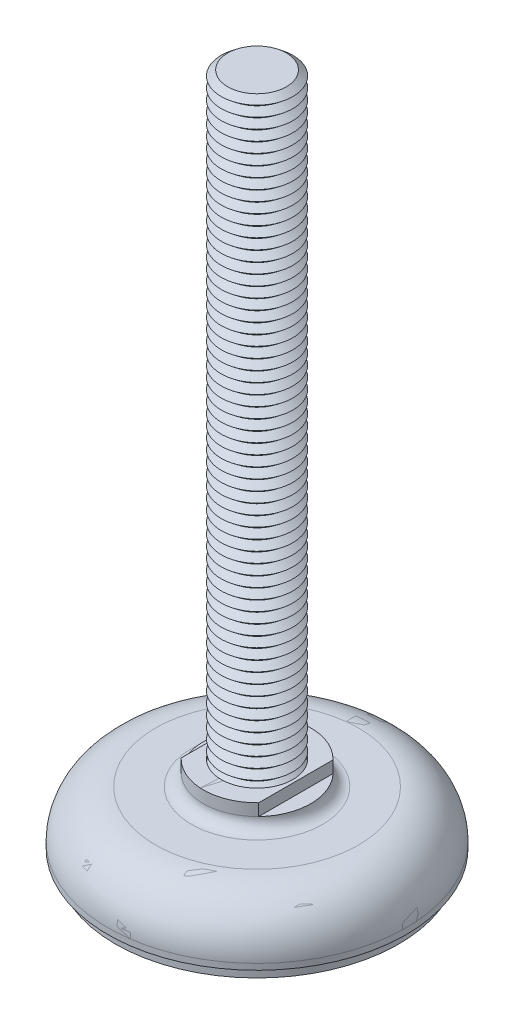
ISO-10303-21;
HEADER;
FILE_DESCRIPTION(('STEP AP214'),'2;1');
FILE_NAME('part.step','',(''),(''),'','','');
FILE_SCHEMA(('AUTOMOTIVE_DESIGN { 1 0 10303 214 1 1 1 1 }'));
ENDSEC;
DATA;
#1=APPLICATION_CONTEXT('core data for automotive mechanical design processes');
#2=APPLICATION_PROTOCOL_DEFINITION('international standard','automotive_design',2000,#1);
#3=PRODUCT_CONTEXT('',#1,'mechanical');
#4=PRODUCT('Part','Part','',(#3));
#5=PRODUCT_RELATED_PRODUCT_CATEGORY('part','',(#4));
#6=PRODUCT_DEFINITION_FORMATION('','',#4);
#7=PRODUCT_DEFINITION_CONTEXT('part definition',#1,'design');
#8=PRODUCT_DEFINITION('design','',#6,#7);
#9=PRODUCT_DEFINITION_SHAPE('','',#8);
#10=(LENGTH_UNIT() NAMED_UNIT(*) SI_UNIT(.MILLI.,.METRE.));
#11=(NAMED_UNIT(*) PLANE_ANGLE_UNIT() SI_UNIT($,.RADIAN.));
#12=(NAMED_UNIT(*) SI_UNIT($,.STERADIAN.) SOLID_ANGLE_UNIT());
#13=UNCERTAINTY_MEASURE_WITH_UNIT(LENGTH_MEASURE(1.E-05),#10,'distance_accuracy_value','');
#14=(GEOMETRIC_REPRESENTATION_CONTEXT(3) GLOBAL_UNCERTAINTY_ASSIGNED_CONTEXT((#13)) GLOBAL_UNIT_ASSIGNED_CONTEXT((#10,
#11,#12)) REPRESENTATION_CONTEXT('',''));
#15=CARTESIAN_POINT('',(0.,0.,0.));
#16=DIRECTION('',(0.,0.,1.));
#17=DIRECTION('',(1.,0.,0.));
#18=AXIS2_PLACEMENT_3D('',#15,#16,#17);
#19=CARTESIAN_POINT('',(0.,110.25,0.));
#20=DIRECTION('',(0.,-1.,0.));
#21=DIRECTION('',(0.998136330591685,0.,-0.0610234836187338));
#22=AXIS2_PLACEMENT_3D('',#19,#20,#21);
#23=CONICAL_SURFACE('',#22,4.90712535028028,0.895664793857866);
#24=CARTESIAN_POINT('',(0.,109.375,0.));
#25=DIRECTION('',(0.,-1.,0.));
#26=DIRECTION('',(0.998136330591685,0.,-0.0610234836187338));
#27=AXIS2_PLACEMENT_3D('',#24,#25,#26);
#28=CIRCLE('',#27,6.);
#29=CARTESIAN_POINT('',(5.98881798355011,109.375,-0.366140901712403));
#30=VERTEX_POINT('',#29);
#31=EDGE_CURVE('P0_E37',#30,#30,#28,.T.);
#32=ORIENTED_EDGE('',*,*,#31,.F.);
#33=EDGE_LOOP('',(#32));
#34=FACE_BOUND('',#33,.T.);
#35=CARTESIAN_POINT('',(0.,110.25,0.));
#36=DIRECTION('',(0.,-1.,0.));
#37=DIRECTION('',(0.998136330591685,0.,-0.0610234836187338));
#38=AXIS2_PLACEMENT_3D('',#35,#36,#37);
#39=CIRCLE('',#38,4.90712535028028);
#40=CARTESIAN_POINT('',(4.8979800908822,110.25,-0.299449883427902));
#41=VERTEX_POINT('',#40);
#42=EDGE_CURVE('P0_E25',#41,#41,#39,.T.);
#43=ORIENTED_EDGE('',*,*,#42,.T.);
#44=EDGE_LOOP('',(#43));
#45=FACE_BOUND('',#44,.T.);
#46=ADVANCED_FACE('P0_F14',(#34,#45),#23,.T.);
#47=CARTESIAN_POINT('',(0.,111.125,0.));
#48=DIRECTION('',(0.,1.,0.));
#49=DIRECTION('',(-0.998136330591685,0.,0.0610234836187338));
#50=AXIS2_PLACEMENT_3D('',#47,#48,#49);
#51=CONICAL_SURFACE('',#50,6.,0.895664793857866);
#52=ORIENTED_EDGE('',*,*,#42,.F.);
#53=EDGE_LOOP('',(#52));
#54=FACE_BOUND('',#53,.T.);
#55=CARTESIAN_POINT('',(0.,111.125,0.));
#56=DIRECTION('',(0.,-1.,0.));
#57=DIRECTION('',(0.998136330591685,0.,-0.0610234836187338));
#58=AXIS2_PLACEMENT_3D('',#55,#56,#57);
#59=CIRCLE('',#58,6.);
#60=CARTESIAN_POINT('',(5.98881798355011,111.125,-0.366140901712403));
#61=VERTEX_POINT('',#60);
#62=EDGE_CURVE('P0_E29',#61,#61,#59,.T.);
#63=ORIENTED_EDGE('',*,*,#62,.T.);
#64=EDGE_LOOP('',(#63));
#65=FACE_BOUND('',#64,.T.);
#66=ADVANCED_FACE('P0_F1105',(#54,#65),#51,.T.);
#67=CARTESIAN_POINT('',(0.,112.,0.));
#68=DIRECTION('',(0.,1.,0.));
#69=DIRECTION('',(-0.998136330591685,0.,0.0610234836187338));
#70=AXIS2_PLACEMENT_3D('',#67,#68,#69);
#71=PLANE('',#70);
#72=CARTESIAN_POINT('',(0.,112.,0.));
#73=DIRECTION('',(0.,-1.,0.));
#74=DIRECTION('',(0.998136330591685,0.,-0.0610234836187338));
#75=AXIS2_PLACEMENT_3D('',#72,#73,#74);
#76=CIRCLE('',#75,4.90712535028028);
#77=CARTESIAN_POINT('',(4.8979800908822,112.,-0.299449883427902));
#78=VERTEX_POINT('',#77);
#79=EDGE_CURVE('P0_E21',#78,#78,#76,.T.);
#80=ORIENTED_EDGE('',*,*,#79,.F.);
#81=EDGE_LOOP('',(#80));
#82=FACE_BOUND('',#81,.T.);
#83=ADVANCED_FACE('P0_F1111',(#82),#71,.T.);
#84=CARTESIAN_POINT('',(0.,112.,0.));
#85=DIRECTION('',(0.,-1.,0.));
#86=DIRECTION('',(0.998136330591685,0.,-0.0610234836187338));
#87=AXIS2_PLACEMENT_3D('',#84,#85,#86);
#88=CONICAL_SURFACE('',#87,4.90712535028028,0.895664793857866);
#89=ORIENTED_EDGE('',*,*,#62,.F.);
#90=EDGE_LOOP('',(#89));
#91=FACE_BOUND('',#90,.T.);
#92=ORIENTED_EDGE('',*,*,#79,.T.);
#93=EDGE_LOOP('',(#92));
#94=FACE_BOUND('',#93,.T.);
#95=ADVANCED_FACE('P0_F1094',(#91,#94),#88,.T.);
#96=CARTESIAN_POINT('',(0.,108.5,0.));
#97=DIRECTION('',(0.,-1.,0.));
#98=DIRECTION('',(0.998136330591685,0.,-0.0610234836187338));
#99=AXIS2_PLACEMENT_3D('',#96,#97,#98);
#100=CONICAL_SURFACE('',#99,4.90712535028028,0.895664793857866);
#101=CARTESIAN_POINT('',(0.,107.625,0.));
#102=DIRECTION('',(0.,-1.,0.));
#103=DIRECTION('',(0.998136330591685,0.,-0.0610234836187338));
#104=AXIS2_PLACEMENT_3D('',#101,#102,#103);
#105=CIRCLE('',#104,6.);
#106=CARTESIAN_POINT('',(5.98881798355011,107.625,-0.366140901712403));
#107=VERTEX_POINT('',#106);
#108=EDGE_CURVE('P0_E43',#107,#107,#105,.T.);
#109=ORIENTED_EDGE('',*,*,#108,.F.);
#110=EDGE_LOOP('',(#109));
#111=FACE_BOUND('',#110,.T.);
#112=CARTESIAN_POINT('',(0.,108.5,0.));
#113=DIRECTION('',(0.,-1.,0.));
#114=DIRECTION('',(0.998136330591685,0.,-0.0610234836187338));
#115=AXIS2_PLACEMENT_3D('',#112,#113,#114);
#116=CIRCLE('',#115,4.90712535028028);
#117=CARTESIAN_POINT('',(4.8979800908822,108.5,-0.299449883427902));
#118=VERTEX_POINT('',#117);
#119=EDGE_CURVE('P0_E34',#118,#118,#116,.T.);
#120=ORIENTED_EDGE('',*,*,#119,.T.);
#121=EDGE_LOOP('',(#120));
#122=FACE_BOUND('',#121,.T.);
#123=ADVANCED_FACE('P0_F1091',(#111,#122),#100,.T.);
#124=CARTESIAN_POINT('',(0.,109.375,0.));
#125=DIRECTION('',(0.,1.,0.));
#126=DIRECTION('',(-0.998136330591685,0.,0.0610234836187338));
#127=AXIS2_PLACEMENT_3D('',#124,#125,#126);
#128=CONICAL_SURFACE('',#127,6.,0.895664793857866);
#129=ORIENTED_EDGE('',*,*,#119,.F.);
#130=EDGE_LOOP('',(#129));
#131=FACE_BOUND('',#130,.T.);
#132=ORIENTED_EDGE('',*,*,#31,.T.);
#133=EDGE_LOOP('',(#132));
#134=FACE_BOUND('',#133,.T.);
#135=ADVANCED_FACE('P0_F1082',(#131,#134),#128,.T.);
#136=CARTESIAN_POINT('',(0.,106.75,0.));
#137=DIRECTION('',(0.,-1.,0.));
#138=DIRECTION('',(0.998136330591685,0.,-0.0610234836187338));
#139=AXIS2_PLACEMENT_3D('',#136,#137,#138);
#140=CONICAL_SURFACE('',#139,4.90712535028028,0.895664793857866);
#141=CARTESIAN_POINT('',(0.,105.875,0.));
#142=DIRECTION('',(0.,-1.,0.));
#143=DIRECTION('',(0.998136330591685,0.,-0.0610234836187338));
#144=AXIS2_PLACEMENT_3D('',#141,#142,#143);
#145=CIRCLE('',#144,6.);
#146=CARTESIAN_POINT('',(5.98881798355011,105.875,-0.366140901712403));
#147=VERTEX_POINT('',#146);
#148=EDGE_CURVE('P0_E49',#147,#147,#145,.T.);
#149=ORIENTED_EDGE('',*,*,#148,.F.);
#150=EDGE_LOOP('',(#149));
#151=FACE_BOUND('',#150,.T.);
#152=CARTESIAN_POINT('',(0.,106.75,0.));
#153=DIRECTION('',(0.,-1.,0.));
#154=DIRECTION('',(0.998136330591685,0.,-0.0610234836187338));
#155=AXIS2_PLACEMENT_3D('',#152,#153,#154);
#156=CIRCLE('',#155,4.90712535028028);
#157=CARTESIAN_POINT('',(4.8979800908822,106.75,-0.299449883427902));
#158=VERTEX_POINT('',#157);
#159=EDGE_CURVE('P0_E40',#158,#158,#156,.T.);
#160=ORIENTED_EDGE('',*,*,#159,.T.);
#161=EDGE_LOOP('',(#160));
#162=FACE_BOUND('',#161,.T.);
#163=ADVANCED_FACE('P0_F1079',(#151,#162),#140,.T.);
#164=CARTESIAN_POINT('',(0.,107.625,0.));
#165=DIRECTION('',(0.,1.,0.));
#166=DIRECTION('',(-0.998136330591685,0.,0.0610234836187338));
#167=AXIS2_PLACEMENT_3D('',#164,#165,#166);
#168=CONICAL_SURFACE('',#167,6.,0.895664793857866);
#169=ORIENTED_EDGE('',*,*,#159,.F.);
#170=EDGE_LOOP('',(#169));
#171=FACE_BOUND('',#170,.T.);
#172=ORIENTED_EDGE('',*,*,#108,.T.);
#173=EDGE_LOOP('',(#172));
#174=FACE_BOUND('',#173,.T.);
#175=ADVANCED_FACE('P0_F1070',(#171,#174),#168,.T.);
#176=CARTESIAN_POINT('',(0.,105.,0.));
#177=DIRECTION('',(0.,-1.,0.));
#178=DIRECTION('',(0.998136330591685,0.,-0.0610234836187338));
#179=AXIS2_PLACEMENT_3D('',#176,#177,#178);
#180=CONICAL_SURFACE('',#179,4.90712535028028,0.895664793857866);
#181=CARTESIAN_POINT('',(0.,104.125,0.));
#182=DIRECTION('',(0.,-1.,0.));
#183=DIRECTION('',(0.998136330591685,0.,-0.0610234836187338));
#184=AXIS2_PLACEMENT_3D('',#181,#182,#183);
#185=CIRCLE('',#184,6.);
#186=CARTESIAN_POINT('',(5.98881798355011,104.125,-0.366140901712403));
#187=VERTEX_POINT('',#186);
#188=EDGE_CURVE('P0_E55',#187,#187,#185,.T.);
#189=ORIENTED_EDGE('',*,*,#188,.F.);
#190=EDGE_LOOP('',(#189));
#191=FACE_BOUND('',#190,.T.);
#192=CARTESIAN_POINT('',(0.,105.,0.));
#193=DIRECTION('',(0.,-1.,0.));
#194=DIRECTION('',(0.998136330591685,0.,-0.0610234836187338));
#195=AXIS2_PLACEMENT_3D('',#192,#193,#194);
#196=CIRCLE('',#195,4.90712535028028);
#197=CARTESIAN_POINT('',(4.8979800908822,105.,-0.299449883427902));
#198=VERTEX_POINT('',#197);
#199=EDGE_CURVE('P0_E46',#198,#198,#196,.T.);
#200=ORIENTED_EDGE('',*,*,#199,.T.);
#201=EDGE_LOOP('',(#200));
#202=FACE_BOUND('',#201,.T.);
#203=ADVANCED_FACE('P0_F1067',(#191,#202),#180,.T.);
#204=CARTESIAN_POINT('',(0.,105.875,0.));
#205=DIRECTION('',(0.,1.,0.));
#206=DIRECTION('',(-0.998136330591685,0.,0.0610234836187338));
#207=AXIS2_PLACEMENT_3D('',#204,#205,#206);
#208=CONICAL_SURFACE('',#207,6.,0.895664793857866);
#209=ORIENTED_EDGE('',*,*,#199,.F.);
#210=EDGE_LOOP('',(#209));
#211=FACE_BOUND('',#210,.T.);
#212=ORIENTED_EDGE('',*,*,#148,.T.);
#213=EDGE_LOOP('',(#212));
#214=FACE_BOUND('',#213,.T.);
#215=ADVANCED_FACE('P0_F1058',(#211,#214),#208,.T.);
#216=CARTESIAN_POINT('',(0.,103.25,0.));
#217=DIRECTION('',(0.,-1.,0.));
#218=DIRECTION('',(0.998136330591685,0.,-0.0610234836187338));
#219=AXIS2_PLACEMENT_3D('',#216,#217,#218);
#220=CONICAL_SURFACE('',#219,4.90712535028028,0.895664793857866);
#221=CARTESIAN_POINT('',(0.,102.375,0.));
#222=DIRECTION('',(0.,-1.,0.));
#223=DIRECTION('',(0.998136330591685,0.,-0.0610234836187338));
#224=AXIS2_PLACEMENT_3D('',#221,#222,#223);
#225=CIRCLE('',#224,6.);
#226=CARTESIAN_POINT('',(5.98881798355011,102.375,-0.366140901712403));
#227=VERTEX_POINT('',#226);
#228=EDGE_CURVE('P0_E61',#227,#227,#225,.T.);
#229=ORIENTED_EDGE('',*,*,#228,.F.);
#230=EDGE_LOOP('',(#229));
#231=FACE_BOUND('',#230,.T.);
#232=CARTESIAN_POINT('',(0.,103.25,0.));
#233=DIRECTION('',(0.,-1.,0.));
#234=DIRECTION('',(0.998136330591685,0.,-0.0610234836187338));
#235=AXIS2_PLACEMENT_3D('',#232,#233,#234);
#236=CIRCLE('',#235,4.90712535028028);
#237=CARTESIAN_POINT('',(4.8979800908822,103.25,-0.299449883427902));
#238=VERTEX_POINT('',#237);
#239=EDGE_CURVE('P0_E52',#238,#238,#236,.T.);
#240=ORIENTED_EDGE('',*,*,#239,.T.);
#241=EDGE_LOOP('',(#240));
#242=FACE_BOUND('',#241,.T.);
#243=ADVANCED_FACE('P0_F1055',(#231,#242),#220,.T.);
#244=CARTESIAN_POINT('',(0.,104.125,0.));
#245=DIRECTION('',(0.,1.,0.));
#246=DIRECTION('',(-0.998136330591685,0.,0.0610234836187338));
#247=AXIS2_PLACEMENT_3D('',#244,#245,#246);
#248=CONICAL_SURFACE('',#247,6.,0.895664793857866);
#249=ORIENTED_EDGE('',*,*,#239,.F.);
#250=EDGE_LOOP('',(#249));
#251=FACE_BOUND('',#250,.T.);
#252=ORIENTED_EDGE('',*,*,#188,.T.);
#253=EDGE_LOOP('',(#252));
#254=FACE_BOUND('',#253,.T.);
#255=ADVANCED_FACE('P0_F1046',(#251,#254),#248,.T.);
#256=CARTESIAN_POINT('',(0.,101.5,0.));
#257=DIRECTION('',(0.,-1.,0.));
#258=DIRECTION('',(0.998136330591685,0.,-0.0610234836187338));
#259=AXIS2_PLACEMENT_3D('',#256,#257,#258);
#260=CONICAL_SURFACE('',#259,4.90712535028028,0.895664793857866);
#261=CARTESIAN_POINT('',(0.,100.625,0.));
#262=DIRECTION('',(0.,-1.,0.));
#263=DIRECTION('',(0.998136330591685,0.,-0.0610234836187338));
#264=AXIS2_PLACEMENT_3D('',#261,#262,#263);
#265=CIRCLE('',#264,6.);
#266=CARTESIAN_POINT('',(5.98881798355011,100.625,-0.366140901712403));
#267=VERTEX_POINT('',#266);
#268=EDGE_CURVE('P0_E67',#267,#267,#265,.T.);
#269=ORIENTED_EDGE('',*,*,#268,.F.);
#270=EDGE_LOOP('',(#269));
#271=FACE_BOUND('',#270,.T.);
#272=CARTESIAN_POINT('',(0.,101.5,0.));
#273=DIRECTION('',(0.,-1.,0.));
#274=DIRECTION('',(0.998136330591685,0.,-0.0610234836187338));
#275=AXIS2_PLACEMENT_3D('',#272,#273,#274);
#276=CIRCLE('',#275,4.90712535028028);
#277=CARTESIAN_POINT('',(4.8979800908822,101.5,-0.299449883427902));
#278=VERTEX_POINT('',#277);
#279=EDGE_CURVE('P0_E58',#278,#278,#276,.T.);
#280=ORIENTED_EDGE('',*,*,#279,.T.);
#281=EDGE_LOOP('',(#280));
#282=FACE_BOUND('',#281,.T.);
#283=ADVANCED_FACE('P0_F1043',(#271,#282),#260,.T.);
#284=CARTESIAN_POINT('',(0.,102.375,0.));
#285=DIRECTION('',(0.,1.,0.));
#286=DIRECTION('',(-0.998136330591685,0.,0.0610234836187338));
#287=AXIS2_PLACEMENT_3D('',#284,#285,#286);
#288=CONICAL_SURFACE('',#287,6.,0.895664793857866);
#289=ORIENTED_EDGE('',*,*,#279,.F.);
#290=EDGE_LOOP('',(#289));
#291=FACE_BOUND('',#290,.T.);
#292=ORIENTED_EDGE('',*,*,#228,.T.);
#293=EDGE_LOOP('',(#292));
#294=FACE_BOUND('',#293,.T.);
#295=ADVANCED_FACE('P0_F1034',(#291,#294),#288,.T.);
#296=CARTESIAN_POINT('',(0.,99.75,0.));
#297=DIRECTION('',(0.,-1.,0.));
#298=DIRECTION('',(0.998136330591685,0.,-0.0610234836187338));
#299=AXIS2_PLACEMENT_3D('',#296,#297,#298);
#300=CONICAL_SURFACE('',#299,4.90712535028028,0.895664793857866);
#301=CARTESIAN_POINT('',(0.,98.875,0.));
#302=DIRECTION('',(0.,-1.,0.));
#303=DIRECTION('',(0.998136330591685,0.,-0.0610234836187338));
#304=AXIS2_PLACEMENT_3D('',#301,#302,#303);
#305=CIRCLE('',#304,6.);
#306=CARTESIAN_POINT('',(5.98881798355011,98.875,-0.366140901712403));
#307=VERTEX_POINT('',#306);
#308=EDGE_CURVE('P0_E73',#307,#307,#305,.T.);
#309=ORIENTED_EDGE('',*,*,#308,.F.);
#310=EDGE_LOOP('',(#309));
#311=FACE_BOUND('',#310,.T.);
#312=CARTESIAN_POINT('',(0.,99.75,0.));
#313=DIRECTION('',(0.,-1.,0.));
#314=DIRECTION('',(0.998136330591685,0.,-0.0610234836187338));
#315=AXIS2_PLACEMENT_3D('',#312,#313,#314);
#316=CIRCLE('',#315,4.90712535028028);
#317=CARTESIAN_POINT('',(4.8979800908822,99.75,-0.299449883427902));
#318=VERTEX_POINT('',#317);
#319=EDGE_CURVE('P0_E64',#318,#318,#316,.T.);
#320=ORIENTED_EDGE('',*,*,#319,.T.);
#321=EDGE_LOOP('',(#320));
#322=FACE_BOUND('',#321,.T.);
#323=ADVANCED_FACE('P0_F1031',(#311,#322),#300,.T.);
#324=CARTESIAN_POINT('',(0.,100.625,0.));
#325=DIRECTION('',(0.,1.,0.));
#326=DIRECTION('',(-0.998136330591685,0.,0.0610234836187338));
#327=AXIS2_PLACEMENT_3D('',#324,#325,#326);
#328=CONICAL_SURFACE('',#327,6.,0.895664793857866);
#329=ORIENTED_EDGE('',*,*,#319,.F.);
#330=EDGE_LOOP('',(#329));
#331=FACE_BOUND('',#330,.T.);
#332=ORIENTED_EDGE('',*,*,#268,.T.);
#333=EDGE_LOOP('',(#332));
#334=FACE_BOUND('',#333,.T.);
#335=ADVANCED_FACE('P0_F1022',(#331,#334),#328,.T.);
#336=CARTESIAN_POINT('',(0.,98.,0.));
#337=DIRECTION('',(0.,-1.,0.));
#338=DIRECTION('',(0.998136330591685,0.,-0.0610234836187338));
#339=AXIS2_PLACEMENT_3D('',#336,#337,#338);
#340=CONICAL_SURFACE('',#339,4.90712535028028,0.895664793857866);
#341=CARTESIAN_POINT('',(0.,97.125,0.));
#342=DIRECTION('',(0.,-1.,0.));
#343=DIRECTION('',(0.998136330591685,0.,-0.0610234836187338));
#344=AXIS2_PLACEMENT_3D('',#341,#342,#343);
#345=CIRCLE('',#344,6.);
#346=CARTESIAN_POINT('',(5.98881798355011,97.125,-0.366140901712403));
#347=VERTEX_POINT('',#346);
#348=EDGE_CURVE('P0_E79',#347,#347,#345,.T.);
#349=ORIENTED_EDGE('',*,*,#348,.F.);
#350=EDGE_LOOP('',(#349));
#351=FACE_BOUND('',#350,.T.);
#352=CARTESIAN_POINT('',(0.,98.,0.));
#353=DIRECTION('',(0.,-1.,0.));
#354=DIRECTION('',(0.998136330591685,0.,-0.0610234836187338));
#355=AXIS2_PLACEMENT_3D('',#352,#353,#354);
#356=CIRCLE('',#355,4.90712535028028);
#357=CARTESIAN_POINT('',(4.8979800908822,98.,-0.299449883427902));
#358=VERTEX_POINT('',#357);
#359=EDGE_CURVE('P0_E70',#358,#358,#356,.T.);
#360=ORIENTED_EDGE('',*,*,#359,.T.);
#361=EDGE_LOOP('',(#360));
#362=FACE_BOUND('',#361,.T.);
#363=ADVANCED_FACE('P0_F1019',(#351,#362),#340,.T.);
#364=CARTESIAN_POINT('',(0.,98.875,0.));
#365=DIRECTION('',(0.,1.,0.));
#366=DIRECTION('',(-0.998136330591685,0.,0.0610234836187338));
#367=AXIS2_PLACEMENT_3D('',#364,#365,#366);
#368=CONICAL_SURFACE('',#367,6.,0.895664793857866);
#369=ORIENTED_EDGE('',*,*,#359,.F.);
#370=EDGE_LOOP('',(#369));
#371=FACE_BOUND('',#370,.T.);
#372=ORIENTED_EDGE('',*,*,#308,.T.);
#373=EDGE_LOOP('',(#372));
#374=FACE_BOUND('',#373,.T.);
#375=ADVANCED_FACE('P0_F1010',(#371,#374),#368,.T.);
#376=CARTESIAN_POINT('',(0.,96.25,0.));
#377=DIRECTION('',(0.,-1.,0.));
#378=DIRECTION('',(0.998136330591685,0.,-0.0610234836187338));
#379=AXIS2_PLACEMENT_3D('',#376,#377,#378);
#380=CONICAL_SURFACE('',#379,4.90712535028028,0.895664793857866);
#381=CARTESIAN_POINT('',(0.,95.375,0.));
#382=DIRECTION('',(0.,-1.,0.));
#383=DIRECTION('',(0.998136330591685,0.,-0.0610234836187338));
#384=AXIS2_PLACEMENT_3D('',#381,#382,#383);
#385=CIRCLE('',#384,6.);
#386=CARTESIAN_POINT('',(5.98881798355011,95.375,-0.366140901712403));
#387=VERTEX_POINT('',#386);
#388=EDGE_CURVE('P0_E85',#387,#387,#385,.T.);
#389=ORIENTED_EDGE('',*,*,#388,.F.);
#390=EDGE_LOOP('',(#389));
#391=FACE_BOUND('',#390,.T.);
#392=CARTESIAN_POINT('',(0.,96.25,0.));
#393=DIRECTION('',(0.,-1.,0.));
#394=DIRECTION('',(0.998136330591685,0.,-0.0610234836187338));
#395=AXIS2_PLACEMENT_3D('',#392,#393,#394);
#396=CIRCLE('',#395,4.90712535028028);
#397=CARTESIAN_POINT('',(4.8979800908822,96.25,-0.299449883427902));
#398=VERTEX_POINT('',#397);
#399=EDGE_CURVE('P0_E76',#398,#398,#396,.T.);
#400=ORIENTED_EDGE('',*,*,#399,.T.);
#401=EDGE_LOOP('',(#400));
#402=FACE_BOUND('',#401,.T.);
#403=ADVANCED_FACE('P0_F1007',(#391,#402),#380,.T.);
#404=CARTESIAN_POINT('',(0.,97.125,0.));
#405=DIRECTION('',(0.,1.,0.));
#406=DIRECTION('',(-0.998136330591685,0.,0.0610234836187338));
#407=AXIS2_PLACEMENT_3D('',#404,#405,#406);
#408=CONICAL_SURFACE('',#407,6.,0.895664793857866);
#409=ORIENTED_EDGE('',*,*,#399,.F.);
#410=EDGE_LOOP('',(#409));
#411=FACE_BOUND('',#410,.T.);
#412=ORIENTED_EDGE('',*,*,#348,.T.);
#413=EDGE_LOOP('',(#412));
#414=FACE_BOUND('',#413,.T.);
#415=ADVANCED_FACE('P0_F998',(#411,#414),#408,.T.);
#416=CARTESIAN_POINT('',(0.,94.5,0.));
#417=DIRECTION('',(0.,-1.,0.));
#418=DIRECTION('',(0.998136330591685,0.,-0.0610234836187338));
#419=AXIS2_PLACEMENT_3D('',#416,#417,#418);
#420=CONICAL_SURFACE('',#419,4.90712535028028,0.895664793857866);
#421=CARTESIAN_POINT('',(0.,93.625,0.));
#422=DIRECTION('',(0.,-1.,0.));
#423=DIRECTION('',(0.998136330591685,0.,-0.0610234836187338));
#424=AXIS2_PLACEMENT_3D('',#421,#422,#423);
#425=CIRCLE('',#424,6.);
#426=CARTESIAN_POINT('',(5.98881798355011,93.625,-0.366140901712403));
#427=VERTEX_POINT('',#426);
#428=EDGE_CURVE('P0_E91',#427,#427,#425,.T.);
#429=ORIENTED_EDGE('',*,*,#428,.F.);
#430=EDGE_LOOP('',(#429));
#431=FACE_BOUND('',#430,.T.);
#432=CARTESIAN_POINT('',(0.,94.5,0.));
#433=DIRECTION('',(0.,-1.,0.));
#434=DIRECTION('',(0.998136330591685,0.,-0.0610234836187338));
#435=AXIS2_PLACEMENT_3D('',#432,#433,#434);
#436=CIRCLE('',#435,4.90712535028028);
#437=CARTESIAN_POINT('',(4.8979800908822,94.5,-0.299449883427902));
#438=VERTEX_POINT('',#437);
#439=EDGE_CURVE('P0_E82',#438,#438,#436,.T.);
#440=ORIENTED_EDGE('',*,*,#439,.T.);
#441=EDGE_LOOP('',(#440));
#442=FACE_BOUND('',#441,.T.);
#443=ADVANCED_FACE('P0_F995',(#431,#442),#420,.T.);
#444=CARTESIAN_POINT('',(0.,95.375,0.));
#445=DIRECTION('',(0.,1.,0.));
#446=DIRECTION('',(-0.998136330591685,0.,0.0610234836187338));
#447=AXIS2_PLACEMENT_3D('',#444,#445,#446);
#448=CONICAL_SURFACE('',#447,6.,0.895664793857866);
#449=ORIENTED_EDGE('',*,*,#439,.F.);
#450=EDGE_LOOP('',(#449));
#451=FACE_BOUND('',#450,.T.);
#452=ORIENTED_EDGE('',*,*,#388,.T.);
#453=EDGE_LOOP('',(#452));
#454=FACE_BOUND('',#453,.T.);
#455=ADVANCED_FACE('P0_F986',(#451,#454),#448,.T.);
#456=CARTESIAN_POINT('',(0.,92.75,0.));
#457=DIRECTION('',(0.,-1.,0.));
#458=DIRECTION('',(0.998136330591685,0.,-0.0610234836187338));
#459=AXIS2_PLACEMENT_3D('',#456,#457,#458);
#460=CONICAL_SURFACE('',#459,4.90712535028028,0.895664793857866);
#461=CARTESIAN_POINT('',(0.,91.875,0.));
#462=DIRECTION('',(0.,-1.,0.));
#463=DIRECTION('',(0.998136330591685,0.,-0.0610234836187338));
#464=AXIS2_PLACEMENT_3D('',#461,#462,#463);
#465=CIRCLE('',#464,6.);
#466=CARTESIAN_POINT('',(5.98881798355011,91.875,-0.366140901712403));
#467=VERTEX_POINT('',#466);
#468=EDGE_CURVE('P0_E97',#467,#467,#465,.T.);
#469=ORIENTED_EDGE('',*,*,#468,.F.);
#470=EDGE_LOOP('',(#469));
#471=FACE_BOUND('',#470,.T.);
#472=CARTESIAN_POINT('',(0.,92.75,0.));
#473=DIRECTION('',(0.,-1.,0.));
#474=DIRECTION('',(0.998136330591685,0.,-0.0610234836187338));
#475=AXIS2_PLACEMENT_3D('',#472,#473,#474);
#476=CIRCLE('',#475,4.90712535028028);
#477=CARTESIAN_POINT('',(4.8979800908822,92.75,-0.299449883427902));
#478=VERTEX_POINT('',#477);
#479=EDGE_CURVE('P0_E88',#478,#478,#476,.T.);
#480=ORIENTED_EDGE('',*,*,#479,.T.);
#481=EDGE_LOOP('',(#480));
#482=FACE_BOUND('',#481,.T.);
#483=ADVANCED_FACE('P0_F983',(#471,#482),#460,.T.);
#484=CARTESIAN_POINT('',(0.,93.625,0.));
#485=DIRECTION('',(0.,1.,0.));
#486=DIRECTION('',(-0.998136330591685,0.,0.0610234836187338));
#487=AXIS2_PLACEMENT_3D('',#484,#485,#486);
#488=CONICAL_SURFACE('',#487,6.,0.895664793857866);
#489=ORIENTED_EDGE('',*,*,#479,.F.);
#490=EDGE_LOOP('',(#489));
#491=FACE_BOUND('',#490,.T.);
#492=ORIENTED_EDGE('',*,*,#428,.T.);
#493=EDGE_LOOP('',(#492));
#494=FACE_BOUND('',#493,.T.);
#495=ADVANCED_FACE('P0_F974',(#491,#494),#488,.T.);
#496=CARTESIAN_POINT('',(0.,91.,0.));
#497=DIRECTION('',(0.,-1.,0.));
#498=DIRECTION('',(0.998136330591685,0.,-0.0610234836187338));
#499=AXIS2_PLACEMENT_3D('',#496,#497,#498);
#500=CONICAL_SURFACE('',#499,4.90712535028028,0.895664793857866);
#501=CARTESIAN_POINT('',(0.,90.125,0.));
#502=DIRECTION('',(0.,-1.,0.));
#503=DIRECTION('',(0.998136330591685,0.,-0.0610234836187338));
#504=AXIS2_PLACEMENT_3D('',#501,#502,#503);
#505=CIRCLE('',#504,6.);
#506=CARTESIAN_POINT('',(5.98881798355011,90.125,-0.366140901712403));
#507=VERTEX_POINT('',#506);
#508=EDGE_CURVE('P0_E103',#507,#507,#505,.T.);
#509=ORIENTED_EDGE('',*,*,#508,.F.);
#510=EDGE_LOOP('',(#509));
#511=FACE_BOUND('',#510,.T.);
#512=CARTESIAN_POINT('',(0.,91.,0.));
#513=DIRECTION('',(0.,-1.,0.));
#514=DIRECTION('',(0.998136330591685,0.,-0.0610234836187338));
#515=AXIS2_PLACEMENT_3D('',#512,#513,#514);
#516=CIRCLE('',#515,4.90712535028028);
#517=CARTESIAN_POINT('',(4.8979800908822,91.,-0.299449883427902));
#518=VERTEX_POINT('',#517);
#519=EDGE_CURVE('P0_E94',#518,#518,#516,.T.);
#520=ORIENTED_EDGE('',*,*,#519,.T.);
#521=EDGE_LOOP('',(#520));
#522=FACE_BOUND('',#521,.T.);
#523=ADVANCED_FACE('P0_F971',(#511,#522),#500,.T.);
#524=CARTESIAN_POINT('',(0.,91.875,0.));
#525=DIRECTION('',(0.,1.,0.));
#526=DIRECTION('',(-0.998136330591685,0.,0.0610234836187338));
#527=AXIS2_PLACEMENT_3D('',#524,#525,#526);
#528=CONICAL_SURFACE('',#527,6.,0.895664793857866);
#529=ORIENTED_EDGE('',*,*,#519,.F.);
#530=EDGE_LOOP('',(#529));
#531=FACE_BOUND('',#530,.T.);
#532=ORIENTED_EDGE('',*,*,#468,.T.);
#533=EDGE_LOOP('',(#532));
#534=FACE_BOUND('',#533,.T.);
#535=ADVANCED_FACE('P0_F962',(#531,#534),#528,.T.);
#536=CARTESIAN_POINT('',(0.,89.25,0.));
#537=DIRECTION('',(0.,-1.,0.));
#538=DIRECTION('',(0.998136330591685,0.,-0.0610234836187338));
#539=AXIS2_PLACEMENT_3D('',#536,#537,#538);
#540=CONICAL_SURFACE('',#539,4.90712535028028,0.895664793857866);
#541=CARTESIAN_POINT('',(0.,88.375,0.));
#542=DIRECTION('',(0.,-1.,0.));
#543=DIRECTION('',(0.998136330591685,0.,-0.0610234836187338));
#544=AXIS2_PLACEMENT_3D('',#541,#542,#543);
#545=CIRCLE('',#544,6.);
#546=CARTESIAN_POINT('',(5.98881798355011,88.375,-0.366140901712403));
#547=VERTEX_POINT('',#546);
#548=EDGE_CURVE('P0_E109',#547,#547,#545,.T.);
#549=ORIENTED_EDGE('',*,*,#548,.F.);
#550=EDGE_LOOP('',(#549));
#551=FACE_BOUND('',#550,.T.);
#552=CARTESIAN_POINT('',(0.,89.25,0.));
#553=DIRECTION('',(0.,-1.,0.));
#554=DIRECTION('',(0.998136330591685,0.,-0.0610234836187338));
#555=AXIS2_PLACEMENT_3D('',#552,#553,#554);
#556=CIRCLE('',#555,4.90712535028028);
#557=CARTESIAN_POINT('',(4.8979800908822,89.25,-0.299449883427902));
#558=VERTEX_POINT('',#557);
#559=EDGE_CURVE('P0_E100',#558,#558,#556,.T.);
#560=ORIENTED_EDGE('',*,*,#559,.T.);
#561=EDGE_LOOP('',(#560));
#562=FACE_BOUND('',#561,.T.);
#563=ADVANCED_FACE('P0_F959',(#551,#562),#540,.T.);
#564=CARTESIAN_POINT('',(0.,90.125,0.));
#565=DIRECTION('',(0.,1.,0.));
#566=DIRECTION('',(-0.998136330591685,0.,0.0610234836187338));
#567=AXIS2_PLACEMENT_3D('',#564,#565,#566);
#568=CONICAL_SURFACE('',#567,6.,0.895664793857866);
#569=ORIENTED_EDGE('',*,*,#559,.F.);
#570=EDGE_LOOP('',(#569));
#571=FACE_BOUND('',#570,.T.);
#572=ORIENTED_EDGE('',*,*,#508,.T.);
#573=EDGE_LOOP('',(#572));
#574=FACE_BOUND('',#573,.T.);
#575=ADVANCED_FACE('P0_F950',(#571,#574),#568,.T.);
#576=CARTESIAN_POINT('',(0.,87.5,0.));
#577=DIRECTION('',(0.,-1.,0.));
#578=DIRECTION('',(0.998136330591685,0.,-0.0610234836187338));
#579=AXIS2_PLACEMENT_3D('',#576,#577,#578);
#580=CONICAL_SURFACE('',#579,4.90712535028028,0.895664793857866);
#581=CARTESIAN_POINT('',(0.,86.625,0.));
#582=DIRECTION('',(0.,-1.,0.));
#583=DIRECTION('',(0.998136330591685,0.,-0.0610234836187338));
#584=AXIS2_PLACEMENT_3D('',#581,#582,#583);
#585=CIRCLE('',#584,6.);
#586=CARTESIAN_POINT('',(5.98881798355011,86.625,-0.366140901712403));
#587=VERTEX_POINT('',#586);
#588=EDGE_CURVE('P0_E115',#587,#587,#585,.T.);
#589=ORIENTED_EDGE('',*,*,#588,.F.);
#590=EDGE_LOOP('',(#589));
#591=FACE_BOUND('',#590,.T.);
#592=CARTESIAN_POINT('',(0.,87.5,0.));
#593=DIRECTION('',(0.,-1.,0.));
#594=DIRECTION('',(0.998136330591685,0.,-0.0610234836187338));
#595=AXIS2_PLACEMENT_3D('',#592,#593,#594);
#596=CIRCLE('',#595,4.90712535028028);
#597=CARTESIAN_POINT('',(4.8979800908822,87.5,-0.299449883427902));
#598=VERTEX_POINT('',#597);
#599=EDGE_CURVE('P0_E106',#598,#598,#596,.T.);
#600=ORIENTED_EDGE('',*,*,#599,.T.);
#601=EDGE_LOOP('',(#600));
#602=FACE_BOUND('',#601,.T.);
#603=ADVANCED_FACE('P0_F947',(#591,#602),#580,.T.);
#604=CARTESIAN_POINT('',(0.,88.375,0.));
#605=DIRECTION('',(0.,1.,0.));
#606=DIRECTION('',(-0.998136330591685,0.,0.0610234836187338));
#607=AXIS2_PLACEMENT_3D('',#604,#605,#606);
#608=CONICAL_SURFACE('',#607,6.,0.895664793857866);
#609=ORIENTED_EDGE('',*,*,#599,.F.);
#610=EDGE_LOOP('',(#609));
#611=FACE_BOUND('',#610,.T.);
#612=ORIENTED_EDGE('',*,*,#548,.T.);
#613=EDGE_LOOP('',(#612));
#614=FACE_BOUND('',#613,.T.);
#615=ADVANCED_FACE('P0_F938',(#611,#614),#608,.T.);
#616=CARTESIAN_POINT('',(0.,85.75,0.));
#617=DIRECTION('',(0.,-1.,0.));
#618=DIRECTION('',(0.998136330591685,0.,-0.0610234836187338));
#619=AXIS2_PLACEMENT_3D('',#616,#617,#618);
#620=CONICAL_SURFACE('',#619,4.90712535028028,0.895664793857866);
#621=CARTESIAN_POINT('',(0.,84.875,0.));
#622=DIRECTION('',(0.,-1.,0.));
#623=DIRECTION('',(0.998136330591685,0.,-0.0610234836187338));
#624=AXIS2_PLACEMENT_3D('',#621,#622,#623);
#625=CIRCLE('',#624,6.);
#626=CARTESIAN_POINT('',(5.98881798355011,84.875,-0.366140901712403));
#627=VERTEX_POINT('',#626);
#628=EDGE_CURVE('P0_E121',#627,#627,#625,.T.);
#629=ORIENTED_EDGE('',*,*,#628,.F.);
#630=EDGE_LOOP('',(#629));
#631=FACE_BOUND('',#630,.T.);
#632=CARTESIAN_POINT('',(0.,85.75,0.));
#633=DIRECTION('',(0.,-1.,0.));
#634=DIRECTION('',(0.998136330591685,0.,-0.0610234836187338));
#635=AXIS2_PLACEMENT_3D('',#632,#633,#634);
#636=CIRCLE('',#635,4.90712535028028);
#637=CARTESIAN_POINT('',(4.8979800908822,85.75,-0.299449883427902));
#638=VERTEX_POINT('',#637);
#639=EDGE_CURVE('P0_E112',#638,#638,#636,.T.);
#640=ORIENTED_EDGE('',*,*,#639,.T.);
#641=EDGE_LOOP('',(#640));
#642=FACE_BOUND('',#641,.T.);
#643=ADVANCED_FACE('P0_F935',(#631,#642),#620,.T.);
#644=CARTESIAN_POINT('',(0.,86.625,0.));
#645=DIRECTION('',(0.,1.,0.));
#646=DIRECTION('',(-0.998136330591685,0.,0.0610234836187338));
#647=AXIS2_PLACEMENT_3D('',#644,#645,#646);
#648=CONICAL_SURFACE('',#647,6.,0.895664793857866);
#649=ORIENTED_EDGE('',*,*,#639,.F.);
#650=EDGE_LOOP('',(#649));
#651=FACE_BOUND('',#650,.T.);
#652=ORIENTED_EDGE('',*,*,#588,.T.);
#653=EDGE_LOOP('',(#652));
#654=FACE_BOUND('',#653,.T.);
#655=ADVANCED_FACE('P0_F926',(#651,#654),#648,.T.);
#656=CARTESIAN_POINT('',(0.,84.,0.));
#657=DIRECTION('',(0.,-1.,0.));
#658=DIRECTION('',(0.998136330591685,0.,-0.0610234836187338));
#659=AXIS2_PLACEMENT_3D('',#656,#657,#658);
#660=CONICAL_SURFACE('',#659,4.90712535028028,0.895664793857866);
#661=CARTESIAN_POINT('',(0.,83.125,0.));
#662=DIRECTION('',(0.,-1.,0.));
#663=DIRECTION('',(0.998136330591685,0.,-0.0610234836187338));
#664=AXIS2_PLACEMENT_3D('',#661,#662,#663);
#665=CIRCLE('',#664,6.);
#666=CARTESIAN_POINT('',(5.98881798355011,83.125,-0.366140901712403));
#667=VERTEX_POINT('',#666);
#668=EDGE_CURVE('P0_E127',#667,#667,#665,.T.);
#669=ORIENTED_EDGE('',*,*,#668,.F.);
#670=EDGE_LOOP('',(#669));
#671=FACE_BOUND('',#670,.T.);
#672=CARTESIAN_POINT('',(0.,84.,0.));
#673=DIRECTION('',(0.,-1.,0.));
#674=DIRECTION('',(0.998136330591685,0.,-0.0610234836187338));
#675=AXIS2_PLACEMENT_3D('',#672,#673,#674);
#676=CIRCLE('',#675,4.90712535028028);
#677=CARTESIAN_POINT('',(4.8979800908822,84.,-0.299449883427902));
#678=VERTEX_POINT('',#677);
#679=EDGE_CURVE('P0_E118',#678,#678,#676,.T.);
#680=ORIENTED_EDGE('',*,*,#679,.T.);
#681=EDGE_LOOP('',(#680));
#682=FACE_BOUND('',#681,.T.);
#683=ADVANCED_FACE('P0_F923',(#671,#682),#660,.T.);
#684=CARTESIAN_POINT('',(0.,84.875,0.));
#685=DIRECTION('',(0.,1.,0.));
#686=DIRECTION('',(-0.998136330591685,0.,0.0610234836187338));
#687=AXIS2_PLACEMENT_3D('',#684,#685,#686);
#688=CONICAL_SURFACE('',#687,6.,0.895664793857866);
#689=ORIENTED_EDGE('',*,*,#679,.F.);
#690=EDGE_LOOP('',(#689));
#691=FACE_BOUND('',#690,.T.);
#692=ORIENTED_EDGE('',*,*,#628,.T.);
#693=EDGE_LOOP('',(#692));
#694=FACE_BOUND('',#693,.T.);
#695=ADVANCED_FACE('P0_F914',(#691,#694),#688,.T.);
#696=CARTESIAN_POINT('',(0.,82.25,0.));
#697=DIRECTION('',(0.,-1.,0.));
#698=DIRECTION('',(0.998136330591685,0.,-0.0610234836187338));
#699=AXIS2_PLACEMENT_3D('',#696,#697,#698);
#700=CONICAL_SURFACE('',#699,4.90712535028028,0.895664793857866);
#701=CARTESIAN_POINT('',(0.,81.375,0.));
#702=DIRECTION('',(0.,-1.,0.));
#703=DIRECTION('',(0.998136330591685,0.,-0.0610234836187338));
#704=AXIS2_PLACEMENT_3D('',#701,#702,#703);
#705=CIRCLE('',#704,6.);
#706=CARTESIAN_POINT('',(5.98881798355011,81.375,-0.366140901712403));
#707=VERTEX_POINT('',#706);
#708=EDGE_CURVE('P0_E133',#707,#707,#705,.T.);
#709=ORIENTED_EDGE('',*,*,#708,.F.);
#710=EDGE_LOOP('',(#709));
#711=FACE_BOUND('',#710,.T.);
#712=CARTESIAN_POINT('',(0.,82.25,0.));
#713=DIRECTION('',(0.,-1.,0.));
#714=DIRECTION('',(0.998136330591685,0.,-0.0610234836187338));
#715=AXIS2_PLACEMENT_3D('',#712,#713,#714);
#716=CIRCLE('',#715,4.90712535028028);
#717=CARTESIAN_POINT('',(4.8979800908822,82.25,-0.299449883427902));
#718=VERTEX_POINT('',#717);
#719=EDGE_CURVE('P0_E124',#718,#718,#716,.T.);
#720=ORIENTED_EDGE('',*,*,#719,.T.);
#721=EDGE_LOOP('',(#720));
#722=FACE_BOUND('',#721,.T.);
#723=ADVANCED_FACE('P0_F911',(#711,#722),#700,.T.);
#724=CARTESIAN_POINT('',(0.,83.125,0.));
#725=DIRECTION('',(0.,1.,0.));
#726=DIRECTION('',(-0.998136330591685,0.,0.0610234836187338));
#727=AXIS2_PLACEMENT_3D('',#724,#725,#726);
#728=CONICAL_SURFACE('',#727,6.,0.895664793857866);
#729=ORIENTED_EDGE('',*,*,#719,.F.);
#730=EDGE_LOOP('',(#729));
#731=FACE_BOUND('',#730,.T.);
#732=ORIENTED_EDGE('',*,*,#668,.T.);
#733=EDGE_LOOP('',(#732));
#734=FACE_BOUND('',#733,.T.);
#735=ADVANCED_FACE('P0_F902',(#731,#734),#728,.T.);
#736=CARTESIAN_POINT('',(0.,80.5,0.));
#737=DIRECTION('',(0.,-1.,0.));
#738=DIRECTION('',(0.998136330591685,0.,-0.0610234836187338));
#739=AXIS2_PLACEMENT_3D('',#736,#737,#738);
#740=CONICAL_SURFACE('',#739,4.90712535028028,0.895664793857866);
#741=CARTESIAN_POINT('',(0.,79.625,0.));
#742=DIRECTION('',(0.,-1.,0.));
#743=DIRECTION('',(0.998136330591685,0.,-0.0610234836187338));
#744=AXIS2_PLACEMENT_3D('',#741,#742,#743);
#745=CIRCLE('',#744,6.);
#746=CARTESIAN_POINT('',(5.98881798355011,79.625,-0.366140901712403));
#747=VERTEX_POINT('',#746);
#748=EDGE_CURVE('P0_E139',#747,#747,#745,.T.);
#749=ORIENTED_EDGE('',*,*,#748,.F.);
#750=EDGE_LOOP('',(#749));
#751=FACE_BOUND('',#750,.T.);
#752=CARTESIAN_POINT('',(0.,80.5,0.));
#753=DIRECTION('',(0.,-1.,0.));
#754=DIRECTION('',(0.998136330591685,0.,-0.0610234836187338));
#755=AXIS2_PLACEMENT_3D('',#752,#753,#754);
#756=CIRCLE('',#755,4.90712535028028);
#757=CARTESIAN_POINT('',(4.8979800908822,80.5,-0.299449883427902));
#758=VERTEX_POINT('',#757);
#759=EDGE_CURVE('P0_E130',#758,#758,#756,.T.);
#760=ORIENTED_EDGE('',*,*,#759,.T.);
#761=EDGE_LOOP('',(#760));
#762=FACE_BOUND('',#761,.T.);
#763=ADVANCED_FACE('P0_F899',(#751,#762),#740,.T.);
#764=CARTESIAN_POINT('',(0.,81.375,0.));
#765=DIRECTION('',(0.,1.,0.));
#766=DIRECTION('',(-0.998136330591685,0.,0.0610234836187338));
#767=AXIS2_PLACEMENT_3D('',#764,#765,#766);
#768=CONICAL_SURFACE('',#767,6.,0.895664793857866);
#769=ORIENTED_EDGE('',*,*,#759,.F.);
#770=EDGE_LOOP('',(#769));
#771=FACE_BOUND('',#770,.T.);
#772=ORIENTED_EDGE('',*,*,#708,.T.);
#773=EDGE_LOOP('',(#772));
#774=FACE_BOUND('',#773,.T.);
#775=ADVANCED_FACE('P0_F890',(#771,#774),#768,.T.);
#776=CARTESIAN_POINT('',(0.,78.75,0.));
#777=DIRECTION('',(0.,-1.,0.));
#778=DIRECTION('',(0.998136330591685,0.,-0.0610234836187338));
#779=AXIS2_PLACEMENT_3D('',#776,#777,#778);
#780=CONICAL_SURFACE('',#779,4.90712535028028,0.895664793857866);
#781=CARTESIAN_POINT('',(0.,77.875,0.));
#782=DIRECTION('',(0.,-1.,0.));
#783=DIRECTION('',(0.998136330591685,0.,-0.0610234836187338));
#784=AXIS2_PLACEMENT_3D('',#781,#782,#783);
#785=CIRCLE('',#784,6.);
#786=CARTESIAN_POINT('',(5.98881798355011,77.875,-0.366140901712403));
#787=VERTEX_POINT('',#786);
#788=EDGE_CURVE('P0_E145',#787,#787,#785,.T.);
#789=ORIENTED_EDGE('',*,*,#788,.F.);
#790=EDGE_LOOP('',(#789));
#791=FACE_BOUND('',#790,.T.);
#792=CARTESIAN_POINT('',(0.,78.75,0.));
#793=DIRECTION('',(0.,-1.,0.));
#794=DIRECTION('',(0.998136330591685,0.,-0.0610234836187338));
#795=AXIS2_PLACEMENT_3D('',#792,#793,#794);
#796=CIRCLE('',#795,4.90712535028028);
#797=CARTESIAN_POINT('',(4.8979800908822,78.75,-0.299449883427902));
#798=VERTEX_POINT('',#797);
#799=EDGE_CURVE('P0_E136',#798,#798,#796,.T.);
#800=ORIENTED_EDGE('',*,*,#799,.T.);
#801=EDGE_LOOP('',(#800));
#802=FACE_BOUND('',#801,.T.);
#803=ADVANCED_FACE('P0_F887',(#791,#802),#780,.T.);
#804=CARTESIAN_POINT('',(0.,79.625,0.));
#805=DIRECTION('',(0.,1.,0.));
#806=DIRECTION('',(-0.998136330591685,0.,0.0610234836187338));
#807=AXIS2_PLACEMENT_3D('',#804,#805,#806);
#808=CONICAL_SURFACE('',#807,6.,0.895664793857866);
#809=ORIENTED_EDGE('',*,*,#799,.F.);
#810=EDGE_LOOP('',(#809));
#811=FACE_BOUND('',#810,.T.);
#812=ORIENTED_EDGE('',*,*,#748,.T.);
#813=EDGE_LOOP('',(#812));
#814=FACE_BOUND('',#813,.T.);
#815=ADVANCED_FACE('P0_F878',(#811,#814),#808,.T.);
#816=CARTESIAN_POINT('',(0.,77.,0.));
#817=DIRECTION('',(0.,-1.,0.));
#818=DIRECTION('',(0.998136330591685,0.,-0.0610234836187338));
#819=AXIS2_PLACEMENT_3D('',#816,#817,#818);
#820=CONICAL_SURFACE('',#819,4.90712535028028,0.895664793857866);
#821=CARTESIAN_POINT('',(0.,76.125,0.));
#822=DIRECTION('',(0.,-1.,0.));
#823=DIRECTION('',(0.998136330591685,0.,-0.0610234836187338));
#824=AXIS2_PLACEMENT_3D('',#821,#822,#823);
#825=CIRCLE('',#824,6.);
#826=CARTESIAN_POINT('',(5.98881798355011,76.125,-0.366140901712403));
#827=VERTEX_POINT('',#826);
#828=EDGE_CURVE('P0_E151',#827,#827,#825,.T.);
#829=ORIENTED_EDGE('',*,*,#828,.F.);
#830=EDGE_LOOP('',(#829));
#831=FACE_BOUND('',#830,.T.);
#832=CARTESIAN_POINT('',(0.,77.,0.));
#833=DIRECTION('',(0.,-1.,0.));
#834=DIRECTION('',(0.998136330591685,0.,-0.0610234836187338));
#835=AXIS2_PLACEMENT_3D('',#832,#833,#834);
#836=CIRCLE('',#835,4.90712535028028);
#837=CARTESIAN_POINT('',(4.8979800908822,77.,-0.299449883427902));
#838=VERTEX_POINT('',#837);
#839=EDGE_CURVE('P0_E142',#838,#838,#836,.T.);
#840=ORIENTED_EDGE('',*,*,#839,.T.);
#841=EDGE_LOOP('',(#840));
#842=FACE_BOUND('',#841,.T.);
#843=ADVANCED_FACE('P0_F875',(#831,#842),#820,.T.);
#844=CARTESIAN_POINT('',(0.,77.875,0.));
#845=DIRECTION('',(0.,1.,0.));
#846=DIRECTION('',(-0.998136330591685,0.,0.0610234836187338));
#847=AXIS2_PLACEMENT_3D('',#844,#845,#846);
#848=CONICAL_SURFACE('',#847,6.,0.895664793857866);
#849=ORIENTED_EDGE('',*,*,#839,.F.);
#850=EDGE_LOOP('',(#849));
#851=FACE_BOUND('',#850,.T.);
#852=ORIENTED_EDGE('',*,*,#788,.T.);
#853=EDGE_LOOP('',(#852));
#854=FACE_BOUND('',#853,.T.);
#855=ADVANCED_FACE('P0_F866',(#851,#854),#848,.T.);
#856=CARTESIAN_POINT('',(0.,75.25,0.));
#857=DIRECTION('',(0.,-1.,0.));
#858=DIRECTION('',(0.998136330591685,0.,-0.0610234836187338));
#859=AXIS2_PLACEMENT_3D('',#856,#857,#858);
#860=CONICAL_SURFACE('',#859,4.90712535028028,0.895664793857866);
#861=CARTESIAN_POINT('',(0.,74.375,0.));
#862=DIRECTION('',(0.,-1.,0.));
#863=DIRECTION('',(0.998136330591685,0.,-0.0610234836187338));
#864=AXIS2_PLACEMENT_3D('',#861,#862,#863);
#865=CIRCLE('',#864,6.);
#866=CARTESIAN_POINT('',(5.98881798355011,74.375,-0.366140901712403));
#867=VERTEX_POINT('',#866);
#868=EDGE_CURVE('P0_E157',#867,#867,#865,.T.);
#869=ORIENTED_EDGE('',*,*,#868,.F.);
#870=EDGE_LOOP('',(#869));
#871=FACE_BOUND('',#870,.T.);
#872=CARTESIAN_POINT('',(0.,75.25,0.));
#873=DIRECTION('',(0.,-1.,0.));
#874=DIRECTION('',(0.998136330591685,0.,-0.0610234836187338));
#875=AXIS2_PLACEMENT_3D('',#872,#873,#874);
#876=CIRCLE('',#875,4.90712535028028);
#877=CARTESIAN_POINT('',(4.8979800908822,75.25,-0.299449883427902));
#878=VERTEX_POINT('',#877);
#879=EDGE_CURVE('P0_E148',#878,#878,#876,.T.);
#880=ORIENTED_EDGE('',*,*,#879,.T.);
#881=EDGE_LOOP('',(#880));
#882=FACE_BOUND('',#881,.T.);
#883=ADVANCED_FACE('P0_F863',(#871,#882),#860,.T.);
#884=CARTESIAN_POINT('',(0.,76.125,0.));
#885=DIRECTION('',(0.,1.,0.));
#886=DIRECTION('',(-0.998136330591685,0.,0.0610234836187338));
#887=AXIS2_PLACEMENT_3D('',#884,#885,#886);
#888=CONICAL_SURFACE('',#887,6.,0.895664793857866);
#889=ORIENTED_EDGE('',*,*,#879,.F.);
#890=EDGE_LOOP('',(#889));
#891=FACE_BOUND('',#890,.T.);
#892=ORIENTED_EDGE('',*,*,#828,.T.);
#893=EDGE_LOOP('',(#892));
#894=FACE_BOUND('',#893,.T.);
#895=ADVANCED_FACE('P0_F854',(#891,#894),#888,.T.);
#896=CARTESIAN_POINT('',(0.,73.5,0.));
#897=DIRECTION('',(0.,-1.,0.));
#898=DIRECTION('',(0.998136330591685,0.,-0.0610234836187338));
#899=AXIS2_PLACEMENT_3D('',#896,#897,#898);
#900=CONICAL_SURFACE('',#899,4.90712535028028,0.895664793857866);
#901=CARTESIAN_POINT('',(0.,72.625,0.));
#902=DIRECTION('',(0.,-1.,0.));
#903=DIRECTION('',(0.998136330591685,0.,-0.0610234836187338));
#904=AXIS2_PLACEMENT_3D('',#901,#902,#903);
#905=CIRCLE('',#904,6.);
#906=CARTESIAN_POINT('',(5.98881798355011,72.625,-0.366140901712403));
#907=VERTEX_POINT('',#906);
#908=EDGE_CURVE('P0_E163',#907,#907,#905,.T.);
#909=ORIENTED_EDGE('',*,*,#908,.F.);
#910=EDGE_LOOP('',(#909));
#911=FACE_BOUND('',#910,.T.);
#912=CARTESIAN_POINT('',(0.,73.5,0.));
#913=DIRECTION('',(0.,-1.,0.));
#914=DIRECTION('',(0.998136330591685,0.,-0.0610234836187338));
#915=AXIS2_PLACEMENT_3D('',#912,#913,#914);
#916=CIRCLE('',#915,4.90712535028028);
#917=CARTESIAN_POINT('',(4.8979800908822,73.5,-0.299449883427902));
#918=VERTEX_POINT('',#917);
#919=EDGE_CURVE('P0_E154',#918,#918,#916,.T.);
#920=ORIENTED_EDGE('',*,*,#919,.T.);
#921=EDGE_LOOP('',(#920));
#922=FACE_BOUND('',#921,.T.);
#923=ADVANCED_FACE('P0_F851',(#911,#922),#900,.T.);
#924=CARTESIAN_POINT('',(0.,74.375,0.));
#925=DIRECTION('',(0.,1.,0.));
#926=DIRECTION('',(-0.998136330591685,0.,0.0610234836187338));
#927=AXIS2_PLACEMENT_3D('',#924,#925,#926);
#928=CONICAL_SURFACE('',#927,6.,0.895664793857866);
#929=ORIENTED_EDGE('',*,*,#919,.F.);
#930=EDGE_LOOP('',(#929));
#931=FACE_BOUND('',#930,.T.);
#932=ORIENTED_EDGE('',*,*,#868,.T.);
#933=EDGE_LOOP('',(#932));
#934=FACE_BOUND('',#933,.T.);
#935=ADVANCED_FACE('P0_F842',(#931,#934),#928,.T.);
#936=CARTESIAN_POINT('',(0.,71.75,0.));
#937=DIRECTION('',(0.,-1.,0.));
#938=DIRECTION('',(0.998136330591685,0.,-0.0610234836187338));
#939=AXIS2_PLACEMENT_3D('',#936,#937,#938);
#940=CONICAL_SURFACE('',#939,4.90712535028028,0.895664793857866);
#941=CARTESIAN_POINT('',(0.,70.875,0.));
#942=DIRECTION('',(0.,-1.,0.));
#943=DIRECTION('',(0.998136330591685,0.,-0.0610234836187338));
#944=AXIS2_PLACEMENT_3D('',#941,#942,#943);
#945=CIRCLE('',#944,6.);
#946=CARTESIAN_POINT('',(5.98881798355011,70.875,-0.366140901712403));
#947=VERTEX_POINT('',#946);
#948=EDGE_CURVE('P0_E169',#947,#947,#945,.T.);
#949=ORIENTED_EDGE('',*,*,#948,.F.);
#950=EDGE_LOOP('',(#949));
#951=FACE_BOUND('',#950,.T.);
#952=CARTESIAN_POINT('',(0.,71.75,0.));
#953=DIRECTION('',(0.,-1.,0.));
#954=DIRECTION('',(0.998136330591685,0.,-0.0610234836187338));
#955=AXIS2_PLACEMENT_3D('',#952,#953,#954);
#956=CIRCLE('',#955,4.90712535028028);
#957=CARTESIAN_POINT('',(4.8979800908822,71.75,-0.299449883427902));
#958=VERTEX_POINT('',#957);
#959=EDGE_CURVE('P0_E160',#958,#958,#956,.T.);
#960=ORIENTED_EDGE('',*,*,#959,.T.);
#961=EDGE_LOOP('',(#960));
#962=FACE_BOUND('',#961,.T.);
#963=ADVANCED_FACE('P0_F839',(#951,#962),#940,.T.);
#964=CARTESIAN_POINT('',(0.,72.625,0.));
#965=DIRECTION('',(0.,1.,0.));
#966=DIRECTION('',(-0.998136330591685,0.,0.0610234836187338));
#967=AXIS2_PLACEMENT_3D('',#964,#965,#966);
#968=CONICAL_SURFACE('',#967,6.,0.895664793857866);
#969=ORIENTED_EDGE('',*,*,#959,.F.);
#970=EDGE_LOOP('',(#969));
#971=FACE_BOUND('',#970,.T.);
#972=ORIENTED_EDGE('',*,*,#908,.T.);
#973=EDGE_LOOP('',(#972));
#974=FACE_BOUND('',#973,.T.);
#975=ADVANCED_FACE('P0_F830',(#971,#974),#968,.T.);
#976=CARTESIAN_POINT('',(0.,70.,0.));
#977=DIRECTION('',(0.,-1.,0.));
#978=DIRECTION('',(0.998136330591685,0.,-0.0610234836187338));
#979=AXIS2_PLACEMENT_3D('',#976,#977,#978);
#980=CONICAL_SURFACE('',#979,4.90712535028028,0.895664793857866);
#981=CARTESIAN_POINT('',(0.,69.125,0.));
#982=DIRECTION('',(0.,-1.,0.));
#983=DIRECTION('',(0.998136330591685,0.,-0.0610234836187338));
#984=AXIS2_PLACEMENT_3D('',#981,#982,#983);
#985=CIRCLE('',#984,6.);
#986=CARTESIAN_POINT('',(5.98881798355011,69.125,-0.366140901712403));
#987=VERTEX_POINT('',#986);
#988=EDGE_CURVE('P0_E175',#987,#987,#985,.T.);
#989=ORIENTED_EDGE('',*,*,#988,.F.);
#990=EDGE_LOOP('',(#989));
#991=FACE_BOUND('',#990,.T.);
#992=CARTESIAN_POINT('',(0.,70.,0.));
#993=DIRECTION('',(0.,-1.,0.));
#994=DIRECTION('',(0.998136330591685,0.,-0.0610234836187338));
#995=AXIS2_PLACEMENT_3D('',#992,#993,#994);
#996=CIRCLE('',#995,4.90712535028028);
#997=CARTESIAN_POINT('',(4.8979800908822,70.,-0.299449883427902));
#998=VERTEX_POINT('',#997);
#999=EDGE_CURVE('P0_E166',#998,#998,#996,.T.);
#1000=ORIENTED_EDGE('',*,*,#999,.T.);
#1001=EDGE_LOOP('',(#1000));
#1002=FACE_BOUND('',#1001,.T.);
#1003=ADVANCED_FACE('P0_F827',(#991,#1002),#980,.T.);
#1004=CARTESIAN_POINT('',(0.,70.875,0.));
#1005=DIRECTION('',(0.,1.,0.));
#1006=DIRECTION('',(-0.998136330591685,0.,0.0610234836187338));
#1007=AXIS2_PLACEMENT_3D('',#1004,#1005,#1006);
#1008=CONICAL_SURFACE('',#1007,6.,0.895664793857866);
#1009=ORIENTED_EDGE('',*,*,#999,.F.);
#1010=EDGE_LOOP('',(#1009));
#1011=FACE_BOUND('',#1010,.T.);
#1012=ORIENTED_EDGE('',*,*,#948,.T.);
#1013=EDGE_LOOP('',(#1012));
#1014=FACE_BOUND('',#1013,.T.);
#1015=ADVANCED_FACE('P0_F818',(#1011,#1014),#1008,.T.);
#1016=CARTESIAN_POINT('',(0.,68.25,0.));
#1017=DIRECTION('',(0.,-1.,0.));
#1018=DIRECTION('',(0.998136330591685,0.,-0.0610234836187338));
#1019=AXIS2_PLACEMENT_3D('',#1016,#1017,#1018);
#1020=CONICAL_SURFACE('',#1019,4.90712535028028,0.895664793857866);
#1021=CARTESIAN_POINT('',(0.,67.375,0.));
#1022=DIRECTION('',(0.,-1.,0.));
#1023=DIRECTION('',(0.998136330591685,0.,-0.0610234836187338));
#1024=AXIS2_PLACEMENT_3D('',#1021,#1022,#1023);
#1025=CIRCLE('',#1024,6.);
#1026=CARTESIAN_POINT('',(5.98881798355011,67.375,-0.366140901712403));
#1027=VERTEX_POINT('',#1026);
#1028=EDGE_CURVE('P0_E181',#1027,#1027,#1025,.T.);
#1029=ORIENTED_EDGE('',*,*,#1028,.F.);
#1030=EDGE_LOOP('',(#1029));
#1031=FACE_BOUND('',#1030,.T.);
#1032=CARTESIAN_POINT('',(0.,68.25,0.));
#1033=DIRECTION('',(0.,-1.,0.));
#1034=DIRECTION('',(0.998136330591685,0.,-0.0610234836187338));
#1035=AXIS2_PLACEMENT_3D('',#1032,#1033,#1034);
#1036=CIRCLE('',#1035,4.90712535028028);
#1037=CARTESIAN_POINT('',(4.8979800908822,68.25,-0.299449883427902));
#1038=VERTEX_POINT('',#1037);
#1039=EDGE_CURVE('P0_E172',#1038,#1038,#1036,.T.);
#1040=ORIENTED_EDGE('',*,*,#1039,.T.);
#1041=EDGE_LOOP('',(#1040));
#1042=FACE_BOUND('',#1041,.T.);
#1043=ADVANCED_FACE('P0_F815',(#1031,#1042),#1020,.T.);
#1044=CARTESIAN_POINT('',(0.,69.125,0.));
#1045=DIRECTION('',(0.,1.,0.));
#1046=DIRECTION('',(-0.998136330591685,0.,0.0610234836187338));
#1047=AXIS2_PLACEMENT_3D('',#1044,#1045,#1046);
#1048=CONICAL_SURFACE('',#1047,6.,0.895664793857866);
#1049=ORIENTED_EDGE('',*,*,#1039,.F.);
#1050=EDGE_LOOP('',(#1049));
#1051=FACE_BOUND('',#1050,.T.);
#1052=ORIENTED_EDGE('',*,*,#988,.T.);
#1053=EDGE_LOOP('',(#1052));
#1054=FACE_BOUND('',#1053,.T.);
#1055=ADVANCED_FACE('P0_F806',(#1051,#1054),#1048,.T.);
#1056=CARTESIAN_POINT('',(0.,66.5,0.));
#1057=DIRECTION('',(0.,-1.,0.));
#1058=DIRECTION('',(0.998136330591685,0.,-0.0610234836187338));
#1059=AXIS2_PLACEMENT_3D('',#1056,#1057,#1058);
#1060=CONICAL_SURFACE('',#1059,4.90712535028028,0.895664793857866);
#1061=CARTESIAN_POINT('',(0.,65.625,0.));
#1062=DIRECTION('',(0.,-1.,0.));
#1063=DIRECTION('',(0.998136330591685,0.,-0.0610234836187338));
#1064=AXIS2_PLACEMENT_3D('',#1061,#1062,#1063);
#1065=CIRCLE('',#1064,6.);
#1066=CARTESIAN_POINT('',(5.98881798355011,65.625,-0.366140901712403));
#1067=VERTEX_POINT('',#1066);
#1068=EDGE_CURVE('P0_E187',#1067,#1067,#1065,.T.);
#1069=ORIENTED_EDGE('',*,*,#1068,.F.);
#1070=EDGE_LOOP('',(#1069));
#1071=FACE_BOUND('',#1070,.T.);
#1072=CARTESIAN_POINT('',(0.,66.5,0.));
#1073=DIRECTION('',(0.,-1.,0.));
#1074=DIRECTION('',(0.998136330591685,0.,-0.0610234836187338));
#1075=AXIS2_PLACEMENT_3D('',#1072,#1073,#1074);
#1076=CIRCLE('',#1075,4.90712535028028);
#1077=CARTESIAN_POINT('',(4.8979800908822,66.5,-0.299449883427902));
#1078=VERTEX_POINT('',#1077);
#1079=EDGE_CURVE('P0_E178',#1078,#1078,#1076,.T.);
#1080=ORIENTED_EDGE('',*,*,#1079,.T.);
#1081=EDGE_LOOP('',(#1080));
#1082=FACE_BOUND('',#1081,.T.);
#1083=ADVANCED_FACE('P0_F803',(#1071,#1082),#1060,.T.);
#1084=CARTESIAN_POINT('',(0.,67.375,0.));
#1085=DIRECTION('',(0.,1.,0.));
#1086=DIRECTION('',(-0.998136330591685,0.,0.0610234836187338));
#1087=AXIS2_PLACEMENT_3D('',#1084,#1085,#1086);
#1088=CONICAL_SURFACE('',#1087,6.,0.895664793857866);
#1089=ORIENTED_EDGE('',*,*,#1079,.F.);
#1090=EDGE_LOOP('',(#1089));
#1091=FACE_BOUND('',#1090,.T.);
#1092=ORIENTED_EDGE('',*,*,#1028,.T.);
#1093=EDGE_LOOP('',(#1092));
#1094=FACE_BOUND('',#1093,.T.);
#1095=ADVANCED_FACE('P0_F794',(#1091,#1094),#1088,.T.);
#1096=CARTESIAN_POINT('',(0.,64.75,0.));
#1097=DIRECTION('',(0.,-1.,0.));
#1098=DIRECTION('',(0.998136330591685,0.,-0.0610234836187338));
#1099=AXIS2_PLACEMENT_3D('',#1096,#1097,#1098);
#1100=CONICAL_SURFACE('',#1099,4.90712535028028,0.895664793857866);
#1101=CARTESIAN_POINT('',(0.,63.875,0.));
#1102=DIRECTION('',(0.,-1.,0.));
#1103=DIRECTION('',(0.998136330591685,0.,-0.0610234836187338));
#1104=AXIS2_PLACEMENT_3D('',#1101,#1102,#1103);
#1105=CIRCLE('',#1104,6.);
#1106=CARTESIAN_POINT('',(5.98881798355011,63.875,-0.366140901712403));
#1107=VERTEX_POINT('',#1106);
#1108=EDGE_CURVE('P0_E193',#1107,#1107,#1105,.T.);
#1109=ORIENTED_EDGE('',*,*,#1108,.F.);
#1110=EDGE_LOOP('',(#1109));
#1111=FACE_BOUND('',#1110,.T.);
#1112=CARTESIAN_POINT('',(0.,64.75,0.));
#1113=DIRECTION('',(0.,-1.,0.));
#1114=DIRECTION('',(0.998136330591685,0.,-0.0610234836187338));
#1115=AXIS2_PLACEMENT_3D('',#1112,#1113,#1114);
#1116=CIRCLE('',#1115,4.90712535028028);
#1117=CARTESIAN_POINT('',(4.8979800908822,64.75,-0.299449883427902));
#1118=VERTEX_POINT('',#1117);
#1119=EDGE_CURVE('P0_E184',#1118,#1118,#1116,.T.);
#1120=ORIENTED_EDGE('',*,*,#1119,.T.);
#1121=EDGE_LOOP('',(#1120));
#1122=FACE_BOUND('',#1121,.T.);
#1123=ADVANCED_FACE('P0_F791',(#1111,#1122),#1100,.T.);
#1124=CARTESIAN_POINT('',(0.,65.625,0.));
#1125=DIRECTION('',(0.,1.,0.));
#1126=DIRECTION('',(-0.998136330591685,0.,0.0610234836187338));
#1127=AXIS2_PLACEMENT_3D('',#1124,#1125,#1126);
#1128=CONICAL_SURFACE('',#1127,6.,0.895664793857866);
#1129=ORIENTED_EDGE('',*,*,#1119,.F.);
#1130=EDGE_LOOP('',(#1129));
#1131=FACE_BOUND('',#1130,.T.);
#1132=ORIENTED_EDGE('',*,*,#1068,.T.);
#1133=EDGE_LOOP('',(#1132));
#1134=FACE_BOUND('',#1133,.T.);
#1135=ADVANCED_FACE('P0_F782',(#1131,#1134),#1128,.T.);
#1136=CARTESIAN_POINT('',(0.,63.,0.));
#1137=DIRECTION('',(0.,-1.,0.));
#1138=DIRECTION('',(0.998136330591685,0.,-0.0610234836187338));
#1139=AXIS2_PLACEMENT_3D('',#1136,#1137,#1138);
#1140=CONICAL_SURFACE('',#1139,4.90712535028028,0.895664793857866);
#1141=CARTESIAN_POINT('',(0.,62.125,0.));
#1142=DIRECTION('',(0.,-1.,0.));
#1143=DIRECTION('',(0.998136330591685,0.,-0.0610234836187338));
#1144=AXIS2_PLACEMENT_3D('',#1141,#1142,#1143);
#1145=CIRCLE('',#1144,6.);
#1146=CARTESIAN_POINT('',(5.98881798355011,62.125,-0.366140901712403));
#1147=VERTEX_POINT('',#1146);
#1148=EDGE_CURVE('P0_E199',#1147,#1147,#1145,.T.);
#1149=ORIENTED_EDGE('',*,*,#1148,.F.);
#1150=EDGE_LOOP('',(#1149));
#1151=FACE_BOUND('',#1150,.T.);
#1152=CARTESIAN_POINT('',(0.,63.,0.));
#1153=DIRECTION('',(0.,-1.,0.));
#1154=DIRECTION('',(0.998136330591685,0.,-0.0610234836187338));
#1155=AXIS2_PLACEMENT_3D('',#1152,#1153,#1154);
#1156=CIRCLE('',#1155,4.90712535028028);
#1157=CARTESIAN_POINT('',(4.8979800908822,63.,-0.299449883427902));
#1158=VERTEX_POINT('',#1157);
#1159=EDGE_CURVE('P0_E190',#1158,#1158,#1156,.T.);
#1160=ORIENTED_EDGE('',*,*,#1159,.T.);
#1161=EDGE_LOOP('',(#1160));
#1162=FACE_BOUND('',#1161,.T.);
#1163=ADVANCED_FACE('P0_F779',(#1151,#1162),#1140,.T.);
#1164=CARTESIAN_POINT('',(0.,63.875,0.));
#1165=DIRECTION('',(0.,1.,0.));
#1166=DIRECTION('',(-0.998136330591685,0.,0.0610234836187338));
#1167=AXIS2_PLACEMENT_3D('',#1164,#1165,#1166);
#1168=CONICAL_SURFACE('',#1167,6.,0.895664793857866);
#1169=ORIENTED_EDGE('',*,*,#1159,.F.);
#1170=EDGE_LOOP('',(#1169));
#1171=FACE_BOUND('',#1170,.T.);
#1172=ORIENTED_EDGE('',*,*,#1108,.T.);
#1173=EDGE_LOOP('',(#1172));
#1174=FACE_BOUND('',#1173,.T.);
#1175=ADVANCED_FACE('P0_F770',(#1171,#1174),#1168,.T.);
#1176=CARTESIAN_POINT('',(0.,61.25,0.));
#1177=DIRECTION('',(0.,-1.,0.));
#1178=DIRECTION('',(0.998136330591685,0.,-0.0610234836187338));
#1179=AXIS2_PLACEMENT_3D('',#1176,#1177,#1178);
#1180=CONICAL_SURFACE('',#1179,4.90712535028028,0.895664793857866);
#1181=CARTESIAN_POINT('',(0.,60.375,0.));
#1182=DIRECTION('',(0.,-1.,0.));
#1183=DIRECTION('',(0.998136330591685,0.,-0.0610234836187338));
#1184=AXIS2_PLACEMENT_3D('',#1181,#1182,#1183);
#1185=CIRCLE('',#1184,6.);
#1186=CARTESIAN_POINT('',(5.98881798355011,60.375,-0.366140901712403));
#1187=VERTEX_POINT('',#1186);
#1188=EDGE_CURVE('P0_E205',#1187,#1187,#1185,.T.);
#1189=ORIENTED_EDGE('',*,*,#1188,.F.);
#1190=EDGE_LOOP('',(#1189));
#1191=FACE_BOUND('',#1190,.T.);
#1192=CARTESIAN_POINT('',(0.,61.25,0.));
#1193=DIRECTION('',(0.,-1.,0.));
#1194=DIRECTION('',(0.998136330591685,0.,-0.0610234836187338));
#1195=AXIS2_PLACEMENT_3D('',#1192,#1193,#1194);
#1196=CIRCLE('',#1195,4.90712535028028);
#1197=CARTESIAN_POINT('',(4.8979800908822,61.25,-0.299449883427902));
#1198=VERTEX_POINT('',#1197);
#1199=EDGE_CURVE('P0_E196',#1198,#1198,#1196,.T.);
#1200=ORIENTED_EDGE('',*,*,#1199,.T.);
#1201=EDGE_LOOP('',(#1200));
#1202=FACE_BOUND('',#1201,.T.);
#1203=ADVANCED_FACE('P0_F767',(#1191,#1202),#1180,.T.);
#1204=CARTESIAN_POINT('',(0.,62.125,0.));
#1205=DIRECTION('',(0.,1.,0.));
#1206=DIRECTION('',(-0.998136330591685,0.,0.0610234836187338));
#1207=AXIS2_PLACEMENT_3D('',#1204,#1205,#1206);
#1208=CONICAL_SURFACE('',#1207,6.,0.895664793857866);
#1209=ORIENTED_EDGE('',*,*,#1199,.F.);
#1210=EDGE_LOOP('',(#1209));
#1211=FACE_BOUND('',#1210,.T.);
#1212=ORIENTED_EDGE('',*,*,#1148,.T.);
#1213=EDGE_LOOP('',(#1212));
#1214=FACE_BOUND('',#1213,.T.);
#1215=ADVANCED_FACE('P0_F758',(#1211,#1214),#1208,.T.);
#1216=CARTESIAN_POINT('',(0.,59.5,0.));
#1217=DIRECTION('',(0.,-1.,0.));
#1218=DIRECTION('',(0.998136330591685,0.,-0.0610234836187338));
#1219=AXIS2_PLACEMENT_3D('',#1216,#1217,#1218);
#1220=CONICAL_SURFACE('',#1219,4.90712535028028,0.895664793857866);
#1221=CARTESIAN_POINT('',(0.,58.625,0.));
#1222=DIRECTION('',(0.,-1.,0.));
#1223=DIRECTION('',(0.998136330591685,0.,-0.0610234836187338));
#1224=AXIS2_PLACEMENT_3D('',#1221,#1222,#1223);
#1225=CIRCLE('',#1224,6.);
#1226=CARTESIAN_POINT('',(5.98881798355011,58.625,-0.366140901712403));
#1227=VERTEX_POINT('',#1226);
#1228=EDGE_CURVE('P0_E211',#1227,#1227,#1225,.T.);
#1229=ORIENTED_EDGE('',*,*,#1228,.F.);
#1230=EDGE_LOOP('',(#1229));
#1231=FACE_BOUND('',#1230,.T.);
#1232=CARTESIAN_POINT('',(0.,59.5,0.));
#1233=DIRECTION('',(0.,-1.,0.));
#1234=DIRECTION('',(0.998136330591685,0.,-0.0610234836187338));
#1235=AXIS2_PLACEMENT_3D('',#1232,#1233,#1234);
#1236=CIRCLE('',#1235,4.90712535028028);
#1237=CARTESIAN_POINT('',(4.8979800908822,59.5,-0.299449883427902));
#1238=VERTEX_POINT('',#1237);
#1239=EDGE_CURVE('P0_E202',#1238,#1238,#1236,.T.);
#1240=ORIENTED_EDGE('',*,*,#1239,.T.);
#1241=EDGE_LOOP('',(#1240));
#1242=FACE_BOUND('',#1241,.T.);
#1243=ADVANCED_FACE('P0_F755',(#1231,#1242),#1220,.T.);
#1244=CARTESIAN_POINT('',(0.,60.375,0.));
#1245=DIRECTION('',(0.,1.,0.));
#1246=DIRECTION('',(-0.998136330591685,0.,0.0610234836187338));
#1247=AXIS2_PLACEMENT_3D('',#1244,#1245,#1246);
#1248=CONICAL_SURFACE('',#1247,6.,0.895664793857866);
#1249=ORIENTED_EDGE('',*,*,#1239,.F.);
#1250=EDGE_LOOP('',(#1249));
#1251=FACE_BOUND('',#1250,.T.);
#1252=ORIENTED_EDGE('',*,*,#1188,.T.);
#1253=EDGE_LOOP('',(#1252));
#1254=FACE_BOUND('',#1253,.T.);
#1255=ADVANCED_FACE('P0_F746',(#1251,#1254),#1248,.T.);
#1256=CARTESIAN_POINT('',(0.,57.75,0.));
#1257=DIRECTION('',(0.,-1.,0.));
#1258=DIRECTION('',(0.998136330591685,0.,-0.0610234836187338));
#1259=AXIS2_PLACEMENT_3D('',#1256,#1257,#1258);
#1260=CONICAL_SURFACE('',#1259,4.90712535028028,0.895664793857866);
#1261=CARTESIAN_POINT('',(0.,56.875,0.));
#1262=DIRECTION('',(0.,-1.,0.));
#1263=DIRECTION('',(0.998136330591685,0.,-0.0610234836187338));
#1264=AXIS2_PLACEMENT_3D('',#1261,#1262,#1263);
#1265=CIRCLE('',#1264,6.);
#1266=CARTESIAN_POINT('',(5.98881798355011,56.875,-0.366140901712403));
#1267=VERTEX_POINT('',#1266);
#1268=EDGE_CURVE('P0_E217',#1267,#1267,#1265,.T.);
#1269=ORIENTED_EDGE('',*,*,#1268,.F.);
#1270=EDGE_LOOP('',(#1269));
#1271=FACE_BOUND('',#1270,.T.);
#1272=CARTESIAN_POINT('',(0.,57.75,0.));
#1273=DIRECTION('',(0.,-1.,0.));
#1274=DIRECTION('',(0.998136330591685,0.,-0.0610234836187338));
#1275=AXIS2_PLACEMENT_3D('',#1272,#1273,#1274);
#1276=CIRCLE('',#1275,4.90712535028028);
#1277=CARTESIAN_POINT('',(4.8979800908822,57.75,-0.299449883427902));
#1278=VERTEX_POINT('',#1277);
#1279=EDGE_CURVE('P0_E208',#1278,#1278,#1276,.T.);
#1280=ORIENTED_EDGE('',*,*,#1279,.T.);
#1281=EDGE_LOOP('',(#1280));
#1282=FACE_BOUND('',#1281,.T.);
#1283=ADVANCED_FACE('P0_F743',(#1271,#1282),#1260,.T.);
#1284=CARTESIAN_POINT('',(0.,58.625,0.));
#1285=DIRECTION('',(0.,1.,0.));
#1286=DIRECTION('',(-0.998136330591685,0.,0.0610234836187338));
#1287=AXIS2_PLACEMENT_3D('',#1284,#1285,#1286);
#1288=CONICAL_SURFACE('',#1287,6.,0.895664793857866);
#1289=ORIENTED_EDGE('',*,*,#1279,.F.);
#1290=EDGE_LOOP('',(#1289));
#1291=FACE_BOUND('',#1290,.T.);
#1292=ORIENTED_EDGE('',*,*,#1228,.T.);
#1293=EDGE_LOOP('',(#1292));
#1294=FACE_BOUND('',#1293,.T.);
#1295=ADVANCED_FACE('P0_F734',(#1291,#1294),#1288,.T.);
#1296=CARTESIAN_POINT('',(0.,56.,0.));
#1297=DIRECTION('',(0.,-1.,0.));
#1298=DIRECTION('',(0.998136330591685,0.,-0.0610234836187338));
#1299=AXIS2_PLACEMENT_3D('',#1296,#1297,#1298);
#1300=CONICAL_SURFACE('',#1299,4.90712535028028,0.895664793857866);
#1301=CARTESIAN_POINT('',(0.,55.125,0.));
#1302=DIRECTION('',(0.,-1.,0.));
#1303=DIRECTION('',(0.998136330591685,0.,-0.0610234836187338));
#1304=AXIS2_PLACEMENT_3D('',#1301,#1302,#1303);
#1305=CIRCLE('',#1304,6.);
#1306=CARTESIAN_POINT('',(5.98881798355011,55.125,-0.366140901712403));
#1307=VERTEX_POINT('',#1306);
#1308=EDGE_CURVE('P0_E223',#1307,#1307,#1305,.T.);
#1309=ORIENTED_EDGE('',*,*,#1308,.F.);
#1310=EDGE_LOOP('',(#1309));
#1311=FACE_BOUND('',#1310,.T.);
#1312=CARTESIAN_POINT('',(0.,56.,0.));
#1313=DIRECTION('',(0.,-1.,0.));
#1314=DIRECTION('',(0.998136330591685,0.,-0.0610234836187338));
#1315=AXIS2_PLACEMENT_3D('',#1312,#1313,#1314);
#1316=CIRCLE('',#1315,4.90712535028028);
#1317=CARTESIAN_POINT('',(4.8979800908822,56.,-0.299449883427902));
#1318=VERTEX_POINT('',#1317);
#1319=EDGE_CURVE('P0_E214',#1318,#1318,#1316,.T.);
#1320=ORIENTED_EDGE('',*,*,#1319,.T.);
#1321=EDGE_LOOP('',(#1320));
#1322=FACE_BOUND('',#1321,.T.);
#1323=ADVANCED_FACE('P0_F731',(#1311,#1322),#1300,.T.);
#1324=CARTESIAN_POINT('',(0.,56.875,0.));
#1325=DIRECTION('',(0.,1.,0.));
#1326=DIRECTION('',(-0.998136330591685,0.,0.0610234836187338));
#1327=AXIS2_PLACEMENT_3D('',#1324,#1325,#1326);
#1328=CONICAL_SURFACE('',#1327,6.,0.895664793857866);
#1329=ORIENTED_EDGE('',*,*,#1319,.F.);
#1330=EDGE_LOOP('',(#1329));
#1331=FACE_BOUND('',#1330,.T.);
#1332=ORIENTED_EDGE('',*,*,#1268,.T.);
#1333=EDGE_LOOP('',(#1332));
#1334=FACE_BOUND('',#1333,.T.);
#1335=ADVANCED_FACE('P0_F722',(#1331,#1334),#1328,.T.);
#1336=CARTESIAN_POINT('',(0.,54.25,0.));
#1337=DIRECTION('',(0.,-1.,0.));
#1338=DIRECTION('',(0.998136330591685,0.,-0.0610234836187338));
#1339=AXIS2_PLACEMENT_3D('',#1336,#1337,#1338);
#1340=CONICAL_SURFACE('',#1339,4.90712535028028,0.895664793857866);
#1341=CARTESIAN_POINT('',(0.,53.375,0.));
#1342=DIRECTION('',(0.,-1.,0.));
#1343=DIRECTION('',(0.998136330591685,0.,-0.0610234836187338));
#1344=AXIS2_PLACEMENT_3D('',#1341,#1342,#1343);
#1345=CIRCLE('',#1344,6.);
#1346=CARTESIAN_POINT('',(5.98881798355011,53.375,-0.366140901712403));
#1347=VERTEX_POINT('',#1346);
#1348=EDGE_CURVE('P0_E229',#1347,#1347,#1345,.T.);
#1349=ORIENTED_EDGE('',*,*,#1348,.F.);
#1350=EDGE_LOOP('',(#1349));
#1351=FACE_BOUND('',#1350,.T.);
#1352=CARTESIAN_POINT('',(0.,54.25,0.));
#1353=DIRECTION('',(0.,-1.,0.));
#1354=DIRECTION('',(0.998136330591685,0.,-0.0610234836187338));
#1355=AXIS2_PLACEMENT_3D('',#1352,#1353,#1354);
#1356=CIRCLE('',#1355,4.90712535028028);
#1357=CARTESIAN_POINT('',(4.8979800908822,54.25,-0.299449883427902));
#1358=VERTEX_POINT('',#1357);
#1359=EDGE_CURVE('P0_E220',#1358,#1358,#1356,.T.);
#1360=ORIENTED_EDGE('',*,*,#1359,.T.);
#1361=EDGE_LOOP('',(#1360));
#1362=FACE_BOUND('',#1361,.T.);
#1363=ADVANCED_FACE('P0_F719',(#1351,#1362),#1340,.T.);
#1364=CARTESIAN_POINT('',(0.,55.125,0.));
#1365=DIRECTION('',(0.,1.,0.));
#1366=DIRECTION('',(-0.998136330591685,0.,0.0610234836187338));
#1367=AXIS2_PLACEMENT_3D('',#1364,#1365,#1366);
#1368=CONICAL_SURFACE('',#1367,6.,0.895664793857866);
#1369=ORIENTED_EDGE('',*,*,#1359,.F.);
#1370=EDGE_LOOP('',(#1369));
#1371=FACE_BOUND('',#1370,.T.);
#1372=ORIENTED_EDGE('',*,*,#1308,.T.);
#1373=EDGE_LOOP('',(#1372));
#1374=FACE_BOUND('',#1373,.T.);
#1375=ADVANCED_FACE('P0_F710',(#1371,#1374),#1368,.T.);
#1376=CARTESIAN_POINT('',(0.,52.5,0.));
#1377=DIRECTION('',(0.,-1.,0.));
#1378=DIRECTION('',(0.998136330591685,0.,-0.0610234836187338));
#1379=AXIS2_PLACEMENT_3D('',#1376,#1377,#1378);
#1380=CONICAL_SURFACE('',#1379,4.90712535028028,0.895664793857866);
#1381=CARTESIAN_POINT('',(0.,51.625,0.));
#1382=DIRECTION('',(0.,-1.,0.));
#1383=DIRECTION('',(0.998136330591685,0.,-0.0610234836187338));
#1384=AXIS2_PLACEMENT_3D('',#1381,#1382,#1383);
#1385=CIRCLE('',#1384,6.);
#1386=CARTESIAN_POINT('',(5.98881798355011,51.625,-0.366140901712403));
#1387=VERTEX_POINT('',#1386);
#1388=EDGE_CURVE('P0_E235',#1387,#1387,#1385,.T.);
#1389=ORIENTED_EDGE('',*,*,#1388,.F.);
#1390=EDGE_LOOP('',(#1389));
#1391=FACE_BOUND('',#1390,.T.);
#1392=CARTESIAN_POINT('',(0.,52.5,0.));
#1393=DIRECTION('',(0.,-1.,0.));
#1394=DIRECTION('',(0.998136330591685,0.,-0.0610234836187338));
#1395=AXIS2_PLACEMENT_3D('',#1392,#1393,#1394);
#1396=CIRCLE('',#1395,4.90712535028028);
#1397=CARTESIAN_POINT('',(4.8979800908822,52.5,-0.299449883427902));
#1398=VERTEX_POINT('',#1397);
#1399=EDGE_CURVE('P0_E226',#1398,#1398,#1396,.T.);
#1400=ORIENTED_EDGE('',*,*,#1399,.T.);
#1401=EDGE_LOOP('',(#1400));
#1402=FACE_BOUND('',#1401,.T.);
#1403=ADVANCED_FACE('P0_F707',(#1391,#1402),#1380,.T.);
#1404=CARTESIAN_POINT('',(0.,53.375,0.));
#1405=DIRECTION('',(0.,1.,0.));
#1406=DIRECTION('',(-0.998136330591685,0.,0.0610234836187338));
#1407=AXIS2_PLACEMENT_3D('',#1404,#1405,#1406);
#1408=CONICAL_SURFACE('',#1407,6.,0.895664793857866);
#1409=ORIENTED_EDGE('',*,*,#1399,.F.);
#1410=EDGE_LOOP('',(#1409));
#1411=FACE_BOUND('',#1410,.T.);
#1412=ORIENTED_EDGE('',*,*,#1348,.T.);
#1413=EDGE_LOOP('',(#1412));
#1414=FACE_BOUND('',#1413,.T.);
#1415=ADVANCED_FACE('P0_F698',(#1411,#1414),#1408,.T.);
#1416=CARTESIAN_POINT('',(0.,50.75,0.));
#1417=DIRECTION('',(0.,-1.,0.));
#1418=DIRECTION('',(0.998136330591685,0.,-0.0610234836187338));
#1419=AXIS2_PLACEMENT_3D('',#1416,#1417,#1418);
#1420=CONICAL_SURFACE('',#1419,4.90712535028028,0.895664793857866);
#1421=CARTESIAN_POINT('',(0.,49.875,0.));
#1422=DIRECTION('',(0.,-1.,0.));
#1423=DIRECTION('',(0.998136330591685,0.,-0.0610234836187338));
#1424=AXIS2_PLACEMENT_3D('',#1421,#1422,#1423);
#1425=CIRCLE('',#1424,6.);
#1426=CARTESIAN_POINT('',(5.98881798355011,49.875,-0.366140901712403));
#1427=VERTEX_POINT('',#1426);
#1428=EDGE_CURVE('P0_E241',#1427,#1427,#1425,.T.);
#1429=ORIENTED_EDGE('',*,*,#1428,.F.);
#1430=EDGE_LOOP('',(#1429));
#1431=FACE_BOUND('',#1430,.T.);
#1432=CARTESIAN_POINT('',(0.,50.75,0.));
#1433=DIRECTION('',(0.,-1.,0.));
#1434=DIRECTION('',(0.998136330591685,0.,-0.0610234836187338));
#1435=AXIS2_PLACEMENT_3D('',#1432,#1433,#1434);
#1436=CIRCLE('',#1435,4.90712535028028);
#1437=CARTESIAN_POINT('',(4.8979800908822,50.75,-0.299449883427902));
#1438=VERTEX_POINT('',#1437);
#1439=EDGE_CURVE('P0_E232',#1438,#1438,#1436,.T.);
#1440=ORIENTED_EDGE('',*,*,#1439,.T.);
#1441=EDGE_LOOP('',(#1440));
#1442=FACE_BOUND('',#1441,.T.);
#1443=ADVANCED_FACE('P0_F695',(#1431,#1442),#1420,.T.);
#1444=CARTESIAN_POINT('',(0.,51.625,0.));
#1445=DIRECTION('',(0.,1.,0.));
#1446=DIRECTION('',(-0.998136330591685,0.,0.0610234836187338));
#1447=AXIS2_PLACEMENT_3D('',#1444,#1445,#1446);
#1448=CONICAL_SURFACE('',#1447,6.,0.895664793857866);
#1449=ORIENTED_EDGE('',*,*,#1439,.F.);
#1450=EDGE_LOOP('',(#1449));
#1451=FACE_BOUND('',#1450,.T.);
#1452=ORIENTED_EDGE('',*,*,#1388,.T.);
#1453=EDGE_LOOP('',(#1452));
#1454=FACE_BOUND('',#1453,.T.);
#1455=ADVANCED_FACE('P0_F686',(#1451,#1454),#1448,.T.);
#1456=CARTESIAN_POINT('',(0.,49.,0.));
#1457=DIRECTION('',(0.,-1.,0.));
#1458=DIRECTION('',(0.998136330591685,0.,-0.0610234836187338));
#1459=AXIS2_PLACEMENT_3D('',#1456,#1457,#1458);
#1460=CONICAL_SURFACE('',#1459,4.90712535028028,0.895664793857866);
#1461=CARTESIAN_POINT('',(0.,48.125,0.));
#1462=DIRECTION('',(0.,-1.,0.));
#1463=DIRECTION('',(0.998136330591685,0.,-0.0610234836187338));
#1464=AXIS2_PLACEMENT_3D('',#1461,#1462,#1463);
#1465=CIRCLE('',#1464,6.);
#1466=CARTESIAN_POINT('',(5.98881798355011,48.125,-0.366140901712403));
#1467=VERTEX_POINT('',#1466);
#1468=EDGE_CURVE('P0_E247',#1467,#1467,#1465,.T.);
#1469=ORIENTED_EDGE('',*,*,#1468,.F.);
#1470=EDGE_LOOP('',(#1469));
#1471=FACE_BOUND('',#1470,.T.);
#1472=CARTESIAN_POINT('',(0.,49.,0.));
#1473=DIRECTION('',(0.,-1.,0.));
#1474=DIRECTION('',(0.998136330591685,0.,-0.0610234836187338));
#1475=AXIS2_PLACEMENT_3D('',#1472,#1473,#1474);
#1476=CIRCLE('',#1475,4.90712535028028);
#1477=CARTESIAN_POINT('',(4.8979800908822,49.,-0.299449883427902));
#1478=VERTEX_POINT('',#1477);
#1479=EDGE_CURVE('P0_E238',#1478,#1478,#1476,.T.);
#1480=ORIENTED_EDGE('',*,*,#1479,.T.);
#1481=EDGE_LOOP('',(#1480));
#1482=FACE_BOUND('',#1481,.T.);
#1483=ADVANCED_FACE('P0_F683',(#1471,#1482),#1460,.T.);
#1484=CARTESIAN_POINT('',(0.,49.875,0.));
#1485=DIRECTION('',(0.,1.,0.));
#1486=DIRECTION('',(-0.998136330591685,0.,0.0610234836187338));
#1487=AXIS2_PLACEMENT_3D('',#1484,#1485,#1486);
#1488=CONICAL_SURFACE('',#1487,6.,0.895664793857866);
#1489=ORIENTED_EDGE('',*,*,#1479,.F.);
#1490=EDGE_LOOP('',(#1489));
#1491=FACE_BOUND('',#1490,.T.);
#1492=ORIENTED_EDGE('',*,*,#1428,.T.);
#1493=EDGE_LOOP('',(#1492));
#1494=FACE_BOUND('',#1493,.T.);
#1495=ADVANCED_FACE('P0_F674',(#1491,#1494),#1488,.T.);
#1496=CARTESIAN_POINT('',(0.,47.25,0.));
#1497=DIRECTION('',(0.,-1.,0.));
#1498=DIRECTION('',(0.998136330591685,0.,-0.0610234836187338));
#1499=AXIS2_PLACEMENT_3D('',#1496,#1497,#1498);
#1500=CONICAL_SURFACE('',#1499,4.90712535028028,0.895664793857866);
#1501=CARTESIAN_POINT('',(0.,46.375,0.));
#1502=DIRECTION('',(0.,-1.,0.));
#1503=DIRECTION('',(0.998136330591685,0.,-0.0610234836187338));
#1504=AXIS2_PLACEMENT_3D('',#1501,#1502,#1503);
#1505=CIRCLE('',#1504,6.);
#1506=CARTESIAN_POINT('',(5.98881798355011,46.375,-0.366140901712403));
#1507=VERTEX_POINT('',#1506);
#1508=EDGE_CURVE('P0_E253',#1507,#1507,#1505,.T.);
#1509=ORIENTED_EDGE('',*,*,#1508,.F.);
#1510=EDGE_LOOP('',(#1509));
#1511=FACE_BOUND('',#1510,.T.);
#1512=CARTESIAN_POINT('',(0.,47.25,0.));
#1513=DIRECTION('',(0.,-1.,0.));
#1514=DIRECTION('',(0.998136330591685,0.,-0.0610234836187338));
#1515=AXIS2_PLACEMENT_3D('',#1512,#1513,#1514);
#1516=CIRCLE('',#1515,4.90712535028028);
#1517=CARTESIAN_POINT('',(4.8979800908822,47.25,-0.299449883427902));
#1518=VERTEX_POINT('',#1517);
#1519=EDGE_CURVE('P0_E244',#1518,#1518,#1516,.T.);
#1520=ORIENTED_EDGE('',*,*,#1519,.T.);
#1521=EDGE_LOOP('',(#1520));
#1522=FACE_BOUND('',#1521,.T.);
#1523=ADVANCED_FACE('P0_F671',(#1511,#1522),#1500,.T.);
#1524=CARTESIAN_POINT('',(0.,48.125,0.));
#1525=DIRECTION('',(0.,1.,0.));
#1526=DIRECTION('',(-0.998136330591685,0.,0.0610234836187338));
#1527=AXIS2_PLACEMENT_3D('',#1524,#1525,#1526);
#1528=CONICAL_SURFACE('',#1527,6.,0.895664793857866);
#1529=ORIENTED_EDGE('',*,*,#1519,.F.);
#1530=EDGE_LOOP('',(#1529));
#1531=FACE_BOUND('',#1530,.T.);
#1532=ORIENTED_EDGE('',*,*,#1468,.T.);
#1533=EDGE_LOOP('',(#1532));
#1534=FACE_BOUND('',#1533,.T.);
#1535=ADVANCED_FACE('P0_F662',(#1531,#1534),#1528,.T.);
#1536=CARTESIAN_POINT('',(0.,45.5,0.));
#1537=DIRECTION('',(0.,-1.,0.));
#1538=DIRECTION('',(0.998136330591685,0.,-0.0610234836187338));
#1539=AXIS2_PLACEMENT_3D('',#1536,#1537,#1538);
#1540=CONICAL_SURFACE('',#1539,4.90712535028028,0.895664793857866);
#1541=CARTESIAN_POINT('',(0.,44.625,0.));
#1542=DIRECTION('',(0.,-1.,0.));
#1543=DIRECTION('',(0.998136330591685,0.,-0.0610234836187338));
#1544=AXIS2_PLACEMENT_3D('',#1541,#1542,#1543);
#1545=CIRCLE('',#1544,6.);
#1546=CARTESIAN_POINT('',(5.98881798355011,44.625,-0.366140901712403));
#1547=VERTEX_POINT('',#1546);
#1548=EDGE_CURVE('P0_E259',#1547,#1547,#1545,.T.);
#1549=ORIENTED_EDGE('',*,*,#1548,.F.);
#1550=EDGE_LOOP('',(#1549));
#1551=FACE_BOUND('',#1550,.T.);
#1552=CARTESIAN_POINT('',(0.,45.5,0.));
#1553=DIRECTION('',(0.,-1.,0.));
#1554=DIRECTION('',(0.998136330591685,0.,-0.0610234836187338));
#1555=AXIS2_PLACEMENT_3D('',#1552,#1553,#1554);
#1556=CIRCLE('',#1555,4.90712535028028);
#1557=CARTESIAN_POINT('',(4.8979800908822,45.5,-0.299449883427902));
#1558=VERTEX_POINT('',#1557);
#1559=EDGE_CURVE('P0_E250',#1558,#1558,#1556,.T.);
#1560=ORIENTED_EDGE('',*,*,#1559,.T.);
#1561=EDGE_LOOP('',(#1560));
#1562=FACE_BOUND('',#1561,.T.);
#1563=ADVANCED_FACE('P0_F659',(#1551,#1562),#1540,.T.);
#1564=CARTESIAN_POINT('',(0.,46.375,0.));
#1565=DIRECTION('',(0.,1.,0.));
#1566=DIRECTION('',(-0.998136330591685,0.,0.0610234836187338));
#1567=AXIS2_PLACEMENT_3D('',#1564,#1565,#1566);
#1568=CONICAL_SURFACE('',#1567,6.,0.895664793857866);
#1569=ORIENTED_EDGE('',*,*,#1559,.F.);
#1570=EDGE_LOOP('',(#1569));
#1571=FACE_BOUND('',#1570,.T.);
#1572=ORIENTED_EDGE('',*,*,#1508,.T.);
#1573=EDGE_LOOP('',(#1572));
#1574=FACE_BOUND('',#1573,.T.);
#1575=ADVANCED_FACE('P0_F650',(#1571,#1574),#1568,.T.);
#1576=CARTESIAN_POINT('',(0.,43.75,0.));
#1577=DIRECTION('',(0.,-1.,0.));
#1578=DIRECTION('',(0.998136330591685,0.,-0.0610234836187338));
#1579=AXIS2_PLACEMENT_3D('',#1576,#1577,#1578);
#1580=CONICAL_SURFACE('',#1579,4.90712535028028,0.895664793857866);
#1581=CARTESIAN_POINT('',(0.,42.875,0.));
#1582=DIRECTION('',(0.,-1.,0.));
#1583=DIRECTION('',(0.998136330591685,0.,-0.0610234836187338));
#1584=AXIS2_PLACEMENT_3D('',#1581,#1582,#1583);
#1585=CIRCLE('',#1584,6.);
#1586=CARTESIAN_POINT('',(5.98881798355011,42.875,-0.366140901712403));
#1587=VERTEX_POINT('',#1586);
#1588=EDGE_CURVE('P0_E265',#1587,#1587,#1585,.T.);
#1589=ORIENTED_EDGE('',*,*,#1588,.F.);
#1590=EDGE_LOOP('',(#1589));
#1591=FACE_BOUND('',#1590,.T.);
#1592=CARTESIAN_POINT('',(0.,43.75,0.));
#1593=DIRECTION('',(0.,-1.,0.));
#1594=DIRECTION('',(0.998136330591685,0.,-0.0610234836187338));
#1595=AXIS2_PLACEMENT_3D('',#1592,#1593,#1594);
#1596=CIRCLE('',#1595,4.90712535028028);
#1597=CARTESIAN_POINT('',(4.8979800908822,43.75,-0.299449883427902));
#1598=VERTEX_POINT('',#1597);
#1599=EDGE_CURVE('P0_E256',#1598,#1598,#1596,.T.);
#1600=ORIENTED_EDGE('',*,*,#1599,.T.);
#1601=EDGE_LOOP('',(#1600));
#1602=FACE_BOUND('',#1601,.T.);
#1603=ADVANCED_FACE('P0_F647',(#1591,#1602),#1580,.T.);
#1604=CARTESIAN_POINT('',(0.,44.625,0.));
#1605=DIRECTION('',(0.,1.,0.));
#1606=DIRECTION('',(-0.998136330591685,0.,0.0610234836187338));
#1607=AXIS2_PLACEMENT_3D('',#1604,#1605,#1606);
#1608=CONICAL_SURFACE('',#1607,6.,0.895664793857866);
#1609=ORIENTED_EDGE('',*,*,#1599,.F.);
#1610=EDGE_LOOP('',(#1609));
#1611=FACE_BOUND('',#1610,.T.);
#1612=ORIENTED_EDGE('',*,*,#1548,.T.);
#1613=EDGE_LOOP('',(#1612));
#1614=FACE_BOUND('',#1613,.T.);
#1615=ADVANCED_FACE('P0_F638',(#1611,#1614),#1608,.T.);
#1616=CARTESIAN_POINT('',(0.,42.,0.));
#1617=DIRECTION('',(0.,-1.,0.));
#1618=DIRECTION('',(0.998136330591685,0.,-0.0610234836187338));
#1619=AXIS2_PLACEMENT_3D('',#1616,#1617,#1618);
#1620=CONICAL_SURFACE('',#1619,4.90712535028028,0.895664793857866);
#1621=CARTESIAN_POINT('',(0.,41.125,0.));
#1622=DIRECTION('',(0.,-1.,0.));
#1623=DIRECTION('',(0.998136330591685,0.,-0.0610234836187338));
#1624=AXIS2_PLACEMENT_3D('',#1621,#1622,#1623);
#1625=CIRCLE('',#1624,6.);
#1626=CARTESIAN_POINT('',(5.98881798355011,41.125,-0.366140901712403));
#1627=VERTEX_POINT('',#1626);
#1628=EDGE_CURVE('P0_E271',#1627,#1627,#1625,.T.);
#1629=ORIENTED_EDGE('',*,*,#1628,.F.);
#1630=EDGE_LOOP('',(#1629));
#1631=FACE_BOUND('',#1630,.T.);
#1632=CARTESIAN_POINT('',(0.,42.,0.));
#1633=DIRECTION('',(0.,-1.,0.));
#1634=DIRECTION('',(0.998136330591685,0.,-0.0610234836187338));
#1635=AXIS2_PLACEMENT_3D('',#1632,#1633,#1634);
#1636=CIRCLE('',#1635,4.90712535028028);
#1637=CARTESIAN_POINT('',(4.8979800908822,42.,-0.299449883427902));
#1638=VERTEX_POINT('',#1637);
#1639=EDGE_CURVE('P0_E262',#1638,#1638,#1636,.T.);
#1640=ORIENTED_EDGE('',*,*,#1639,.T.);
#1641=EDGE_LOOP('',(#1640));
#1642=FACE_BOUND('',#1641,.T.);
#1643=ADVANCED_FACE('P0_F635',(#1631,#1642),#1620,.T.);
#1644=CARTESIAN_POINT('',(0.,42.875,0.));
#1645=DIRECTION('',(0.,1.,0.));
#1646=DIRECTION('',(-0.998136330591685,0.,0.0610234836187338));
#1647=AXIS2_PLACEMENT_3D('',#1644,#1645,#1646);
#1648=CONICAL_SURFACE('',#1647,6.,0.895664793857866);
#1649=ORIENTED_EDGE('',*,*,#1639,.F.);
#1650=EDGE_LOOP('',(#1649));
#1651=FACE_BOUND('',#1650,.T.);
#1652=ORIENTED_EDGE('',*,*,#1588,.T.);
#1653=EDGE_LOOP('',(#1652));
#1654=FACE_BOUND('',#1653,.T.);
#1655=ADVANCED_FACE('P0_F626',(#1651,#1654),#1648,.T.);
#1656=CARTESIAN_POINT('',(0.,40.25,0.));
#1657=DIRECTION('',(0.,-1.,0.));
#1658=DIRECTION('',(0.998136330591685,0.,-0.0610234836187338));
#1659=AXIS2_PLACEMENT_3D('',#1656,#1657,#1658);
#1660=CONICAL_SURFACE('',#1659,4.90712535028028,0.895664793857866);
#1661=CARTESIAN_POINT('',(0.,39.375,0.));
#1662=DIRECTION('',(0.,-1.,0.));
#1663=DIRECTION('',(0.998136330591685,0.,-0.0610234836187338));
#1664=AXIS2_PLACEMENT_3D('',#1661,#1662,#1663);
#1665=CIRCLE('',#1664,6.);
#1666=CARTESIAN_POINT('',(5.98881798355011,39.375,-0.366140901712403));
#1667=VERTEX_POINT('',#1666);
#1668=EDGE_CURVE('P0_E277',#1667,#1667,#1665,.T.);
#1669=ORIENTED_EDGE('',*,*,#1668,.F.);
#1670=EDGE_LOOP('',(#1669));
#1671=FACE_BOUND('',#1670,.T.);
#1672=CARTESIAN_POINT('',(0.,40.25,0.));
#1673=DIRECTION('',(0.,-1.,0.));
#1674=DIRECTION('',(0.998136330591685,0.,-0.0610234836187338));
#1675=AXIS2_PLACEMENT_3D('',#1672,#1673,#1674);
#1676=CIRCLE('',#1675,4.90712535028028);
#1677=CARTESIAN_POINT('',(4.8979800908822,40.25,-0.299449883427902));
#1678=VERTEX_POINT('',#1677);
#1679=EDGE_CURVE('P0_E268',#1678,#1678,#1676,.T.);
#1680=ORIENTED_EDGE('',*,*,#1679,.T.);
#1681=EDGE_LOOP('',(#1680));
#1682=FACE_BOUND('',#1681,.T.);
#1683=ADVANCED_FACE('P0_F623',(#1671,#1682),#1660,.T.);
#1684=CARTESIAN_POINT('',(0.,41.125,0.));
#1685=DIRECTION('',(0.,1.,0.));
#1686=DIRECTION('',(-0.998136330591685,0.,0.0610234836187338));
#1687=AXIS2_PLACEMENT_3D('',#1684,#1685,#1686);
#1688=CONICAL_SURFACE('',#1687,6.,0.895664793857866);
#1689=ORIENTED_EDGE('',*,*,#1679,.F.);
#1690=EDGE_LOOP('',(#1689));
#1691=FACE_BOUND('',#1690,.T.);
#1692=ORIENTED_EDGE('',*,*,#1628,.T.);
#1693=EDGE_LOOP('',(#1692));
#1694=FACE_BOUND('',#1693,.T.);
#1695=ADVANCED_FACE('P0_F614',(#1691,#1694),#1688,.T.);
#1696=CARTESIAN_POINT('',(0.,38.5,0.));
#1697=DIRECTION('',(0.,-1.,0.));
#1698=DIRECTION('',(0.998136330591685,0.,-0.0610234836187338));
#1699=AXIS2_PLACEMENT_3D('',#1696,#1697,#1698);
#1700=CONICAL_SURFACE('',#1699,4.90712535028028,0.895664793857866);
#1701=CARTESIAN_POINT('',(0.,37.625,0.));
#1702=DIRECTION('',(0.,-1.,0.));
#1703=DIRECTION('',(0.998136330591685,0.,-0.0610234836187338));
#1704=AXIS2_PLACEMENT_3D('',#1701,#1702,#1703);
#1705=CIRCLE('',#1704,6.);
#1706=CARTESIAN_POINT('',(5.98881798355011,37.625,-0.366140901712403));
#1707=VERTEX_POINT('',#1706);
#1708=EDGE_CURVE('P0_E283',#1707,#1707,#1705,.T.);
#1709=ORIENTED_EDGE('',*,*,#1708,.F.);
#1710=EDGE_LOOP('',(#1709));
#1711=FACE_BOUND('',#1710,.T.);
#1712=CARTESIAN_POINT('',(0.,38.5,0.));
#1713=DIRECTION('',(0.,-1.,0.));
#1714=DIRECTION('',(0.998136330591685,0.,-0.0610234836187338));
#1715=AXIS2_PLACEMENT_3D('',#1712,#1713,#1714);
#1716=CIRCLE('',#1715,4.90712535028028);
#1717=CARTESIAN_POINT('',(4.8979800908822,38.5,-0.299449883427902));
#1718=VERTEX_POINT('',#1717);
#1719=EDGE_CURVE('P0_E274',#1718,#1718,#1716,.T.);
#1720=ORIENTED_EDGE('',*,*,#1719,.T.);
#1721=EDGE_LOOP('',(#1720));
#1722=FACE_BOUND('',#1721,.T.);
#1723=ADVANCED_FACE('P0_F611',(#1711,#1722),#1700,.T.);
#1724=CARTESIAN_POINT('',(0.,39.375,0.));
#1725=DIRECTION('',(0.,1.,0.));
#1726=DIRECTION('',(-0.998136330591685,0.,0.0610234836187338));
#1727=AXIS2_PLACEMENT_3D('',#1724,#1725,#1726);
#1728=CONICAL_SURFACE('',#1727,6.,0.895664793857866);
#1729=ORIENTED_EDGE('',*,*,#1719,.F.);
#1730=EDGE_LOOP('',(#1729));
#1731=FACE_BOUND('',#1730,.T.);
#1732=ORIENTED_EDGE('',*,*,#1668,.T.);
#1733=EDGE_LOOP('',(#1732));
#1734=FACE_BOUND('',#1733,.T.);
#1735=ADVANCED_FACE('P0_F602',(#1731,#1734),#1728,.T.);
#1736=CARTESIAN_POINT('',(0.,36.75,0.));
#1737=DIRECTION('',(0.,-1.,0.));
#1738=DIRECTION('',(0.998136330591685,0.,-0.0610234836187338));
#1739=AXIS2_PLACEMENT_3D('',#1736,#1737,#1738);
#1740=CONICAL_SURFACE('',#1739,4.90712535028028,0.895664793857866);
#1741=CARTESIAN_POINT('',(0.,35.875,0.));
#1742=DIRECTION('',(0.,-1.,0.));
#1743=DIRECTION('',(0.998136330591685,0.,-0.0610234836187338));
#1744=AXIS2_PLACEMENT_3D('',#1741,#1742,#1743);
#1745=CIRCLE('',#1744,6.);
#1746=CARTESIAN_POINT('',(5.98881798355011,35.875,-0.366140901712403));
#1747=VERTEX_POINT('',#1746);
#1748=EDGE_CURVE('P0_E289',#1747,#1747,#1745,.T.);
#1749=ORIENTED_EDGE('',*,*,#1748,.F.);
#1750=EDGE_LOOP('',(#1749));
#1751=FACE_BOUND('',#1750,.T.);
#1752=CARTESIAN_POINT('',(0.,36.75,0.));
#1753=DIRECTION('',(0.,-1.,0.));
#1754=DIRECTION('',(0.998136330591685,0.,-0.0610234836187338));
#1755=AXIS2_PLACEMENT_3D('',#1752,#1753,#1754);
#1756=CIRCLE('',#1755,4.90712535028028);
#1757=CARTESIAN_POINT('',(4.8979800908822,36.75,-0.299449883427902));
#1758=VERTEX_POINT('',#1757);
#1759=EDGE_CURVE('P0_E280',#1758,#1758,#1756,.T.);
#1760=ORIENTED_EDGE('',*,*,#1759,.T.);
#1761=EDGE_LOOP('',(#1760));
#1762=FACE_BOUND('',#1761,.T.);
#1763=ADVANCED_FACE('P0_F599',(#1751,#1762),#1740,.T.);
#1764=CARTESIAN_POINT('',(0.,37.625,0.));
#1765=DIRECTION('',(0.,1.,0.));
#1766=DIRECTION('',(-0.998136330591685,0.,0.0610234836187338));
#1767=AXIS2_PLACEMENT_3D('',#1764,#1765,#1766);
#1768=CONICAL_SURFACE('',#1767,6.,0.895664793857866);
#1769=ORIENTED_EDGE('',*,*,#1759,.F.);
#1770=EDGE_LOOP('',(#1769));
#1771=FACE_BOUND('',#1770,.T.);
#1772=ORIENTED_EDGE('',*,*,#1708,.T.);
#1773=EDGE_LOOP('',(#1772));
#1774=FACE_BOUND('',#1773,.T.);
#1775=ADVANCED_FACE('P0_F590',(#1771,#1774),#1768,.T.);
#1776=CARTESIAN_POINT('',(0.,35.,0.));
#1777=DIRECTION('',(0.,-1.,0.));
#1778=DIRECTION('',(0.998136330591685,0.,-0.0610234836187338));
#1779=AXIS2_PLACEMENT_3D('',#1776,#1777,#1778);
#1780=CONICAL_SURFACE('',#1779,4.90712535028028,0.895664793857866);
#1781=CARTESIAN_POINT('',(0.,34.125,0.));
#1782=DIRECTION('',(0.,-1.,0.));
#1783=DIRECTION('',(0.998136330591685,0.,-0.0610234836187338));
#1784=AXIS2_PLACEMENT_3D('',#1781,#1782,#1783);
#1785=CIRCLE('',#1784,6.);
#1786=CARTESIAN_POINT('',(5.98881798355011,34.125,-0.366140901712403));
#1787=VERTEX_POINT('',#1786);
#1788=EDGE_CURVE('P0_E295',#1787,#1787,#1785,.T.);
#1789=ORIENTED_EDGE('',*,*,#1788,.F.);
#1790=EDGE_LOOP('',(#1789));
#1791=FACE_BOUND('',#1790,.T.);
#1792=CARTESIAN_POINT('',(0.,35.,0.));
#1793=DIRECTION('',(0.,-1.,0.));
#1794=DIRECTION('',(0.998136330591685,0.,-0.0610234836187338));
#1795=AXIS2_PLACEMENT_3D('',#1792,#1793,#1794);
#1796=CIRCLE('',#1795,4.90712535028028);
#1797=CARTESIAN_POINT('',(4.8979800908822,35.,-0.299449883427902));
#1798=VERTEX_POINT('',#1797);
#1799=EDGE_CURVE('P0_E286',#1798,#1798,#1796,.T.);
#1800=ORIENTED_EDGE('',*,*,#1799,.T.);
#1801=EDGE_LOOP('',(#1800));
#1802=FACE_BOUND('',#1801,.T.);
#1803=ADVANCED_FACE('P0_F587',(#1791,#1802),#1780,.T.);
#1804=CARTESIAN_POINT('',(0.,35.875,0.));
#1805=DIRECTION('',(0.,1.,0.));
#1806=DIRECTION('',(-0.998136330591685,0.,0.0610234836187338));
#1807=AXIS2_PLACEMENT_3D('',#1804,#1805,#1806);
#1808=CONICAL_SURFACE('',#1807,6.,0.895664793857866);
#1809=ORIENTED_EDGE('',*,*,#1799,.F.);
#1810=EDGE_LOOP('',(#1809));
#1811=FACE_BOUND('',#1810,.T.);
#1812=ORIENTED_EDGE('',*,*,#1748,.T.);
#1813=EDGE_LOOP('',(#1812));
#1814=FACE_BOUND('',#1813,.T.);
#1815=ADVANCED_FACE('P0_F578',(#1811,#1814),#1808,.T.);
#1816=CARTESIAN_POINT('',(0.,33.25,0.));
#1817=DIRECTION('',(0.,-1.,0.));
#1818=DIRECTION('',(0.998136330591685,0.,-0.0610234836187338));
#1819=AXIS2_PLACEMENT_3D('',#1816,#1817,#1818);
#1820=CONICAL_SURFACE('',#1819,4.90712535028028,0.895664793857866);
#1821=CARTESIAN_POINT('',(0.,32.375,0.));
#1822=DIRECTION('',(0.,-1.,0.));
#1823=DIRECTION('',(0.998136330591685,0.,-0.0610234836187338));
#1824=AXIS2_PLACEMENT_3D('',#1821,#1822,#1823);
#1825=CIRCLE('',#1824,6.);
#1826=CARTESIAN_POINT('',(5.98881798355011,32.375,-0.366140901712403));
#1827=VERTEX_POINT('',#1826);
#1828=EDGE_CURVE('P0_E301',#1827,#1827,#1825,.T.);
#1829=ORIENTED_EDGE('',*,*,#1828,.F.);
#1830=EDGE_LOOP('',(#1829));
#1831=FACE_BOUND('',#1830,.T.);
#1832=CARTESIAN_POINT('',(0.,33.25,0.));
#1833=DIRECTION('',(0.,-1.,0.));
#1834=DIRECTION('',(0.998136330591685,0.,-0.0610234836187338));
#1835=AXIS2_PLACEMENT_3D('',#1832,#1833,#1834);
#1836=CIRCLE('',#1835,4.90712535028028);
#1837=CARTESIAN_POINT('',(4.8979800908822,33.25,-0.299449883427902));
#1838=VERTEX_POINT('',#1837);
#1839=EDGE_CURVE('P0_E292',#1838,#1838,#1836,.T.);
#1840=ORIENTED_EDGE('',*,*,#1839,.T.);
#1841=EDGE_LOOP('',(#1840));
#1842=FACE_BOUND('',#1841,.T.);
#1843=ADVANCED_FACE('P0_F575',(#1831,#1842),#1820,.T.);
#1844=CARTESIAN_POINT('',(0.,34.125,0.));
#1845=DIRECTION('',(0.,1.,0.));
#1846=DIRECTION('',(-0.998136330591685,0.,0.0610234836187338));
#1847=AXIS2_PLACEMENT_3D('',#1844,#1845,#1846);
#1848=CONICAL_SURFACE('',#1847,6.,0.895664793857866);
#1849=ORIENTED_EDGE('',*,*,#1839,.F.);
#1850=EDGE_LOOP('',(#1849));
#1851=FACE_BOUND('',#1850,.T.);
#1852=ORIENTED_EDGE('',*,*,#1788,.T.);
#1853=EDGE_LOOP('',(#1852));
#1854=FACE_BOUND('',#1853,.T.);
#1855=ADVANCED_FACE('P0_F566',(#1851,#1854),#1848,.T.);
#1856=CARTESIAN_POINT('',(0.,31.5,0.));
#1857=DIRECTION('',(0.,-1.,0.));
#1858=DIRECTION('',(0.998136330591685,0.,-0.0610234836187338));
#1859=AXIS2_PLACEMENT_3D('',#1856,#1857,#1858);
#1860=CONICAL_SURFACE('',#1859,4.90712535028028,0.895664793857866);
#1861=CARTESIAN_POINT('',(0.,30.625,0.));
#1862=DIRECTION('',(0.,-1.,0.));
#1863=DIRECTION('',(0.998136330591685,0.,-0.0610234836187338));
#1864=AXIS2_PLACEMENT_3D('',#1861,#1862,#1863);
#1865=CIRCLE('',#1864,6.);
#1866=CARTESIAN_POINT('',(5.98881798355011,30.625,-0.366140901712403));
#1867=VERTEX_POINT('',#1866);
#1868=EDGE_CURVE('P0_E307',#1867,#1867,#1865,.T.);
#1869=ORIENTED_EDGE('',*,*,#1868,.F.);
#1870=EDGE_LOOP('',(#1869));
#1871=FACE_BOUND('',#1870,.T.);
#1872=CARTESIAN_POINT('',(0.,31.5,0.));
#1873=DIRECTION('',(0.,-1.,0.));
#1874=DIRECTION('',(0.998136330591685,0.,-0.0610234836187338));
#1875=AXIS2_PLACEMENT_3D('',#1872,#1873,#1874);
#1876=CIRCLE('',#1875,4.90712535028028);
#1877=CARTESIAN_POINT('',(4.8979800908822,31.5,-0.299449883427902));
#1878=VERTEX_POINT('',#1877);
#1879=EDGE_CURVE('P0_E298',#1878,#1878,#1876,.T.);
#1880=ORIENTED_EDGE('',*,*,#1879,.T.);
#1881=EDGE_LOOP('',(#1880));
#1882=FACE_BOUND('',#1881,.T.);
#1883=ADVANCED_FACE('P0_F563',(#1871,#1882),#1860,.T.);
#1884=CARTESIAN_POINT('',(0.,32.375,0.));
#1885=DIRECTION('',(0.,1.,0.));
#1886=DIRECTION('',(-0.998136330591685,0.,0.0610234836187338));
#1887=AXIS2_PLACEMENT_3D('',#1884,#1885,#1886);
#1888=CONICAL_SURFACE('',#1887,6.,0.895664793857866);
#1889=ORIENTED_EDGE('',*,*,#1879,.F.);
#1890=EDGE_LOOP('',(#1889));
#1891=FACE_BOUND('',#1890,.T.);
#1892=ORIENTED_EDGE('',*,*,#1828,.T.);
#1893=EDGE_LOOP('',(#1892));
#1894=FACE_BOUND('',#1893,.T.);
#1895=ADVANCED_FACE('P0_F554',(#1891,#1894),#1888,.T.);
#1896=CARTESIAN_POINT('',(0.,29.75,0.));
#1897=DIRECTION('',(0.,-1.,0.));
#1898=DIRECTION('',(0.998136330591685,0.,-0.0610234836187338));
#1899=AXIS2_PLACEMENT_3D('',#1896,#1897,#1898);
#1900=CONICAL_SURFACE('',#1899,4.90712535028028,0.895664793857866);
#1901=CARTESIAN_POINT('',(0.,28.875,0.));
#1902=DIRECTION('',(0.,-1.,0.));
#1903=DIRECTION('',(0.998136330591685,0.,-0.0610234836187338));
#1904=AXIS2_PLACEMENT_3D('',#1901,#1902,#1903);
#1905=CIRCLE('',#1904,6.);
#1906=CARTESIAN_POINT('',(5.98881798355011,28.875,-0.366140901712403));
#1907=VERTEX_POINT('',#1906);
#1908=EDGE_CURVE('P0_E313',#1907,#1907,#1905,.T.);
#1909=ORIENTED_EDGE('',*,*,#1908,.F.);
#1910=EDGE_LOOP('',(#1909));
#1911=FACE_BOUND('',#1910,.T.);
#1912=CARTESIAN_POINT('',(0.,29.75,0.));
#1913=DIRECTION('',(0.,-1.,0.));
#1914=DIRECTION('',(0.998136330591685,0.,-0.0610234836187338));
#1915=AXIS2_PLACEMENT_3D('',#1912,#1913,#1914);
#1916=CIRCLE('',#1915,4.90712535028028);
#1917=CARTESIAN_POINT('',(4.8979800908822,29.75,-0.299449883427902));
#1918=VERTEX_POINT('',#1917);
#1919=EDGE_CURVE('P0_E304',#1918,#1918,#1916,.T.);
#1920=ORIENTED_EDGE('',*,*,#1919,.T.);
#1921=EDGE_LOOP('',(#1920));
#1922=FACE_BOUND('',#1921,.T.);
#1923=ADVANCED_FACE('P0_F551',(#1911,#1922),#1900,.T.);
#1924=CARTESIAN_POINT('',(0.,30.625,0.));
#1925=DIRECTION('',(0.,1.,0.));
#1926=DIRECTION('',(-0.998136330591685,0.,0.0610234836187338));
#1927=AXIS2_PLACEMENT_3D('',#1924,#1925,#1926);
#1928=CONICAL_SURFACE('',#1927,6.,0.895664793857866);
#1929=ORIENTED_EDGE('',*,*,#1919,.F.);
#1930=EDGE_LOOP('',(#1929));
#1931=FACE_BOUND('',#1930,.T.);
#1932=ORIENTED_EDGE('',*,*,#1868,.T.);
#1933=EDGE_LOOP('',(#1932));
#1934=FACE_BOUND('',#1933,.T.);
#1935=ADVANCED_FACE('P0_F542',(#1931,#1934),#1928,.T.);
#1936=CARTESIAN_POINT('',(0.,28.,0.));
#1937=DIRECTION('',(0.,-1.,0.));
#1938=DIRECTION('',(0.998136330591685,0.,-0.0610234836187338));
#1939=AXIS2_PLACEMENT_3D('',#1936,#1937,#1938);
#1940=CONICAL_SURFACE('',#1939,4.90712535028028,0.895664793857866);
#1941=CARTESIAN_POINT('',(0.,27.125,0.));
#1942=DIRECTION('',(0.,-1.,0.));
#1943=DIRECTION('',(0.998136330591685,0.,-0.0610234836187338));
#1944=AXIS2_PLACEMENT_3D('',#1941,#1942,#1943);
#1945=CIRCLE('',#1944,6.);
#1946=CARTESIAN_POINT('',(5.98881798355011,27.125,-0.366140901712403));
#1947=VERTEX_POINT('',#1946);
#1948=EDGE_CURVE('P0_E319',#1947,#1947,#1945,.T.);
#1949=ORIENTED_EDGE('',*,*,#1948,.F.);
#1950=EDGE_LOOP('',(#1949));
#1951=FACE_BOUND('',#1950,.T.);
#1952=CARTESIAN_POINT('',(0.,28.,0.));
#1953=DIRECTION('',(0.,-1.,0.));
#1954=DIRECTION('',(0.998136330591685,0.,-0.0610234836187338));
#1955=AXIS2_PLACEMENT_3D('',#1952,#1953,#1954);
#1956=CIRCLE('',#1955,4.90712535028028);
#1957=CARTESIAN_POINT('',(4.8979800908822,28.,-0.299449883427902));
#1958=VERTEX_POINT('',#1957);
#1959=EDGE_CURVE('P0_E310',#1958,#1958,#1956,.T.);
#1960=ORIENTED_EDGE('',*,*,#1959,.T.);
#1961=EDGE_LOOP('',(#1960));
#1962=FACE_BOUND('',#1961,.T.);
#1963=ADVANCED_FACE('P0_F539',(#1951,#1962),#1940,.T.);
#1964=CARTESIAN_POINT('',(0.,28.875,0.));
#1965=DIRECTION('',(0.,1.,0.));
#1966=DIRECTION('',(-0.998136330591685,0.,0.0610234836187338));
#1967=AXIS2_PLACEMENT_3D('',#1964,#1965,#1966);
#1968=CONICAL_SURFACE('',#1967,6.,0.895664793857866);
#1969=ORIENTED_EDGE('',*,*,#1959,.F.);
#1970=EDGE_LOOP('',(#1969));
#1971=FACE_BOUND('',#1970,.T.);
#1972=ORIENTED_EDGE('',*,*,#1908,.T.);
#1973=EDGE_LOOP('',(#1972));
#1974=FACE_BOUND('',#1973,.T.);
#1975=ADVANCED_FACE('P0_F530',(#1971,#1974),#1968,.T.);
#1976=CARTESIAN_POINT('',(0.,26.25,0.));
#1977=DIRECTION('',(0.,-1.,0.));
#1978=DIRECTION('',(0.998136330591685,0.,-0.0610234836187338));
#1979=AXIS2_PLACEMENT_3D('',#1976,#1977,#1978);
#1980=CONICAL_SURFACE('',#1979,4.90712535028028,0.895664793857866);
#1981=CARTESIAN_POINT('',(0.,25.375,0.));
#1982=DIRECTION('',(0.,-1.,0.));
#1983=DIRECTION('',(0.998136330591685,0.,-0.0610234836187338));
#1984=AXIS2_PLACEMENT_3D('',#1981,#1982,#1983);
#1985=CIRCLE('',#1984,6.);
#1986=CARTESIAN_POINT('',(5.98881798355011,25.375,-0.366140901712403));
#1987=VERTEX_POINT('',#1986);
#1988=EDGE_CURVE('P0_E325',#1987,#1987,#1985,.T.);
#1989=ORIENTED_EDGE('',*,*,#1988,.F.);
#1990=EDGE_LOOP('',(#1989));
#1991=FACE_BOUND('',#1990,.T.);
#1992=CARTESIAN_POINT('',(0.,26.25,0.));
#1993=DIRECTION('',(0.,-1.,0.));
#1994=DIRECTION('',(0.998136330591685,0.,-0.0610234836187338));
#1995=AXIS2_PLACEMENT_3D('',#1992,#1993,#1994);
#1996=CIRCLE('',#1995,4.90712535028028);
#1997=CARTESIAN_POINT('',(4.8979800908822,26.25,-0.299449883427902));
#1998=VERTEX_POINT('',#1997);
#1999=EDGE_CURVE('P0_E316',#1998,#1998,#1996,.T.);
#2000=ORIENTED_EDGE('',*,*,#1999,.T.);
#2001=EDGE_LOOP('',(#2000));
#2002=FACE_BOUND('',#2001,.T.);
#2003=ADVANCED_FACE('P0_F527',(#1991,#2002),#1980,.T.);
#2004=CARTESIAN_POINT('',(0.,27.125,0.));
#2005=DIRECTION('',(0.,1.,0.));
#2006=DIRECTION('',(-0.998136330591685,0.,0.0610234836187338));
#2007=AXIS2_PLACEMENT_3D('',#2004,#2005,#2006);
#2008=CONICAL_SURFACE('',#2007,6.,0.895664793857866);
#2009=ORIENTED_EDGE('',*,*,#1999,.F.);
#2010=EDGE_LOOP('',(#2009));
#2011=FACE_BOUND('',#2010,.T.);
#2012=ORIENTED_EDGE('',*,*,#1948,.T.);
#2013=EDGE_LOOP('',(#2012));
#2014=FACE_BOUND('',#2013,.T.);
#2015=ADVANCED_FACE('P0_F518',(#2011,#2014),#2008,.T.);
#2016=CARTESIAN_POINT('',(0.,24.5,0.));
#2017=DIRECTION('',(0.,-1.,0.));
#2018=DIRECTION('',(0.998136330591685,0.,-0.0610234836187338));
#2019=AXIS2_PLACEMENT_3D('',#2016,#2017,#2018);
#2020=CONICAL_SURFACE('',#2019,4.90712535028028,0.895664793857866);
#2021=CARTESIAN_POINT('',(0.,23.625,0.));
#2022=DIRECTION('',(0.,-1.,0.));
#2023=DIRECTION('',(0.998136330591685,0.,-0.0610234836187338));
#2024=AXIS2_PLACEMENT_3D('',#2021,#2022,#2023);
#2025=CIRCLE('',#2024,6.);
#2026=CARTESIAN_POINT('',(5.98881798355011,23.625,-0.366140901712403));
#2027=VERTEX_POINT('',#2026);
#2028=EDGE_CURVE('P0_E331',#2027,#2027,#2025,.T.);
#2029=ORIENTED_EDGE('',*,*,#2028,.F.);
#2030=EDGE_LOOP('',(#2029));
#2031=FACE_BOUND('',#2030,.T.);
#2032=CARTESIAN_POINT('',(0.,24.5,0.));
#2033=DIRECTION('',(0.,-1.,0.));
#2034=DIRECTION('',(0.998136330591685,0.,-0.0610234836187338));
#2035=AXIS2_PLACEMENT_3D('',#2032,#2033,#2034);
#2036=CIRCLE('',#2035,4.90712535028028);
#2037=CARTESIAN_POINT('',(4.8979800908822,24.5,-0.299449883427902));
#2038=VERTEX_POINT('',#2037);
#2039=EDGE_CURVE('P0_E322',#2038,#2038,#2036,.T.);
#2040=ORIENTED_EDGE('',*,*,#2039,.T.);
#2041=EDGE_LOOP('',(#2040));
#2042=FACE_BOUND('',#2041,.T.);
#2043=ADVANCED_FACE('P0_F515',(#2031,#2042),#2020,.T.);
#2044=CARTESIAN_POINT('',(0.,25.375,0.));
#2045=DIRECTION('',(0.,1.,0.));
#2046=DIRECTION('',(-0.998136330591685,0.,0.0610234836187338));
#2047=AXIS2_PLACEMENT_3D('',#2044,#2045,#2046);
#2048=CONICAL_SURFACE('',#2047,6.,0.895664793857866);
#2049=ORIENTED_EDGE('',*,*,#2039,.F.);
#2050=EDGE_LOOP('',(#2049));
#2051=FACE_BOUND('',#2050,.T.);
#2052=ORIENTED_EDGE('',*,*,#1988,.T.);
#2053=EDGE_LOOP('',(#2052));
#2054=FACE_BOUND('',#2053,.T.);
#2055=ADVANCED_FACE('P0_F506',(#2051,#2054),#2048,.T.);
#2056=CARTESIAN_POINT('',(0.,22.75,0.));
#2057=DIRECTION('',(0.,-1.,0.));
#2058=DIRECTION('',(0.998136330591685,0.,-0.0610234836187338));
#2059=AXIS2_PLACEMENT_3D('',#2056,#2057,#2058);
#2060=CONICAL_SURFACE('',#2059,4.90712535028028,0.895664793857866);
#2061=CARTESIAN_POINT('',(0.,21.875,0.));
#2062=DIRECTION('',(0.,-1.,0.));
#2063=DIRECTION('',(0.998136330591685,0.,-0.0610234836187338));
#2064=AXIS2_PLACEMENT_3D('',#2061,#2062,#2063);
#2065=CIRCLE('',#2064,6.);
#2066=CARTESIAN_POINT('',(5.98881798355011,21.875,-0.366140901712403));
#2067=VERTEX_POINT('',#2066);
#2068=EDGE_CURVE('P0_E337',#2067,#2067,#2065,.T.);
#2069=ORIENTED_EDGE('',*,*,#2068,.F.);
#2070=EDGE_LOOP('',(#2069));
#2071=FACE_BOUND('',#2070,.T.);
#2072=CARTESIAN_POINT('',(0.,22.75,0.));
#2073=DIRECTION('',(0.,-1.,0.));
#2074=DIRECTION('',(0.998136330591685,0.,-0.0610234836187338));
#2075=AXIS2_PLACEMENT_3D('',#2072,#2073,#2074);
#2076=CIRCLE('',#2075,4.90712535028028);
#2077=CARTESIAN_POINT('',(4.8979800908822,22.75,-0.299449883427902));
#2078=VERTEX_POINT('',#2077);
#2079=EDGE_CURVE('P0_E328',#2078,#2078,#2076,.T.);
#2080=ORIENTED_EDGE('',*,*,#2079,.T.);
#2081=EDGE_LOOP('',(#2080));
#2082=FACE_BOUND('',#2081,.T.);
#2083=ADVANCED_FACE('P0_F503',(#2071,#2082),#2060,.T.);
#2084=CARTESIAN_POINT('',(0.,23.625,0.));
#2085=DIRECTION('',(0.,1.,0.));
#2086=DIRECTION('',(-0.998136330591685,0.,0.0610234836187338));
#2087=AXIS2_PLACEMENT_3D('',#2084,#2085,#2086);
#2088=CONICAL_SURFACE('',#2087,6.,0.895664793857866);
#2089=ORIENTED_EDGE('',*,*,#2079,.F.);
#2090=EDGE_LOOP('',(#2089));
#2091=FACE_BOUND('',#2090,.T.);
#2092=ORIENTED_EDGE('',*,*,#2028,.T.);
#2093=EDGE_LOOP('',(#2092));
#2094=FACE_BOUND('',#2093,.T.);
#2095=ADVANCED_FACE('P0_F494',(#2091,#2094),#2088,.T.);
#2096=CARTESIAN_POINT('',(0.,21.,0.));
#2097=DIRECTION('',(0.,-1.,0.));
#2098=DIRECTION('',(0.998136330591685,0.,-0.0610234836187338));
#2099=AXIS2_PLACEMENT_3D('',#2096,#2097,#2098);
#2100=CONICAL_SURFACE('',#2099,4.90712535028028,0.895664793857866);
#2101=CARTESIAN_POINT('',(0.,20.125,0.));
#2102=DIRECTION('',(0.,-1.,0.));
#2103=DIRECTION('',(0.998136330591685,0.,-0.0610234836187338));
#2104=AXIS2_PLACEMENT_3D('',#2101,#2102,#2103);
#2105=CIRCLE('',#2104,6.);
#2106=CARTESIAN_POINT('',(5.98881798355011,20.125,-0.366140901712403));
#2107=VERTEX_POINT('',#2106);
#2108=EDGE_CURVE('P0_E343',#2107,#2107,#2105,.T.);
#2109=ORIENTED_EDGE('',*,*,#2108,.F.);
#2110=EDGE_LOOP('',(#2109));
#2111=FACE_BOUND('',#2110,.T.);
#2112=CARTESIAN_POINT('',(0.,21.,0.));
#2113=DIRECTION('',(0.,-1.,0.));
#2114=DIRECTION('',(0.998136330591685,0.,-0.0610234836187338));
#2115=AXIS2_PLACEMENT_3D('',#2112,#2113,#2114);
#2116=CIRCLE('',#2115,4.90712535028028);
#2117=CARTESIAN_POINT('',(4.8979800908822,21.,-0.299449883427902));
#2118=VERTEX_POINT('',#2117);
#2119=EDGE_CURVE('P0_E334',#2118,#2118,#2116,.T.);
#2120=ORIENTED_EDGE('',*,*,#2119,.T.);
#2121=EDGE_LOOP('',(#2120));
#2122=FACE_BOUND('',#2121,.T.);
#2123=ADVANCED_FACE('P0_F491',(#2111,#2122),#2100,.T.);
#2124=CARTESIAN_POINT('',(0.,21.875,0.));
#2125=DIRECTION('',(0.,1.,0.));
#2126=DIRECTION('',(-0.998136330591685,0.,0.0610234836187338));
#2127=AXIS2_PLACEMENT_3D('',#2124,#2125,#2126);
#2128=CONICAL_SURFACE('',#2127,6.,0.895664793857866);
#2129=ORIENTED_EDGE('',*,*,#2119,.F.);
#2130=EDGE_LOOP('',(#2129));
#2131=FACE_BOUND('',#2130,.T.);
#2132=ORIENTED_EDGE('',*,*,#2068,.T.);
#2133=EDGE_LOOP('',(#2132));
#2134=FACE_BOUND('',#2133,.T.);
#2135=ADVANCED_FACE('P0_F482',(#2131,#2134),#2128,.T.);
#2136=CARTESIAN_POINT('',(0.,19.25,0.));
#2137=DIRECTION('',(0.,-1.,0.));
#2138=DIRECTION('',(0.998136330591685,0.,-0.0610234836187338));
#2139=AXIS2_PLACEMENT_3D('',#2136,#2137,#2138);
#2140=CONICAL_SURFACE('',#2139,4.90712535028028,0.895664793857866);
#2141=CARTESIAN_POINT('',(0.,18.375,0.));
#2142=DIRECTION('',(0.,-1.,0.));
#2143=DIRECTION('',(0.998136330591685,0.,-0.0610234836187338));
#2144=AXIS2_PLACEMENT_3D('',#2141,#2142,#2143);
#2145=CIRCLE('',#2144,6.);
#2146=CARTESIAN_POINT('',(5.98881798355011,18.375,-0.366140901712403));
#2147=VERTEX_POINT('',#2146);
#2148=EDGE_CURVE('P0_E349',#2147,#2147,#2145,.T.);
#2149=ORIENTED_EDGE('',*,*,#2148,.F.);
#2150=EDGE_LOOP('',(#2149));
#2151=FACE_BOUND('',#2150,.T.);
#2152=CARTESIAN_POINT('',(0.,19.25,0.));
#2153=DIRECTION('',(0.,-1.,0.));
#2154=DIRECTION('',(0.998136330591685,0.,-0.0610234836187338));
#2155=AXIS2_PLACEMENT_3D('',#2152,#2153,#2154);
#2156=CIRCLE('',#2155,4.90712535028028);
#2157=CARTESIAN_POINT('',(4.8979800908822,19.25,-0.299449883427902));
#2158=VERTEX_POINT('',#2157);
#2159=EDGE_CURVE('P0_E340',#2158,#2158,#2156,.T.);
#2160=ORIENTED_EDGE('',*,*,#2159,.T.);
#2161=EDGE_LOOP('',(#2160));
#2162=FACE_BOUND('',#2161,.T.);
#2163=ADVANCED_FACE('P0_F479',(#2151,#2162),#2140,.T.);
#2164=CARTESIAN_POINT('',(0.,20.125,0.));
#2165=DIRECTION('',(0.,1.,0.));
#2166=DIRECTION('',(-0.998136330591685,0.,0.0610234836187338));
#2167=AXIS2_PLACEMENT_3D('',#2164,#2165,#2166);
#2168=CONICAL_SURFACE('',#2167,6.,0.895664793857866);
#2169=ORIENTED_EDGE('',*,*,#2159,.F.);
#2170=EDGE_LOOP('',(#2169));
#2171=FACE_BOUND('',#2170,.T.);
#2172=ORIENTED_EDGE('',*,*,#2108,.T.);
#2173=EDGE_LOOP('',(#2172));
#2174=FACE_BOUND('',#2173,.T.);
#2175=ADVANCED_FACE('P0_F470',(#2171,#2174),#2168,.T.);
#2176=CARTESIAN_POINT('',(0.,17.5,0.));
#2177=DIRECTION('',(0.,-1.,0.));
#2178=DIRECTION('',(0.998136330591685,0.,-0.0610234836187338));
#2179=AXIS2_PLACEMENT_3D('',#2176,#2177,#2178);
#2180=CONICAL_SURFACE('',#2179,4.90712535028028,0.895664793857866);
#2181=CARTESIAN_POINT('',(0.,16.625,0.));
#2182=DIRECTION('',(0.,-1.,0.));
#2183=DIRECTION('',(0.998136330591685,0.,-0.0610234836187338));
#2184=AXIS2_PLACEMENT_3D('',#2181,#2182,#2183);
#2185=CIRCLE('',#2184,6.);
#2186=CARTESIAN_POINT('',(5.98881798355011,16.625,-0.366140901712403));
#2187=VERTEX_POINT('',#2186);
#2188=EDGE_CURVE('P0_E355',#2187,#2187,#2185,.T.);
#2189=ORIENTED_EDGE('',*,*,#2188,.F.);
#2190=EDGE_LOOP('',(#2189));
#2191=FACE_BOUND('',#2190,.T.);
#2192=CARTESIAN_POINT('',(0.,17.5,0.));
#2193=DIRECTION('',(0.,-1.,0.));
#2194=DIRECTION('',(0.998136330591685,0.,-0.0610234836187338));
#2195=AXIS2_PLACEMENT_3D('',#2192,#2193,#2194);
#2196=CIRCLE('',#2195,4.90712535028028);
#2197=CARTESIAN_POINT('',(4.8979800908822,17.5,-0.299449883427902));
#2198=VERTEX_POINT('',#2197);
#2199=EDGE_CURVE('P0_E346',#2198,#2198,#2196,.T.);
#2200=ORIENTED_EDGE('',*,*,#2199,.T.);
#2201=EDGE_LOOP('',(#2200));
#2202=FACE_BOUND('',#2201,.T.);
#2203=ADVANCED_FACE('P0_F467',(#2191,#2202),#2180,.T.);
#2204=CARTESIAN_POINT('',(0.,18.375,0.));
#2205=DIRECTION('',(0.,1.,0.));
#2206=DIRECTION('',(-0.998136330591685,0.,0.0610234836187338));
#2207=AXIS2_PLACEMENT_3D('',#2204,#2205,#2206);
#2208=CONICAL_SURFACE('',#2207,6.,0.895664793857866);
#2209=ORIENTED_EDGE('',*,*,#2199,.F.);
#2210=EDGE_LOOP('',(#2209));
#2211=FACE_BOUND('',#2210,.T.);
#2212=ORIENTED_EDGE('',*,*,#2148,.T.);
#2213=EDGE_LOOP('',(#2212));
#2214=FACE_BOUND('',#2213,.T.);
#2215=ADVANCED_FACE('P0_F458',(#2211,#2214),#2208,.T.);
#2216=CARTESIAN_POINT('',(0.,15.75,0.));
#2217=DIRECTION('',(0.,-1.,0.));
#2218=DIRECTION('',(0.998136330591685,0.,-0.0610234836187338));
#2219=AXIS2_PLACEMENT_3D('',#2216,#2217,#2218);
#2220=CONICAL_SURFACE('',#2219,4.90712535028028,0.895664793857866);
#2221=CARTESIAN_POINT('',(0.,14.875,0.));
#2222=DIRECTION('',(0.,-1.,0.));
#2223=DIRECTION('',(0.998136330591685,0.,-0.0610234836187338));
#2224=AXIS2_PLACEMENT_3D('',#2221,#2222,#2223);
#2225=CIRCLE('',#2224,6.);
#2226=CARTESIAN_POINT('',(5.98881798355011,14.875,-0.366140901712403));
#2227=VERTEX_POINT('',#2226);
#2228=EDGE_CURVE('P0_E361',#2227,#2227,#2225,.T.);
#2229=ORIENTED_EDGE('',*,*,#2228,.F.);
#2230=EDGE_LOOP('',(#2229));
#2231=FACE_BOUND('',#2230,.T.);
#2232=CARTESIAN_POINT('',(0.,15.75,0.));
#2233=DIRECTION('',(0.,-1.,0.));
#2234=DIRECTION('',(0.998136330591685,0.,-0.0610234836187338));
#2235=AXIS2_PLACEMENT_3D('',#2232,#2233,#2234);
#2236=CIRCLE('',#2235,4.90712535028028);
#2237=CARTESIAN_POINT('',(4.8979800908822,15.75,-0.299449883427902));
#2238=VERTEX_POINT('',#2237);
#2239=EDGE_CURVE('P0_E352',#2238,#2238,#2236,.T.);
#2240=ORIENTED_EDGE('',*,*,#2239,.T.);
#2241=EDGE_LOOP('',(#2240));
#2242=FACE_BOUND('',#2241,.T.);
#2243=ADVANCED_FACE('P0_F455',(#2231,#2242),#2220,.T.);
#2244=CARTESIAN_POINT('',(0.,16.625,0.));
#2245=DIRECTION('',(0.,1.,0.));
#2246=DIRECTION('',(-0.998136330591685,0.,0.0610234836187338));
#2247=AXIS2_PLACEMENT_3D('',#2244,#2245,#2246);
#2248=CONICAL_SURFACE('',#2247,6.,0.895664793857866);
#2249=ORIENTED_EDGE('',*,*,#2239,.F.);
#2250=EDGE_LOOP('',(#2249));
#2251=FACE_BOUND('',#2250,.T.);
#2252=ORIENTED_EDGE('',*,*,#2188,.T.);
#2253=EDGE_LOOP('',(#2252));
#2254=FACE_BOUND('',#2253,.T.);
#2255=ADVANCED_FACE('P0_F446',(#2251,#2254),#2248,.T.);
#2256=CARTESIAN_POINT('',(0.,14.,0.));
#2257=DIRECTION('',(0.,-1.,0.));
#2258=DIRECTION('',(0.998136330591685,0.,-0.0610234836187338));
#2259=AXIS2_PLACEMENT_3D('',#2256,#2257,#2258);
#2260=CONICAL_SURFACE('',#2259,4.90712535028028,0.895664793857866);
#2261=CARTESIAN_POINT('',(0.,13.125,0.));
#2262=DIRECTION('',(0.,-1.,0.));
#2263=DIRECTION('',(0.998136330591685,0.,-0.0610234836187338));
#2264=AXIS2_PLACEMENT_3D('',#2261,#2262,#2263);
#2265=CIRCLE('',#2264,6.);
#2266=CARTESIAN_POINT('',(5.98881798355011,13.125,-0.366140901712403));
#2267=VERTEX_POINT('',#2266);
#2268=EDGE_CURVE('P0_E367',#2267,#2267,#2265,.T.);
#2269=ORIENTED_EDGE('',*,*,#2268,.F.);
#2270=EDGE_LOOP('',(#2269));
#2271=FACE_BOUND('',#2270,.T.);
#2272=CARTESIAN_POINT('',(0.,14.,0.));
#2273=DIRECTION('',(0.,-1.,0.));
#2274=DIRECTION('',(0.998136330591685,0.,-0.0610234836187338));
#2275=AXIS2_PLACEMENT_3D('',#2272,#2273,#2274);
#2276=CIRCLE('',#2275,4.90712535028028);
#2277=CARTESIAN_POINT('',(4.8979800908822,14.,-0.299449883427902));
#2278=VERTEX_POINT('',#2277);
#2279=EDGE_CURVE('P0_E358',#2278,#2278,#2276,.T.);
#2280=ORIENTED_EDGE('',*,*,#2279,.T.);
#2281=EDGE_LOOP('',(#2280));
#2282=FACE_BOUND('',#2281,.T.);
#2283=ADVANCED_FACE('P0_F443',(#2271,#2282),#2260,.T.);
#2284=CARTESIAN_POINT('',(0.,14.875,0.));
#2285=DIRECTION('',(0.,1.,0.));
#2286=DIRECTION('',(-0.998136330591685,0.,0.0610234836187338));
#2287=AXIS2_PLACEMENT_3D('',#2284,#2285,#2286);
#2288=CONICAL_SURFACE('',#2287,6.,0.895664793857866);
#2289=ORIENTED_EDGE('',*,*,#2279,.F.);
#2290=EDGE_LOOP('',(#2289));
#2291=FACE_BOUND('',#2290,.T.);
#2292=ORIENTED_EDGE('',*,*,#2228,.T.);
#2293=EDGE_LOOP('',(#2292));
#2294=FACE_BOUND('',#2293,.T.);
#2295=ADVANCED_FACE('P0_F434',(#2291,#2294),#2288,.T.);
#2296=CARTESIAN_POINT('',(0.,12.25,0.));
#2297=DIRECTION('',(0.,-1.,0.));
#2298=DIRECTION('',(0.998136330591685,0.,-0.0610234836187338));
#2299=AXIS2_PLACEMENT_3D('',#2296,#2297,#2298);
#2300=CONICAL_SURFACE('',#2299,4.90712535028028,0.895664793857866);
#2301=CARTESIAN_POINT('',(0.,11.375,0.));
#2302=DIRECTION('',(0.,-1.,0.));
#2303=DIRECTION('',(0.998136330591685,0.,-0.0610234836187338));
#2304=AXIS2_PLACEMENT_3D('',#2301,#2302,#2303);
#2305=CIRCLE('',#2304,6.);
#2306=CARTESIAN_POINT('',(5.98881798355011,11.375,-0.366140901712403));
#2307=VERTEX_POINT('',#2306);
#2308=EDGE_CURVE('P0_E373',#2307,#2307,#2305,.T.);
#2309=ORIENTED_EDGE('',*,*,#2308,.F.);
#2310=EDGE_LOOP('',(#2309));
#2311=FACE_BOUND('',#2310,.T.);
#2312=CARTESIAN_POINT('',(0.,12.25,0.));
#2313=DIRECTION('',(0.,-1.,0.));
#2314=DIRECTION('',(0.998136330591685,0.,-0.0610234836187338));
#2315=AXIS2_PLACEMENT_3D('',#2312,#2313,#2314);
#2316=CIRCLE('',#2315,4.90712535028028);
#2317=CARTESIAN_POINT('',(4.8979800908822,12.25,-0.299449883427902));
#2318=VERTEX_POINT('',#2317);
#2319=EDGE_CURVE('P0_E364',#2318,#2318,#2316,.T.);
#2320=ORIENTED_EDGE('',*,*,#2319,.T.);
#2321=EDGE_LOOP('',(#2320));
#2322=FACE_BOUND('',#2321,.T.);
#2323=ADVANCED_FACE('P0_F431',(#2311,#2322),#2300,.T.);
#2324=CARTESIAN_POINT('',(0.,13.125,0.));
#2325=DIRECTION('',(0.,1.,0.));
#2326=DIRECTION('',(-0.998136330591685,0.,0.0610234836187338));
#2327=AXIS2_PLACEMENT_3D('',#2324,#2325,#2326);
#2328=CONICAL_SURFACE('',#2327,6.,0.895664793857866);
#2329=ORIENTED_EDGE('',*,*,#2319,.F.);
#2330=EDGE_LOOP('',(#2329));
#2331=FACE_BOUND('',#2330,.T.);
#2332=ORIENTED_EDGE('',*,*,#2268,.T.);
#2333=EDGE_LOOP('',(#2332));
#2334=FACE_BOUND('',#2333,.T.);
#2335=ADVANCED_FACE('P0_F422',(#2331,#2334),#2328,.T.);
#2336=CARTESIAN_POINT('',(0.,10.5,0.));
#2337=DIRECTION('',(0.,-1.,0.));
#2338=DIRECTION('',(0.998136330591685,0.,-0.0610234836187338));
#2339=AXIS2_PLACEMENT_3D('',#2336,#2337,#2338);
#2340=CONICAL_SURFACE('',#2339,4.90712535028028,0.895664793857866);
#2341=CARTESIAN_POINT('',(0.,9.62499999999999,0.));
#2342=DIRECTION('',(0.,-1.,0.));
#2343=DIRECTION('',(0.998136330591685,0.,-0.0610234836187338));
#2344=AXIS2_PLACEMENT_3D('',#2341,#2342,#2343);
#2345=CIRCLE('',#2344,6.);
#2346=CARTESIAN_POINT('',(5.98881798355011,9.62499999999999,-0.366140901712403));
#2347=VERTEX_POINT('',#2346);
#2348=EDGE_CURVE('P0_E379',#2347,#2347,#2345,.T.);
#2349=ORIENTED_EDGE('',*,*,#2348,.F.);
#2350=EDGE_LOOP('',(#2349));
#2351=FACE_BOUND('',#2350,.T.);
#2352=CARTESIAN_POINT('',(0.,10.5,0.));
#2353=DIRECTION('',(0.,-1.,0.));
#2354=DIRECTION('',(0.998136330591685,0.,-0.0610234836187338));
#2355=AXIS2_PLACEMENT_3D('',#2352,#2353,#2354);
#2356=CIRCLE('',#2355,4.90712535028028);
#2357=CARTESIAN_POINT('',(4.8979800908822,10.5,-0.299449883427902));
#2358=VERTEX_POINT('',#2357);
#2359=EDGE_CURVE('P0_E370',#2358,#2358,#2356,.T.);
#2360=ORIENTED_EDGE('',*,*,#2359,.T.);
#2361=EDGE_LOOP('',(#2360));
#2362=FACE_BOUND('',#2361,.T.);
#2363=ADVANCED_FACE('P0_F419',(#2351,#2362),#2340,.T.);
#2364=CARTESIAN_POINT('',(0.,11.375,0.));
#2365=DIRECTION('',(0.,1.,0.));
#2366=DIRECTION('',(-0.998136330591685,0.,0.0610234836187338));
#2367=AXIS2_PLACEMENT_3D('',#2364,#2365,#2366);
#2368=CONICAL_SURFACE('',#2367,6.,0.895664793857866);
#2369=ORIENTED_EDGE('',*,*,#2359,.F.);
#2370=EDGE_LOOP('',(#2369));
#2371=FACE_BOUND('',#2370,.T.);
#2372=ORIENTED_EDGE('',*,*,#2308,.T.);
#2373=EDGE_LOOP('',(#2372));
#2374=FACE_BOUND('',#2373,.T.);
#2375=ADVANCED_FACE('P0_F410',(#2371,#2374),#2368,.T.);
#2376=CARTESIAN_POINT('',(0.,8.74999999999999,0.));
#2377=DIRECTION('',(0.,-1.,0.));
#2378=DIRECTION('',(0.998136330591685,0.,-0.0610234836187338));
#2379=AXIS2_PLACEMENT_3D('',#2376,#2377,#2378);
#2380=CONICAL_SURFACE('',#2379,4.90712535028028,0.895664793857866);
#2381=CARTESIAN_POINT('',(0.,7.87500000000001,0.));
#2382=DIRECTION('',(0.,-1.,0.));
#2383=DIRECTION('',(0.998136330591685,0.,-0.0610234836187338));
#2384=AXIS2_PLACEMENT_3D('',#2381,#2382,#2383);
#2385=CIRCLE('',#2384,6.);
#2386=CARTESIAN_POINT('',(5.98881798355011,7.87500000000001,-0.366140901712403));
#2387=VERTEX_POINT('',#2386);
#2388=EDGE_CURVE('P0_E385',#2387,#2387,#2385,.T.);
#2389=ORIENTED_EDGE('',*,*,#2388,.F.);
#2390=EDGE_LOOP('',(#2389));
#2391=FACE_BOUND('',#2390,.T.);
#2392=CARTESIAN_POINT('',(0.,8.74999999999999,0.));
#2393=DIRECTION('',(0.,-1.,0.));
#2394=DIRECTION('',(0.998136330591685,0.,-0.0610234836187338));
#2395=AXIS2_PLACEMENT_3D('',#2392,#2393,#2394);
#2396=CIRCLE('',#2395,4.90712535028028);
#2397=CARTESIAN_POINT('',(4.8979800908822,8.74999999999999,-0.299449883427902));
#2398=VERTEX_POINT('',#2397);
#2399=EDGE_CURVE('P0_E376',#2398,#2398,#2396,.T.);
#2400=ORIENTED_EDGE('',*,*,#2399,.T.);
#2401=EDGE_LOOP('',(#2400));
#2402=FACE_BOUND('',#2401,.T.);
#2403=ADVANCED_FACE('P0_F407',(#2391,#2402),#2380,.T.);
#2404=CARTESIAN_POINT('',(0.,9.62499999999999,0.));
#2405=DIRECTION('',(0.,1.,0.));
#2406=DIRECTION('',(-0.998136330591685,0.,0.0610234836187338));
#2407=AXIS2_PLACEMENT_3D('',#2404,#2405,#2406);
#2408=CONICAL_SURFACE('',#2407,6.,0.895664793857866);
#2409=ORIENTED_EDGE('',*,*,#2399,.F.);
#2410=EDGE_LOOP('',(#2409));
#2411=FACE_BOUND('',#2410,.T.);
#2412=ORIENTED_EDGE('',*,*,#2348,.T.);
#2413=EDGE_LOOP('',(#2412));
#2414=FACE_BOUND('',#2413,.T.);
#2415=ADVANCED_FACE('P0_F397',(#2411,#2414),#2408,.T.);
#2416=CARTESIAN_POINT('',(0.,7.00000000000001,0.));
#2417=DIRECTION('',(0.,-1.,0.));
#2418=DIRECTION('',(0.998136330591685,0.,-0.0610234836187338));
#2419=AXIS2_PLACEMENT_3D('',#2416,#2417,#2418);
#2420=CONICAL_SURFACE('',#2419,4.90712535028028,0.895664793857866);
#2421=CARTESIAN_POINT('',(0.,6.12500000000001,0.));
#2422=DIRECTION('',(0.,-1.,0.));
#2423=DIRECTION('',(0.998136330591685,0.,-0.0610234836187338));
#2424=AXIS2_PLACEMENT_3D('',#2421,#2422,#2423);
#2425=CIRCLE('',#2424,6.);
#2426=CARTESIAN_POINT('',(5.98881798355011,6.12500000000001,-0.366140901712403));
#2427=VERTEX_POINT('',#2426);
#2428=EDGE_CURVE('P0_E388',#2427,#2427,#2425,.T.);
#2429=ORIENTED_EDGE('',*,*,#2428,.F.);
#2430=EDGE_LOOP('',(#2429));
#2431=FACE_BOUND('',#2430,.T.);
#2432=CARTESIAN_POINT('',(0.,7.00000000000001,0.));
#2433=DIRECTION('',(0.,-1.,0.));
#2434=DIRECTION('',(0.998136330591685,0.,-0.0610234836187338));
#2435=AXIS2_PLACEMENT_3D('',#2432,#2433,#2434);
#2436=CIRCLE('',#2435,4.90712535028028);
#2437=CARTESIAN_POINT('',(4.8979800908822,7.00000000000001,-0.299449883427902));
#2438=VERTEX_POINT('',#2437);
#2439=EDGE_CURVE('P0_E382',#2438,#2438,#2436,.T.);
#2440=ORIENTED_EDGE('',*,*,#2439,.T.);
#2441=EDGE_LOOP('',(#2440));
#2442=FACE_BOUND('',#2441,.T.);
#2443=ADVANCED_FACE('P0_F393',(#2431,#2442),#2420,.T.);
#2444=CARTESIAN_POINT('',(0.,7.87500000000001,0.));
#2445=DIRECTION('',(0.,1.,0.));
#2446=DIRECTION('',(-0.998136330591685,0.,0.0610234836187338));
#2447=AXIS2_PLACEMENT_3D('',#2444,#2445,#2446);
#2448=CONICAL_SURFACE('',#2447,6.,0.895664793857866);
#2449=ORIENTED_EDGE('',*,*,#2439,.F.);
#2450=EDGE_LOOP('',(#2449));
#2451=FACE_BOUND('',#2450,.T.);
#2452=ORIENTED_EDGE('',*,*,#2388,.T.);
#2453=EDGE_LOOP('',(#2452));
#2454=FACE_BOUND('',#2453,.T.);
#2455=ADVANCED_FACE('P0_F396',(#2451,#2454),#2448,.T.);
#2456=CARTESIAN_POINT('',(0.,4.5,0.));
#2457=DIRECTION('',(0.,1.,0.));
#2458=DIRECTION('',(-0.998136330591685,0.,0.0610234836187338));
#2459=AXIS2_PLACEMENT_3D('',#2456,#2457,#2458);
#2460=PLANE('',#2459);
#2461=CARTESIAN_POINT('',(0.,4.5,0.));
#2462=DIRECTION('',(0.,1.,0.));
#2463=DIRECTION('',(-0.998136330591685,0.,0.0610234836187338));
#2464=AXIS2_PLACEMENT_3D('',#2461,#2462,#2463);
#2465=CIRCLE('',#2464,6.);
#2466=CARTESIAN_POINT('',(-5.98881798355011,4.5,0.366140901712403));
#2467=VERTEX_POINT('',#2466);
#2468=EDGE_CURVE('P0_E10',#2467,#2467,#2465,.T.);
#2469=ORIENTED_EDGE('',*,*,#2468,.F.);
#2470=EDGE_LOOP('',(#2469));
#2471=FACE_BOUND('',#2470,.T.);
#2472=ADVANCED_FACE('P0_F403',(#2471),#2460,.F.);
#2473=CARTESIAN_POINT('',(0.,112.,0.));
#2474=DIRECTION('',(0.,-1.,0.));
#2475=DIRECTION('',(0.998136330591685,0.,-0.0610234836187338));
#2476=AXIS2_PLACEMENT_3D('',#2473,#2474,#2475);
#2477=CYLINDRICAL_SURFACE('',#2476,6.);
#2478=ORIENTED_EDGE('',*,*,#2428,.T.);
#2479=EDGE_LOOP('',(#2478));
#2480=FACE_BOUND('',#2479,.T.);
#2481=ORIENTED_EDGE('',*,*,#2468,.T.);
#2482=EDGE_LOOP('',(#2481));
#2483=FACE_BOUND('',#2482,.T.);
#2484=ADVANCED_FACE('P0_F16',(#2480,#2483),#2477,.T.);
#2485=CLOSED_SHELL('',(#46,#66,#83,#95,#123,#135,#163,#175,#203,#215,#243,#255,#283,#295,#323,
#335,#363,#375,#403,#415,#443,#455,#483,#495,#523,#535,#563,#575,#603,#615,#643,#655,#683,#695,
#723,#735,#763,#775,#803,#815,#843,#855,#883,#895,#923,#935,#963,#975,#1003,#1015,#1043,#1055,
#1083,#1095,#1123,#1135,#1163,#1175,#1203,#1215,#1243,#1255,#1283,#1295,#1323,#1335,#1363,#1375,
#1403,#1415,#1443,#1455,#1483,#1495,#1523,#1535,#1563,#1575,#1603,#1615,#1643,#1655,#1683,#1695,
#1723,#1735,#1763,#1775,#1803,#1815,#1843,#1855,#1883,#1895,#1923,#1935,#1963,#1975,#2003,#2015,
#2043,#2055,#2083,#2095,#2123,#2135,#2163,#2175,#2203,#2215,#2243,#2255,#2283,#2295,#2323,#2335,
#2363,#2375,#2403,#2415,#2443,#2455,#2472,#2484));
#2486=MANIFOLD_SOLID_BREP('P0_B1',#2485);
#2487=CARTESIAN_POINT('',(0.,0.,0.));
#2488=DIRECTION('',(0.,-1.,0.));
#2489=DIRECTION('',(0.,0.,-1.));
#2490=AXIS2_PLACEMENT_3D('',#2487,#2488,#2489);
#2491=CYLINDRICAL_SURFACE('',#2490,23.75);
#2492=CARTESIAN_POINT('',(0.,0.,0.));
#2493=DIRECTION('',(0.,1.,0.));
#2494=DIRECTION('',(0.,0.,1.));
#2495=AXIS2_PLACEMENT_3D('',#2492,#2493,#2494);
#2496=CIRCLE('',#2495,23.75);
#2497=CARTESIAN_POINT('',(0.,0.,23.75));
#2498=VERTEX_POINT('',#2497);
#2499=EDGE_CURVE('P1_E10',#2498,#2498,#2496,.T.);
#2500=ORIENTED_EDGE('',*,*,#2499,.F.);
#2501=EDGE_LOOP('',(#2500));
#2502=FACE_BOUND('',#2501,.T.);
#2503=CARTESIAN_POINT('',(0.,-3.,0.));
#2504=DIRECTION('',(0.,1.,0.));
#2505=DIRECTION('',(0.,0.,1.));
#2506=AXIS2_PLACEMENT_3D('',#2503,#2504,#2505);
#2507=CIRCLE('',#2506,23.75);
#2508=CARTESIAN_POINT('',(0.,-3.,23.75));
#2509=VERTEX_POINT('',#2508);
#2510=EDGE_CURVE('P1_E17',#2509,#2509,#2507,.T.);
#2511=ORIENTED_EDGE('',*,*,#2510,.T.);
#2512=EDGE_LOOP('',(#2511));
#2513=FACE_BOUND('',#2512,.T.);
#2514=ADVANCED_FACE('P1_F14',(#2502,#2513),#2491,.T.);
#2515=CARTESIAN_POINT('',(0.,0.,0.));
#2516=DIRECTION('',(0.,1.,0.));
#2517=DIRECTION('',(0.,0.,1.));
#2518=AXIS2_PLACEMENT_3D('',#2515,#2516,#2517);
#2519=PLANE('',#2518);
#2520=ORIENTED_EDGE('',*,*,#2499,.T.);
#2521=EDGE_LOOP('',(#2520));
#2522=FACE_BOUND('',#2521,.T.);
#2523=ADVANCED_FACE('P1_F29',(#2522),#2519,.T.);
#2524=CARTESIAN_POINT('',(0.,-3.,0.));
#2525=DIRECTION('',(0.,1.,0.));
#2526=DIRECTION('',(0.,0.,1.));
#2527=AXIS2_PLACEMENT_3D('',#2524,#2525,#2526);
#2528=PLANE('',#2527);
#2529=ORIENTED_EDGE('',*,*,#2510,.F.);
#2530=EDGE_LOOP('',(#2529));
#2531=FACE_BOUND('',#2530,.T.);
#2532=ADVANCED_FACE('P1_F27',(#2531),#2528,.F.);
#2533=CLOSED_SHELL('',(#2514,#2523,#2532));
#2534=MANIFOLD_SOLID_BREP('P1_B1',#2533);
#2535=CARTESIAN_POINT('',(0.,0.,0.));
#2536=DIRECTION('',(0.,-1.,0.));
#2537=DIRECTION('',(0.,0.,-1.));
#2538=AXIS2_PLACEMENT_3D('',#2535,#2536,#2537);
#2539=CYLINDRICAL_SURFACE('',#2538,9.);
#2540=DIRECTION('',(0.,-1.,0.));
#2541=VECTOR('',#2540,1.);
#2542=CARTESIAN_POINT('',(6.5,12.,6.22494979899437));
#2543=LINE('',#2542,#2541);
#2544=CARTESIAN_POINT('',(6.5,12.,6.22494979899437));
#2545=VERTEX_POINT('',#2544);
#2546=CARTESIAN_POINT('',(6.5,10.,6.22494979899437));
#2547=VERTEX_POINT('',#2546);
#2548=EDGE_CURVE('P2_E59',#2545,#2547,#2543,.T.);
#2549=ORIENTED_EDGE('',*,*,#2548,.F.);
#2550=CARTESIAN_POINT('',(0.,12.,0.));
#2551=DIRECTION('',(0.,-1.,0.));
#2552=DIRECTION('',(0.,0.,-1.));
#2553=AXIS2_PLACEMENT_3D('',#2550,#2551,#2552);
#2554=CIRCLE('',#2553,9.);
#2555=CARTESIAN_POINT('',(-6.5,12.,6.22494979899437));
#2556=VERTEX_POINT('',#2555);
#2557=EDGE_CURVE('P2_E87',#2545,#2556,#2554,.T.);
#2558=ORIENTED_EDGE('',*,*,#2557,.T.);
#2559=DIRECTION('',(0.,-1.,0.));
#2560=VECTOR('',#2559,1.);
#2561=CARTESIAN_POINT('',(-6.5,12.,6.22494979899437));
#2562=LINE('',#2561,#2560);
#2563=CARTESIAN_POINT('',(-6.5,10.,6.22494979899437));
#2564=VERTEX_POINT('',#2563);
#2565=EDGE_CURVE('P2_E31',#2556,#2564,#2562,.T.);
#2566=ORIENTED_EDGE('',*,*,#2565,.T.);
#2567=CARTESIAN_POINT('',(0.,10.,0.));
#2568=DIRECTION('',(0.,-1.,0.));
#2569=DIRECTION('',(0.,0.,-1.));
#2570=AXIS2_PLACEMENT_3D('',#2567,#2568,#2569);
#2571=CIRCLE('',#2570,9.);
#2572=EDGE_CURVE('P2_E71',#2547,#2564,#2571,.T.);
#2573=ORIENTED_EDGE('',*,*,#2572,.F.);
#2574=EDGE_LOOP('',(#2549,#2558,#2566,#2573));
#2575=FACE_BOUND('',#2574,.T.);
#2576=ADVANCED_FACE('P2_F16',(#2575),#2539,.T.);
#2577=DIRECTION('',(0.,-1.,0.));
#2578=VECTOR('',#2577,1.);
#2579=CARTESIAN_POINT('',(6.5,12.,-6.22494979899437));
#2580=LINE('',#2579,#2578);
#2581=CARTESIAN_POINT('',(6.5,12.,-6.22494979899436));
#2582=VERTEX_POINT('',#2581);
#2583=CARTESIAN_POINT('',(6.5,10.,-6.22494979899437));
#2584=VERTEX_POINT('',#2583);
#2585=EDGE_CURVE('P2_E39',#2582,#2584,#2580,.T.);
#2586=ORIENTED_EDGE('',*,*,#2585,.T.);
#2587=CARTESIAN_POINT('',(-6.5,10.,-6.22494979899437));
#2588=VERTEX_POINT('',#2587);
#2589=EDGE_CURVE('P2_E73',#2588,#2584,#2571,.T.);
#2590=ORIENTED_EDGE('',*,*,#2589,.F.);
#2591=DIRECTION('',(0.,-1.,0.));
#2592=VECTOR('',#2591,1.);
#2593=CARTESIAN_POINT('',(-6.5,12.,-6.22494979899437));
#2594=LINE('',#2593,#2592);
#2595=CARTESIAN_POINT('',(-6.5,12.,-6.22494979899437));
#2596=VERTEX_POINT('',#2595);
#2597=EDGE_CURVE('P2_E244',#2596,#2588,#2594,.T.);
#2598=ORIENTED_EDGE('',*,*,#2597,.F.);
#2599=EDGE_CURVE('P2_E81',#2596,#2582,#2554,.T.);
#2600=ORIENTED_EDGE('',*,*,#2599,.T.);
#2601=EDGE_LOOP('',(#2586,#2590,#2598,#2600));
#2602=FACE_BOUND('',#2601,.T.);
#2603=ADVANCED_FACE('P2_F77',(#2602),#2539,.T.);
#2604=CARTESIAN_POINT('',(-9.,12.,0.));
#2605=DIRECTION('',(0.,-1.,0.));
#2606=DIRECTION('',(0.,0.,-1.));
#2607=AXIS2_PLACEMENT_3D('',#2604,#2605,#2606);
#2608=PLANE('',#2607);
#2609=CARTESIAN_POINT('',(0.,12.,0.));
#2610=DIRECTION('',(0.,-1.,0.));
#2611=DIRECTION('',(0.,0.,-1.));
#2612=AXIS2_PLACEMENT_3D('',#2609,#2610,#2611);
#2613=CIRCLE('',#2612,6.);
#2614=CARTESIAN_POINT('',(0.,12.,-6.));
#2615=VERTEX_POINT('',#2614);
#2616=EDGE_CURVE('P2_E229',#2615,#2615,#2613,.T.);
#2617=ORIENTED_EDGE('',*,*,#2616,.T.);
#2618=EDGE_LOOP('',(#2617));
#2619=FACE_BOUND('',#2618,.T.);
#2620=DIRECTION('',(0.,0.,1.));
#2621=VECTOR('',#2620,1.);
#2622=CARTESIAN_POINT('',(6.5,12.,-6.22494979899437));
#2623=LINE('',#2622,#2621);
#2624=EDGE_CURVE('P2_E62',#2582,#2545,#2623,.T.);
#2625=ORIENTED_EDGE('',*,*,#2624,.F.);
#2626=ORIENTED_EDGE('',*,*,#2599,.F.);
#2627=DIRECTION('',(0.,0.,-1.));
#2628=VECTOR('',#2627,1.);
#2629=CARTESIAN_POINT('',(-6.5,12.,-6.22494979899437));
#2630=LINE('',#2629,#2628);
#2631=EDGE_CURVE('P2_E242',#2556,#2596,#2630,.T.);
#2632=ORIENTED_EDGE('',*,*,#2631,.F.);
#2633=ORIENTED_EDGE('',*,*,#2557,.F.);
#2634=EDGE_LOOP('',(#2625,#2626,#2632,#2633));
#2635=FACE_BOUND('',#2634,.T.);
#2636=ADVANCED_FACE('P2_F140',(#2619,#2635),#2608,.F.);
#2637=CARTESIAN_POINT('',(0.,0.,0.));
#2638=DIRECTION('',(0.,-1.,0.));
#2639=DIRECTION('',(0.,0.,-1.));
#2640=AXIS2_PLACEMENT_3D('',#2637,#2638,#2639);
#2641=CYLINDRICAL_SURFACE('',#2640,23.75);
#2642=CARTESIAN_POINT('',(0.,0.,0.));
#2643=DIRECTION('',(0.,-1.,0.));
#2644=DIRECTION('',(0.,0.,-1.));
#2645=AXIS2_PLACEMENT_3D('',#2642,#2643,#2644);
#2646=CIRCLE('',#2645,23.75);
#2647=CARTESIAN_POINT('',(0.,0.,-23.75));
#2648=VERTEX_POINT('',#2647);
#2649=EDGE_CURVE('P2_E82',#2648,#2648,#2646,.T.);
#2650=ORIENTED_EDGE('',*,*,#2649,.F.);
#2651=EDGE_LOOP('',(#2650));
#2652=FACE_BOUND('',#2651,.T.);
#2653=CARTESIAN_POINT('',(0.,-1.,0.));
#2654=DIRECTION('',(0.,-1.,0.));
#2655=DIRECTION('',(0.,0.,-1.));
#2656=AXIS2_PLACEMENT_3D('',#2653,#2654,#2655);
#2657=CIRCLE('',#2656,23.75);
#2658=CARTESIAN_POINT('',(0.,-1.,-23.75));
#2659=VERTEX_POINT('',#2658);
#2660=EDGE_CURVE('P2_E11',#2659,#2659,#2657,.T.);
#2661=ORIENTED_EDGE('',*,*,#2660,.T.);
#2662=EDGE_LOOP('',(#2661));
#2663=FACE_BOUND('',#2662,.T.);
#2664=ADVANCED_FACE('P2_F18',(#2652,#2663),#2641,.F.);
#2665=CARTESIAN_POINT('',(-23.75,-1.,0.));
#2666=DIRECTION('',(0.,1.,0.));
#2667=DIRECTION('',(0.,0.,1.));
#2668=AXIS2_PLACEMENT_3D('',#2665,#2666,#2667);
#2669=PLANE('',#2668);
#2670=ORIENTED_EDGE('',*,*,#2660,.F.);
#2671=EDGE_LOOP('',(#2670));
#2672=FACE_BOUND('',#2671,.T.);
#2673=CARTESIAN_POINT('',(0.,-1.,0.));
#2674=DIRECTION('',(0.,-1.,0.));
#2675=DIRECTION('',(0.,0.,-1.));
#2676=AXIS2_PLACEMENT_3D('',#2673,#2674,#2675);
#2677=CIRCLE('',#2676,25.);
#2678=CARTESIAN_POINT('',(0.,-1.,-25.));
#2679=VERTEX_POINT('',#2678);
#2680=EDGE_CURVE('P2_E24',#2679,#2679,#2677,.T.);
#2681=ORIENTED_EDGE('',*,*,#2680,.T.);
#2682=EDGE_LOOP('',(#2681));
#2683=FACE_BOUND('',#2682,.T.);
#2684=ADVANCED_FACE('P2_F102',(#2672,#2683),#2669,.F.);
#2685=CARTESIAN_POINT('',(0.,0.,0.));
#2686=DIRECTION('',(0.,-1.,0.));
#2687=DIRECTION('',(0.,0.,-1.));
#2688=AXIS2_PLACEMENT_3D('',#2685,#2686,#2687);
#2689=CYLINDRICAL_SURFACE('',#2688,25.);
#2690=ORIENTED_EDGE('',*,*,#2680,.F.);
#2691=EDGE_LOOP('',(#2690));
#2692=FACE_BOUND('',#2691,.T.);
#2693=CARTESIAN_POINT('',(0.,0.,0.));
#2694=DIRECTION('',(0.,-1.,0.));
#2695=DIRECTION('',(0.,0.,-1.));
#2696=AXIS2_PLACEMENT_3D('',#2693,#2694,#2695);
#2697=CIRCLE('',#2696,25.);
#2698=CARTESIAN_POINT('',(0.,0.,-25.));
#2699=VERTEX_POINT('',#2698);
#2700=EDGE_CURVE('P2_E97',#2699,#2699,#2697,.T.);
#2701=ORIENTED_EDGE('',*,*,#2700,.T.);
#2702=EDGE_LOOP('',(#2701));
#2703=FACE_BOUND('',#2702,.T.);
#2704=ADVANCED_FACE('P2_F104',(#2692,#2703),#2689,.T.);
#2705=CARTESIAN_POINT('',(0.,0.,0.));
#2706=DIRECTION('',(0.,-1.,0.));
#2707=DIRECTION('',(0.,0.,-1.));
#2708=AXIS2_PLACEMENT_3D('',#2705,#2706,#2707);
#2709=TOROIDAL_SURFACE('',#2708,17.,8.);
#2710=ORIENTED_EDGE('',*,*,#2700,.F.);
#2711=EDGE_LOOP('',(#2710));
#2712=FACE_BOUND('',#2711,.T.);
#2713=CARTESIAN_POINT('',(0.,8.,0.));
#2714=DIRECTION('',(0.,-1.,0.));
#2715=DIRECTION('',(0.,0.,-1.));
#2716=AXIS2_PLACEMENT_3D('',#2713,#2714,#2715);
#2717=CIRCLE('',#2716,17.);
#2718=CARTESIAN_POINT('',(0.,8.,-17.));
#2719=VERTEX_POINT('',#2718);
#2720=EDGE_CURVE('P2_E94',#2719,#2719,#2717,.T.);
#2721=ORIENTED_EDGE('',*,*,#2720,.T.);
#2722=EDGE_LOOP('',(#2721));
#2723=FACE_BOUND('',#2722,.T.);
#2724=ADVANCED_FACE('P2_F107',(#2712,#2723),#2709,.T.);
#2725=CARTESIAN_POINT('',(-17.,8.,0.));
#2726=DIRECTION('',(0.,-1.,0.));
#2727=DIRECTION('',(0.,0.,-1.));
#2728=AXIS2_PLACEMENT_3D('',#2725,#2726,#2727);
#2729=PLANE('',#2728);
#2730=ORIENTED_EDGE('',*,*,#2720,.F.);
#2731=EDGE_LOOP('',(#2730));
#2732=FACE_BOUND('',#2731,.T.);
#2733=CARTESIAN_POINT('',(0.,8.,0.));
#2734=DIRECTION('',(0.,-1.,0.));
#2735=DIRECTION('',(0.,0.,-1.));
#2736=AXIS2_PLACEMENT_3D('',#2733,#2734,#2735);
#2737=CIRCLE('',#2736,11.);
#2738=CARTESIAN_POINT('',(0.,8.,-11.));
#2739=VERTEX_POINT('',#2738);
#2740=EDGE_CURVE('P2_E70',#2739,#2739,#2737,.T.);
#2741=ORIENTED_EDGE('',*,*,#2740,.T.);
#2742=EDGE_LOOP('',(#2741));
#2743=FACE_BOUND('',#2742,.T.);
#2744=ADVANCED_FACE('P2_F113',(#2732,#2743),#2729,.F.);
#2745=CARTESIAN_POINT('',(0.,10.,0.));
#2746=DIRECTION('',(0.,-1.,0.));
#2747=DIRECTION('',(0.,0.,-1.));
#2748=AXIS2_PLACEMENT_3D('',#2745,#2746,#2747);
#2749=TOROIDAL_SURFACE('',#2748,11.,2.);
#2750=ORIENTED_EDGE('',*,*,#2740,.F.);
#2751=EDGE_LOOP('',(#2750));
#2752=FACE_BOUND('',#2751,.T.);
#2753=EDGE_CURVE('P2_E65',#2584,#2547,#2571,.T.);
#2754=ORIENTED_EDGE('',*,*,#2753,.T.);
#2755=ORIENTED_EDGE('',*,*,#2572,.T.);
#2756=CARTESIAN_POINT('',(0.,10.,0.));
#2757=DIRECTION('',(0.,1.,0.));
#2758=DIRECTION('',(0.,0.,1.));
#2759=AXIS2_PLACEMENT_3D('',#2756,#2757,#2758);
#2760=CIRCLE('',#2759,9.);
#2761=EDGE_CURVE('P2_E86',#2588,#2564,#2760,.T.);
#2762=ORIENTED_EDGE('',*,*,#2761,.F.);
#2763=ORIENTED_EDGE('',*,*,#2589,.T.);
#2764=EDGE_LOOP('',(#2754,#2755,#2762,#2763));
#2765=FACE_BOUND('',#2764,.T.);
#2766=ADVANCED_FACE('P2_F84',(#2752,#2765),#2749,.F.);
#2767=CARTESIAN_POINT('',(0.,0.,0.));
#2768=DIRECTION('',(0.,-1.,0.));
#2769=DIRECTION('',(0.,0.,-1.));
#2770=AXIS2_PLACEMENT_3D('',#2767,#2768,#2769);
#2771=CYLINDRICAL_SURFACE('',#2770,6.);
#2772=ORIENTED_EDGE('',*,*,#2616,.F.);
#2773=EDGE_LOOP('',(#2772));
#2774=FACE_BOUND('',#2773,.T.);
#2775=CARTESIAN_POINT('',(0.,0.,0.));
#2776=DIRECTION('',(0.,-1.,0.));
#2777=DIRECTION('',(0.,0.,-1.));
#2778=AXIS2_PLACEMENT_3D('',#2775,#2776,#2777);
#2779=CIRCLE('',#2778,6.);
#2780=CARTESIAN_POINT('',(0.,0.,-6.));
#2781=VERTEX_POINT('',#2780);
#2782=EDGE_CURVE('P2_E226',#2781,#2781,#2779,.T.);
#2783=ORIENTED_EDGE('',*,*,#2782,.T.);
#2784=EDGE_LOOP('',(#2783));
#2785=FACE_BOUND('',#2784,.T.);
#2786=ADVANCED_FACE('P2_F123',(#2774,#2785),#2771,.F.);
#2787=CARTESIAN_POINT('',(-6.,0.,0.));
#2788=DIRECTION('',(0.,1.,0.));
#2789=DIRECTION('',(0.,0.,1.));
#2790=AXIS2_PLACEMENT_3D('',#2787,#2788,#2789);
#2791=PLANE('',#2790);
#2792=ORIENTED_EDGE('',*,*,#2782,.F.);
#2793=EDGE_LOOP('',(#2792));
#2794=FACE_BOUND('',#2793,.T.);
#2795=ORIENTED_EDGE('',*,*,#2649,.T.);
#2796=EDGE_LOOP('',(#2795));
#2797=FACE_BOUND('',#2796,.T.);
#2798=ADVANCED_FACE('P2_F130',(#2794,#2797),#2791,.F.);
#2799=CARTESIAN_POINT('',(-6.5,12.,-6.22494979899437));
#2800=DIRECTION('',(-1.,0.,0.));
#2801=DIRECTION('',(0.,0.,1.));
#2802=AXIS2_PLACEMENT_3D('',#2799,#2800,#2801);
#2803=PLANE('',#2802);
#2804=DIRECTION('',(0.,0.,-1.));
#2805=VECTOR('',#2804,1.);
#2806=CARTESIAN_POINT('',(-6.5,10.,-6.22494979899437));
#2807=LINE('',#2806,#2805);
#2808=EDGE_CURVE('P2_E245',#2564,#2588,#2807,.T.);
#2809=ORIENTED_EDGE('',*,*,#2808,.F.);
#2810=ORIENTED_EDGE('',*,*,#2565,.F.);
#2811=ORIENTED_EDGE('',*,*,#2631,.T.);
#2812=ORIENTED_EDGE('',*,*,#2597,.T.);
#2813=EDGE_LOOP('',(#2809,#2810,#2811,#2812));
#2814=FACE_BOUND('',#2813,.T.);
#2815=ADVANCED_FACE('P2_F147',(#2814),#2803,.T.);
#2816=CARTESIAN_POINT('',(0.,10.,0.));
#2817=DIRECTION('',(0.,1.,0.));
#2818=DIRECTION('',(0.,0.,1.));
#2819=AXIS2_PLACEMENT_3D('',#2816,#2817,#2818);
#2820=PLANE('',#2819);
#2821=ORIENTED_EDGE('',*,*,#2761,.T.);
#2822=ORIENTED_EDGE('',*,*,#2808,.T.);
#2823=EDGE_LOOP('',(#2821,#2822));
#2824=FACE_BOUND('',#2823,.T.);
#2825=ADVANCED_FACE('P2_F151',(#2824),#2820,.T.);
#2826=CARTESIAN_POINT('',(6.5,12.,-6.22494979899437));
#2827=DIRECTION('',(1.,0.,0.));
#2828=DIRECTION('',(0.,0.,-1.));
#2829=AXIS2_PLACEMENT_3D('',#2826,#2827,#2828);
#2830=PLANE('',#2829);
#2831=DIRECTION('',(0.,0.,1.));
#2832=VECTOR('',#2831,1.);
#2833=CARTESIAN_POINT('',(6.5,10.,-6.22494979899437));
#2834=LINE('',#2833,#2832);
#2835=EDGE_CURVE('P2_E55',#2584,#2547,#2834,.T.);
#2836=ORIENTED_EDGE('',*,*,#2835,.F.);
#2837=ORIENTED_EDGE('',*,*,#2585,.F.);
#2838=ORIENTED_EDGE('',*,*,#2624,.T.);
#2839=ORIENTED_EDGE('',*,*,#2548,.T.);
#2840=EDGE_LOOP('',(#2836,#2837,#2838,#2839));
#2841=FACE_BOUND('',#2840,.T.);
#2842=ADVANCED_FACE('P2_F57',(#2841),#2830,.T.);
#2843=CARTESIAN_POINT('',(0.,10.,0.));
#2844=DIRECTION('',(0.,1.,0.));
#2845=DIRECTION('',(0.,0.,1.));
#2846=AXIS2_PLACEMENT_3D('',#2843,#2844,#2845);
#2847=PLANE('',#2846);
#2848=ORIENTED_EDGE('',*,*,#2753,.F.);
#2849=ORIENTED_EDGE('',*,*,#2835,.T.);
#2850=EDGE_LOOP('',(#2848,#2849));
#2851=FACE_BOUND('',#2850,.T.);
#2852=ADVANCED_FACE('P2_F66',(#2851),#2847,.T.);
#2853=CLOSED_SHELL('',(#2576,#2603,#2636,#2664,#2684,#2704,#2724,#2744,#2766,#2786,#2798,#2815,
#2825,#2842,#2852));
#2854=MANIFOLD_SOLID_BREP('P2_B1',#2853);
#2855=CARTESIAN_POINT('',(0.,0.,0.));
#2856=DIRECTION('',(0.,-1.,0.));
#2857=DIRECTION('',(0.,0.,-1.));
#2858=AXIS2_PLACEMENT_3D('',#2855,#2856,#2857);
#2859=CYLINDRICAL_SURFACE('',#2858,9.);
#2860=CARTESIAN_POINT('',(0.,10.,0.));
#2861=DIRECTION('',(0.,-1.,0.));
#2862=DIRECTION('',(0.,0.,-1.));
#2863=AXIS2_PLACEMENT_3D('',#2860,#2861,#2862);
#2864=CIRCLE('',#2863,9.);
#2865=CARTESIAN_POINT('',(6.5,10.,6.22494979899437));
#2866=VERTEX_POINT('',#2865);
#2867=CARTESIAN_POINT('',(-6.5,10.,6.22494979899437));
#2868=VERTEX_POINT('',#2867);
#2869=EDGE_CURVE('P3_E70',#2866,#2868,#2864,.T.);
#2870=ORIENTED_EDGE('',*,*,#2869,.F.);
#2871=DIRECTION('',(0.,-1.,0.));
#2872=VECTOR('',#2871,1.);
#2873=CARTESIAN_POINT('',(6.5,12.,6.22494979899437));
#2874=LINE('',#2873,#2872);
#2875=CARTESIAN_POINT('',(6.5,12.,6.22494979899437));
#2876=VERTEX_POINT('',#2875);
#2877=EDGE_CURVE('P3_E58',#2876,#2866,#2874,.T.);
#2878=ORIENTED_EDGE('',*,*,#2877,.F.);
#2879=CARTESIAN_POINT('',(0.,12.,0.));
#2880=DIRECTION('',(0.,-1.,0.));
#2881=DIRECTION('',(0.,0.,-1.));
#2882=AXIS2_PLACEMENT_3D('',#2879,#2880,#2881);
#2883=CIRCLE('',#2882,9.);
#2884=CARTESIAN_POINT('',(-6.5,12.,6.22494979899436));
#2885=VERTEX_POINT('',#2884);
#2886=EDGE_CURVE('P3_E87',#2876,#2885,#2883,.T.);
#2887=ORIENTED_EDGE('',*,*,#2886,.T.);
#2888=DIRECTION('',(0.,-1.,0.));
#2889=VECTOR('',#2888,1.);
#2890=CARTESIAN_POINT('',(-6.5,12.,6.22494979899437));
#2891=LINE('',#2890,#2889);
#2892=EDGE_CURVE('P3_E30',#2885,#2868,#2891,.T.);
#2893=ORIENTED_EDGE('',*,*,#2892,.T.);
#2894=EDGE_LOOP('',(#2870,#2878,#2887,#2893));
#2895=FACE_BOUND('',#2894,.T.);
#2896=ADVANCED_FACE('P3_F15',(#2895),#2859,.T.);
#2897=CARTESIAN_POINT('',(-6.5,12.,-6.22494979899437));
#2898=VERTEX_POINT('',#2897);
#2899=CARTESIAN_POINT('',(6.5,12.,-6.22494979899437));
#2900=VERTEX_POINT('',#2899);
#2901=EDGE_CURVE('P3_E80',#2898,#2900,#2883,.T.);
#2902=ORIENTED_EDGE('',*,*,#2901,.T.);
#2903=DIRECTION('',(0.,-1.,0.));
#2904=VECTOR('',#2903,1.);
#2905=CARTESIAN_POINT('',(6.5,12.,-6.22494979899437));
#2906=LINE('',#2905,#2904);
#2907=CARTESIAN_POINT('',(6.5,10.,-6.22494979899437));
#2908=VERTEX_POINT('',#2907);
#2909=EDGE_CURVE('P3_E38',#2900,#2908,#2906,.T.);
#2910=ORIENTED_EDGE('',*,*,#2909,.T.);
#2911=CARTESIAN_POINT('',(-6.5,10.,-6.22494979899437));
#2912=VERTEX_POINT('',#2911);
#2913=EDGE_CURVE('P3_E72',#2912,#2908,#2864,.T.);
#2914=ORIENTED_EDGE('',*,*,#2913,.F.);
#2915=DIRECTION('',(0.,-1.,0.));
#2916=VECTOR('',#2915,1.);
#2917=CARTESIAN_POINT('',(-6.5,12.,-6.22494979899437));
#2918=LINE('',#2917,#2916);
#2919=EDGE_CURVE('P3_E233',#2898,#2912,#2918,.T.);
#2920=ORIENTED_EDGE('',*,*,#2919,.F.);
#2921=EDGE_LOOP('',(#2902,#2910,#2914,#2920));
#2922=FACE_BOUND('',#2921,.T.);
#2923=ADVANCED_FACE('P3_F76',(#2922),#2859,.T.);
#2924=CARTESIAN_POINT('',(9.,12.,0.));
#2925=DIRECTION('',(0.,1.,0.));
#2926=DIRECTION('',(0.,0.,1.));
#2927=AXIS2_PLACEMENT_3D('',#2924,#2925,#2926);
#2928=PLANE('',#2927);
#2929=CARTESIAN_POINT('',(0.,12.,0.));
#2930=DIRECTION('',(0.,-1.,0.));
#2931=DIRECTION('',(0.,0.,-1.));
#2932=AXIS2_PLACEMENT_3D('',#2929,#2930,#2931);
#2933=CIRCLE('',#2932,6.);
#2934=CARTESIAN_POINT('',(0.,12.,-6.));
#2935=VERTEX_POINT('',#2934);
#2936=EDGE_CURVE('P3_E228',#2935,#2935,#2933,.T.);
#2937=ORIENTED_EDGE('',*,*,#2936,.T.);
#2938=EDGE_LOOP('',(#2937));
#2939=FACE_BOUND('',#2938,.T.);
#2940=ORIENTED_EDGE('',*,*,#2886,.F.);
#2941=DIRECTION('',(0.,0.,1.));
#2942=VECTOR('',#2941,1.);
#2943=CARTESIAN_POINT('',(6.5,12.,-6.22494979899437));
#2944=LINE('',#2943,#2942);
#2945=EDGE_CURVE('P3_E61',#2900,#2876,#2944,.T.);
#2946=ORIENTED_EDGE('',*,*,#2945,.F.);
#2947=ORIENTED_EDGE('',*,*,#2901,.F.);
#2948=DIRECTION('',(0.,0.,-1.));
#2949=VECTOR('',#2948,1.);
#2950=CARTESIAN_POINT('',(-6.5,12.,-6.22494979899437));
#2951=LINE('',#2950,#2949);
#2952=EDGE_CURVE('P3_E236',#2885,#2898,#2951,.T.);
#2953=ORIENTED_EDGE('',*,*,#2952,.F.);
#2954=EDGE_LOOP('',(#2940,#2946,#2947,#2953));
#2955=FACE_BOUND('',#2954,.T.);
#2956=ADVANCED_FACE('P3_F129',(#2939,#2955),#2928,.T.);
#2957=CARTESIAN_POINT('',(6.,0.,0.));
#2958=DIRECTION('',(0.,-1.,0.));
#2959=DIRECTION('',(0.,0.,-1.));
#2960=AXIS2_PLACEMENT_3D('',#2957,#2958,#2959);
#2961=PLANE('',#2960);
#2962=CARTESIAN_POINT('',(0.,0.,0.));
#2963=DIRECTION('',(0.,-1.,0.));
#2964=DIRECTION('',(0.,0.,-1.));
#2965=AXIS2_PLACEMENT_3D('',#2962,#2963,#2964);
#2966=CIRCLE('',#2965,23.75);
#2967=CARTESIAN_POINT('',(0.,0.,-23.75));
#2968=VERTEX_POINT('',#2967);
#2969=EDGE_CURVE('P3_E10',#2968,#2968,#2966,.T.);
#2970=ORIENTED_EDGE('',*,*,#2969,.T.);
#2971=EDGE_LOOP('',(#2970));
#2972=FACE_BOUND('',#2971,.T.);
#2973=CARTESIAN_POINT('',(0.,0.,0.));
#2974=DIRECTION('',(0.,-1.,0.));
#2975=DIRECTION('',(0.,0.,-1.));
#2976=AXIS2_PLACEMENT_3D('',#2973,#2974,#2975);
#2977=CIRCLE('',#2976,6.);
#2978=CARTESIAN_POINT('',(0.,0.,-6.));
#2979=VERTEX_POINT('',#2978);
#2980=EDGE_CURVE('P3_E81',#2979,#2979,#2977,.T.);
#2981=ORIENTED_EDGE('',*,*,#2980,.F.);
#2982=EDGE_LOOP('',(#2981));
#2983=FACE_BOUND('',#2982,.T.);
#2984=ADVANCED_FACE('P3_F17',(#2972,#2983),#2961,.T.);
#2985=CARTESIAN_POINT('',(0.,0.,0.));
#2986=DIRECTION('',(0.,-1.,0.));
#2987=DIRECTION('',(0.,0.,-1.));
#2988=AXIS2_PLACEMENT_3D('',#2985,#2986,#2987);
#2989=CYLINDRICAL_SURFACE('',#2988,23.75);
#2990=CARTESIAN_POINT('',(0.,-1.,0.));
#2991=DIRECTION('',(0.,-1.,0.));
#2992=DIRECTION('',(0.,0.,-1.));
#2993=AXIS2_PLACEMENT_3D('',#2990,#2991,#2992);
#2994=CIRCLE('',#2993,23.75);
#2995=CARTESIAN_POINT('',(0.,-1.,-23.75));
#2996=VERTEX_POINT('',#2995);
#2997=EDGE_CURVE('P3_E23',#2996,#2996,#2994,.T.);
#2998=ORIENTED_EDGE('',*,*,#2997,.T.);
#2999=EDGE_LOOP('',(#2998));
#3000=FACE_BOUND('',#2999,.T.);
#3001=ORIENTED_EDGE('',*,*,#2969,.F.);
#3002=EDGE_LOOP('',(#3001));
#3003=FACE_BOUND('',#3002,.T.);
#3004=ADVANCED_FACE('P3_F105',(#3000,#3003),#2989,.F.);
#3005=CARTESIAN_POINT('',(23.75,-1.,0.));
#3006=DIRECTION('',(0.,-1.,0.));
#3007=DIRECTION('',(0.,0.,-1.));
#3008=AXIS2_PLACEMENT_3D('',#3005,#3006,#3007);
#3009=PLANE('',#3008);
#3010=CARTESIAN_POINT('',(0.,-1.,0.));
#3011=DIRECTION('',(0.,-1.,0.));
#3012=DIRECTION('',(0.,0.,-1.));
#3013=AXIS2_PLACEMENT_3D('',#3010,#3011,#3012);
#3014=CIRCLE('',#3013,25.);
#3015=CARTESIAN_POINT('',(0.,-1.,-25.));
#3016=VERTEX_POINT('',#3015);
#3017=EDGE_CURVE('P3_E100',#3016,#3016,#3014,.T.);
#3018=ORIENTED_EDGE('',*,*,#3017,.T.);
#3019=EDGE_LOOP('',(#3018));
#3020=FACE_BOUND('',#3019,.T.);
#3021=ORIENTED_EDGE('',*,*,#2997,.F.);
#3022=EDGE_LOOP('',(#3021));
#3023=FACE_BOUND('',#3022,.T.);
#3024=ADVANCED_FACE('P3_F108',(#3020,#3023),#3009,.T.);
#3025=CARTESIAN_POINT('',(0.,0.,0.));
#3026=DIRECTION('',(0.,-1.,0.));
#3027=DIRECTION('',(0.,0.,-1.));
#3028=AXIS2_PLACEMENT_3D('',#3025,#3026,#3027);
#3029=CYLINDRICAL_SURFACE('',#3028,25.);
#3030=CARTESIAN_POINT('',(0.,0.,0.));
#3031=DIRECTION('',(0.,-1.,0.));
#3032=DIRECTION('',(0.,0.,-1.));
#3033=AXIS2_PLACEMENT_3D('',#3030,#3031,#3032);
#3034=CIRCLE('',#3033,25.);
#3035=CARTESIAN_POINT('',(0.,0.,-25.));
#3036=VERTEX_POINT('',#3035);
#3037=EDGE_CURVE('P3_E97',#3036,#3036,#3034,.T.);
#3038=ORIENTED_EDGE('',*,*,#3037,.T.);
#3039=EDGE_LOOP('',(#3038));
#3040=FACE_BOUND('',#3039,.T.);
#3041=ORIENTED_EDGE('',*,*,#3017,.F.);
#3042=EDGE_LOOP('',(#3041));
#3043=FACE_BOUND('',#3042,.T.);
#3044=ADVANCED_FACE('P3_F110',(#3040,#3043),#3029,.T.);
#3045=CARTESIAN_POINT('',(0.,0.,0.));
#3046=DIRECTION('',(0.,-1.,0.));
#3047=DIRECTION('',(0.,0.,-1.));
#3048=AXIS2_PLACEMENT_3D('',#3045,#3046,#3047);
#3049=TOROIDAL_SURFACE('',#3048,17.,8.);
#3050=CARTESIAN_POINT('',(0.,8.,0.));
#3051=DIRECTION('',(0.,-1.,0.));
#3052=DIRECTION('',(0.,0.,-1.));
#3053=AXIS2_PLACEMENT_3D('',#3050,#3051,#3052);
#3054=CIRCLE('',#3053,17.);
#3055=CARTESIAN_POINT('',(0.,8.,-17.));
#3056=VERTEX_POINT('',#3055);
#3057=EDGE_CURVE('P3_E94',#3056,#3056,#3054,.T.);
#3058=ORIENTED_EDGE('',*,*,#3057,.T.);
#3059=EDGE_LOOP('',(#3058));
#3060=FACE_BOUND('',#3059,.T.);
#3061=ORIENTED_EDGE('',*,*,#3037,.F.);
#3062=EDGE_LOOP('',(#3061));
#3063=FACE_BOUND('',#3062,.T.);
#3064=ADVANCED_FACE('P3_F119',(#3060,#3063),#3049,.T.);
#3065=CARTESIAN_POINT('',(17.,8.,0.));
#3066=DIRECTION('',(0.,1.,0.));
#3067=DIRECTION('',(0.,0.,1.));
#3068=AXIS2_PLACEMENT_3D('',#3065,#3066,#3067);
#3069=PLANE('',#3068);
#3070=CARTESIAN_POINT('',(0.,8.,0.));
#3071=DIRECTION('',(0.,-1.,0.));
#3072=DIRECTION('',(0.,0.,-1.));
#3073=AXIS2_PLACEMENT_3D('',#3070,#3071,#3072);
#3074=CIRCLE('',#3073,11.);
#3075=CARTESIAN_POINT('',(0.,8.,-11.));
#3076=VERTEX_POINT('',#3075);
#3077=EDGE_CURVE('P3_E69',#3076,#3076,#3074,.T.);
#3078=ORIENTED_EDGE('',*,*,#3077,.T.);
#3079=EDGE_LOOP('',(#3078));
#3080=FACE_BOUND('',#3079,.T.);
#3081=ORIENTED_EDGE('',*,*,#3057,.F.);
#3082=EDGE_LOOP('',(#3081));
#3083=FACE_BOUND('',#3082,.T.);
#3084=ADVANCED_FACE('P3_F136',(#3080,#3083),#3069,.T.);
#3085=CARTESIAN_POINT('',(0.,10.,0.));
#3086=DIRECTION('',(0.,-1.,0.));
#3087=DIRECTION('',(0.,0.,-1.));
#3088=AXIS2_PLACEMENT_3D('',#3085,#3086,#3087);
#3089=TOROIDAL_SURFACE('',#3088,11.,2.);
#3090=EDGE_CURVE('P3_E64',#2908,#2866,#2864,.T.);
#3091=ORIENTED_EDGE('',*,*,#3090,.T.);
#3092=ORIENTED_EDGE('',*,*,#2869,.T.);
#3093=CARTESIAN_POINT('',(0.,10.,0.));
#3094=DIRECTION('',(0.,1.,0.));
#3095=DIRECTION('',(0.,0.,1.));
#3096=AXIS2_PLACEMENT_3D('',#3093,#3094,#3095);
#3097=CIRCLE('',#3096,9.);
#3098=EDGE_CURVE('P3_E86',#2912,#2868,#3097,.T.);
#3099=ORIENTED_EDGE('',*,*,#3098,.F.);
#3100=ORIENTED_EDGE('',*,*,#2913,.T.);
#3101=EDGE_LOOP('',(#3091,#3092,#3099,#3100));
#3102=FACE_BOUND('',#3101,.T.);
#3103=ORIENTED_EDGE('',*,*,#3077,.F.);
#3104=EDGE_LOOP('',(#3103));
#3105=FACE_BOUND('',#3104,.T.);
#3106=ADVANCED_FACE('P3_F83',(#3102,#3105),#3089,.F.);
#3107=CARTESIAN_POINT('',(0.,0.,0.));
#3108=DIRECTION('',(0.,-1.,0.));
#3109=DIRECTION('',(0.,0.,-1.));
#3110=AXIS2_PLACEMENT_3D('',#3107,#3108,#3109);
#3111=CYLINDRICAL_SURFACE('',#3110,6.);
#3112=ORIENTED_EDGE('',*,*,#2980,.T.);
#3113=EDGE_LOOP('',(#3112));
#3114=FACE_BOUND('',#3113,.T.);
#3115=ORIENTED_EDGE('',*,*,#2936,.F.);
#3116=EDGE_LOOP('',(#3115));
#3117=FACE_BOUND('',#3116,.T.);
#3118=ADVANCED_FACE('P3_F135',(#3114,#3117),#3111,.F.);
#3119=CARTESIAN_POINT('',(-6.5,12.,-6.22494979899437));
#3120=DIRECTION('',(-1.,0.,0.));
#3121=DIRECTION('',(0.,0.,1.));
#3122=AXIS2_PLACEMENT_3D('',#3119,#3120,#3121);
#3123=PLANE('',#3122);
#3124=DIRECTION('',(0.,0.,-1.));
#3125=VECTOR('',#3124,1.);
#3126=CARTESIAN_POINT('',(-6.5,10.,-6.22494979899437));
#3127=LINE('',#3126,#3125);
#3128=EDGE_CURVE('P3_E237',#2868,#2912,#3127,.T.);
#3129=ORIENTED_EDGE('',*,*,#3128,.F.);
#3130=ORIENTED_EDGE('',*,*,#2892,.F.);
#3131=ORIENTED_EDGE('',*,*,#2952,.T.);
#3132=ORIENTED_EDGE('',*,*,#2919,.T.);
#3133=EDGE_LOOP('',(#3129,#3130,#3131,#3132));
#3134=FACE_BOUND('',#3133,.T.);
#3135=ADVANCED_FACE('P3_F172',(#3134),#3123,.T.);
#3136=CARTESIAN_POINT('',(0.,10.,0.));
#3137=DIRECTION('',(0.,1.,0.));
#3138=DIRECTION('',(0.,0.,1.));
#3139=AXIS2_PLACEMENT_3D('',#3136,#3137,#3138);
#3140=PLANE('',#3139);
#3141=ORIENTED_EDGE('',*,*,#3098,.T.);
#3142=ORIENTED_EDGE('',*,*,#3128,.T.);
#3143=EDGE_LOOP('',(#3141,#3142));
#3144=FACE_BOUND('',#3143,.T.);
#3145=ADVANCED_FACE('P3_F179',(#3144),#3140,.T.);
#3146=CARTESIAN_POINT('',(6.5,12.,-6.22494979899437));
#3147=DIRECTION('',(1.,0.,0.));
#3148=DIRECTION('',(0.,0.,-1.));
#3149=AXIS2_PLACEMENT_3D('',#3146,#3147,#3148);
#3150=PLANE('',#3149);
#3151=DIRECTION('',(0.,0.,1.));
#3152=VECTOR('',#3151,1.);
#3153=CARTESIAN_POINT('',(6.5,10.,-6.22494979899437));
#3154=LINE('',#3153,#3152);
#3155=EDGE_CURVE('P3_E54',#2908,#2866,#3154,.T.);
#3156=ORIENTED_EDGE('',*,*,#3155,.F.);
#3157=ORIENTED_EDGE('',*,*,#2909,.F.);
#3158=ORIENTED_EDGE('',*,*,#2945,.T.);
#3159=ORIENTED_EDGE('',*,*,#2877,.T.);
#3160=EDGE_LOOP('',(#3156,#3157,#3158,#3159));
#3161=FACE_BOUND('',#3160,.T.);
#3162=ADVANCED_FACE('P3_F56',(#3161),#3150,.T.);
#3163=CARTESIAN_POINT('',(0.,10.,0.));
#3164=DIRECTION('',(0.,1.,0.));
#3165=DIRECTION('',(0.,0.,1.));
#3166=AXIS2_PLACEMENT_3D('',#3163,#3164,#3165);
#3167=PLANE('',#3166);
#3168=ORIENTED_EDGE('',*,*,#3090,.F.);
#3169=ORIENTED_EDGE('',*,*,#3155,.T.);
#3170=EDGE_LOOP('',(#3168,#3169));
#3171=FACE_BOUND('',#3170,.T.);
#3172=ADVANCED_FACE('P3_F65',(#3171),#3167,.T.);
#3173=CLOSED_SHELL('',(#2896,#2923,#2956,#2984,#3004,#3024,#3044,#3064,#3084,#3106,#3118,#3135,
#3145,#3162,#3172));
#3174=MANIFOLD_SOLID_BREP('P3_B1',#3173);
#3175=ADVANCED_BREP_SHAPE_REPRESENTATION('',(#18,#2486,#2534,#2854,#3174),#14);
#3176=SHAPE_DEFINITION_REPRESENTATION(#9,#3175);
ENDSEC;
END-ISO-10303-21;
